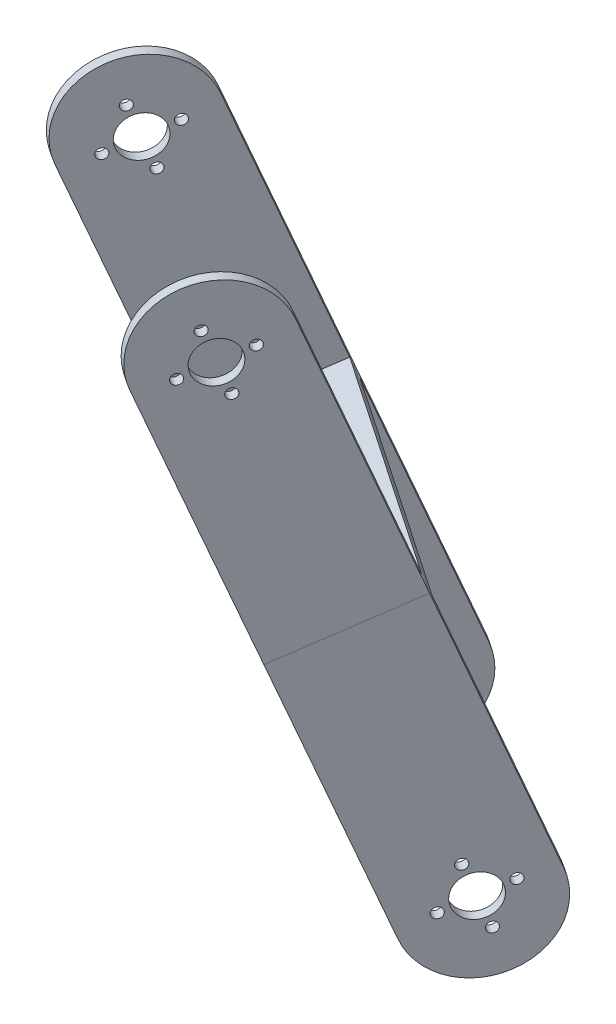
ISO-10303-21;
HEADER;
FILE_DESCRIPTION(('STEP AP214'),'2;1');
FILE_NAME('part.step','',(''),(''),'','','');
FILE_SCHEMA(('AUTOMOTIVE_DESIGN { 1 0 10303 214 1 1 1 1 }'));
ENDSEC;
DATA;
#1=APPLICATION_CONTEXT('core data for automotive mechanical design processes');
#2=APPLICATION_PROTOCOL_DEFINITION('international standard','automotive_design',2000,#1);
#3=PRODUCT_CONTEXT('',#1,'mechanical');
#4=PRODUCT('Part','Part','',(#3));
#5=PRODUCT_RELATED_PRODUCT_CATEGORY('part','',(#4));
#6=PRODUCT_DEFINITION_FORMATION('','',#4);
#7=PRODUCT_DEFINITION_CONTEXT('part definition',#1,'design');
#8=PRODUCT_DEFINITION('design','',#6,#7);
#9=PRODUCT_DEFINITION_SHAPE('','',#8);
#10=(LENGTH_UNIT() NAMED_UNIT(*) SI_UNIT(.MILLI.,.METRE.));
#11=(NAMED_UNIT(*) PLANE_ANGLE_UNIT() SI_UNIT($,.RADIAN.));
#12=(NAMED_UNIT(*) SI_UNIT($,.STERADIAN.) SOLID_ANGLE_UNIT());
#13=UNCERTAINTY_MEASURE_WITH_UNIT(LENGTH_MEASURE(1.E-05),#10,'distance_accuracy_value','');
#14=(GEOMETRIC_REPRESENTATION_CONTEXT(3) GLOBAL_UNCERTAINTY_ASSIGNED_CONTEXT((#13)) GLOBAL_UNIT_ASSIGNED_CONTEXT((#10,
#11,#12)) REPRESENTATION_CONTEXT('',''));
#15=CARTESIAN_POINT('',(0.,0.,0.));
#16=DIRECTION('',(0.,0.,1.));
#17=DIRECTION('',(1.,0.,0.));
#18=AXIS2_PLACEMENT_3D('',#15,#16,#17);
#19=CARTESIAN_POINT('',(-48.8229308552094,165.331227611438,122.221084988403));
#20=DIRECTION('',(-0.827451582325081,0.,-0.561537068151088));
#21=DIRECTION('',(-0.523988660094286,-0.359531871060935,0.772122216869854));
#22=AXIS2_PLACEMENT_3D('',#19,#20,#21);
#23=PLANE('',#22);
#24=CARTESIAN_POINT('',(-33.5921136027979,129.702196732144,99.7777512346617));
#25=DIRECTION('',(-0.827451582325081,0.,-0.561537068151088));
#26=DIRECTION('',(-0.523988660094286,-0.359531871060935,0.772122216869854));
#27=AXIS2_PLACEMENT_3D('',#24,#25,#26);
#28=CIRCLE('',#27,1.);
#29=CARTESIAN_POINT('',(-33.7940040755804,130.635329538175,100.075246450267));
#30=VERTEX_POINT('',#29);
#31=EDGE_CURVE('P0_E205',#30,#30,#28,.T.);
#32=ORIENTED_EDGE('',*,*,#31,.T.);
#33=EDGE_LOOP('',(#32));
#34=FACE_BOUND('',#33,.T.);
#35=CARTESIAN_POINT('',(-35.5263429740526,121.939625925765,102.627930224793));
#36=DIRECTION('',(-0.827451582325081,0.,-0.561537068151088));
#37=DIRECTION('',(-0.523988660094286,-0.359531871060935,0.772122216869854));
#38=AXIS2_PLACEMENT_3D('',#35,#36,#37);
#39=CIRCLE('',#38,1.);
#40=CARTESIAN_POINT('',(-35.728233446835,122.872758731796,102.925425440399));
#41=VERTEX_POINT('',#40);
#42=EDGE_CURVE('P0_E206',#41,#41,#39,.T.);
#43=ORIENTED_EDGE('',*,*,#42,.T.);
#44=EDGE_LOOP('',(#43));
#45=FACE_BOUND('',#44,.T.);
#46=CARTESIAN_POINT('',(-29.2331423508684,126.257670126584,93.3545997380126));
#47=DIRECTION('',(-0.827451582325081,0.,-0.561537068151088));
#48=DIRECTION('',(-0.523988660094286,-0.359531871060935,0.772122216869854));
#49=AXIS2_PLACEMENT_3D('',#46,#47,#48);
#50=CIRCLE('',#49,1.);
#51=CARTESIAN_POINT('',(-29.4350328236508,127.190802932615,93.6520949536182));
#52=VERTEX_POINT('',#51);
#53=EDGE_CURVE('P0_E209',#52,#52,#50,.T.);
#54=ORIENTED_EDGE('',*,*,#53,.T.);
#55=EDGE_LOOP('',(#54));
#56=FACE_BOUND('',#55,.T.);
#57=CARTESIAN_POINT('',(-31.167371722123,118.495099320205,96.2047787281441));
#58=DIRECTION('',(-0.827451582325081,0.,-0.561537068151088));
#59=DIRECTION('',(-0.523988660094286,-0.359531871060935,0.772122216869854));
#60=AXIS2_PLACEMENT_3D('',#57,#58,#59);
#61=CIRCLE('',#60,1.);
#62=CARTESIAN_POINT('',(-31.3692621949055,119.428232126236,96.5022739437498));
#63=VERTEX_POINT('',#62);
#64=EDGE_CURVE('P0_E212',#63,#63,#61,.T.);
#65=ORIENTED_EDGE('',*,*,#64,.T.);
#66=EDGE_LOOP('',(#65));
#67=FACE_BOUND('',#66,.T.);
#68=CARTESIAN_POINT('',(-32.3797426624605,124.098648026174,97.9912649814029));
#69=DIRECTION('',(-0.827451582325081,0.,-0.561537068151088));
#70=DIRECTION('',(-0.523988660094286,-0.359531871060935,0.772122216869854));
#71=AXIS2_PLACEMENT_3D('',#68,#69,#70);
#72=CIRCLE('',#71,4.);
#73=CARTESIAN_POINT('',(-34.4756973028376,122.660520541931,101.079753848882));
#74=VERTEX_POINT('',#73);
#75=EDGE_CURVE('P0_E151',#74,#74,#72,.T.);
#76=ORIENTED_EDGE('',*,*,#75,.T.);
#77=EDGE_LOOP('',(#76));
#78=FACE_BOUND('',#77,.T.);
#79=DIRECTION('',(-0.201890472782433,0.933132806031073,0.297495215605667));
#80=VECTOR('',#79,1.);
#81=CARTESIAN_POINT('',(-48.8229308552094,165.331227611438,122.221084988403));
#82=LINE('',#81,#80);
#83=CARTESIAN_POINT('',(-38.6267652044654,118.204800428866,107.196549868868));
#84=VERTEX_POINT('',#83);
#85=CARTESIAN_POINT('',(-48.8229308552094,165.331227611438,122.221084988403));
#86=VERTEX_POINT('',#85);
#87=EDGE_CURVE('P0_E120',#84,#86,#82,.T.);
#88=ORIENTED_EDGE('',*,*,#87,.F.);
#89=CARTESIAN_POINT('',(-32.0769069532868,122.698948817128,97.5450221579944));
#90=DIRECTION('',(-0.827451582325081,0.,-0.561537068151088));
#91=DIRECTION('',(-0.523988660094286,-0.359531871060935,0.772122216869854));
#92=AXIS2_PLACEMENT_3D('',#89,#90,#91);
#93=CIRCLE('',#92,12.5);
#94=CARTESIAN_POINT('',(-25.5270487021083,127.193097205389,87.8934944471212));
#95=VERTEX_POINT('',#94);
#96=EDGE_CURVE('P0_E95',#95,#84,#93,.T.);
#97=ORIENTED_EDGE('',*,*,#96,.F.);
#98=DIRECTION('',(-0.201890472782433,0.933132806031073,0.297495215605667));
#99=VECTOR('',#98,1.);
#100=CARTESIAN_POINT('',(-35.7232143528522,174.319524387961,102.918029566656));
#101=LINE('',#100,#99);
#102=CARTESIAN_POINT('',(-35.7232143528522,174.319524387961,102.918029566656));
#103=VERTEX_POINT('',#102);
#104=EDGE_CURVE('P0_E107',#95,#103,#101,.T.);
#105=ORIENTED_EDGE('',*,*,#104,.T.);
#106=DIRECTION('',(0.523988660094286,0.359531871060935,-0.772122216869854));
#107=VECTOR('',#106,1.);
#108=CARTESIAN_POINT('',(-48.8229308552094,165.331227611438,122.221084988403));
#109=LINE('',#108,#107);
#110=EDGE_CURVE('P0_E126',#86,#103,#109,.T.);
#111=ORIENTED_EDGE('',*,*,#110,.F.);
#112=EDGE_LOOP('',(#88,#97,#105,#111));
#113=FACE_BOUND('',#112,.T.);
#114=ADVANCED_FACE('P0_F17',(#34,#45,#56,#67,#78,#113),#23,.F.);
#115=CARTESIAN_POINT('',(-4.96799699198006,165.331227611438,151.98254960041));
#116=DIRECTION('',(0.827451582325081,0.,0.561537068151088));
#117=DIRECTION('',(-0.201890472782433,0.933132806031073,0.297495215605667));
#118=AXIS2_PLACEMENT_3D('',#115,#116,#117);
#119=PLANE('',#118);
#120=CARTESIAN_POINT('',(10.2628202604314,129.702196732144,129.539215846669));
#121=DIRECTION('',(0.827451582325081,0.,0.561537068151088));
#122=DIRECTION('',(-0.201890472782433,0.933132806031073,0.297495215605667));
#123=AXIS2_PLACEMENT_3D('',#120,#121,#122);
#124=CIRCLE('',#123,1.);
#125=CARTESIAN_POINT('',(10.0609297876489,130.635329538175,129.836711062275));
#126=VERTEX_POINT('',#125);
#127=EDGE_CURVE('P0_E704',#126,#126,#124,.T.);
#128=ORIENTED_EDGE('',*,*,#127,.T.);
#129=EDGE_LOOP('',(#128));
#130=FACE_BOUND('',#129,.T.);
#131=CARTESIAN_POINT('',(8.3285908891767,121.939625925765,132.389394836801));
#132=DIRECTION('',(0.827451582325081,0.,0.561537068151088));
#133=DIRECTION('',(-0.201890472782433,0.933132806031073,0.297495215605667));
#134=AXIS2_PLACEMENT_3D('',#131,#132,#133);
#135=CIRCLE('',#134,1.);
#136=CARTESIAN_POINT('',(8.12670041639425,122.872758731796,132.686890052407));
#137=VERTEX_POINT('',#136);
#138=EDGE_CURVE('P0_E712',#137,#137,#135,.T.);
#139=ORIENTED_EDGE('',*,*,#138,.T.);
#140=EDGE_LOOP('',(#139));
#141=FACE_BOUND('',#140,.T.);
#142=CARTESIAN_POINT('',(14.6217915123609,126.257670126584,123.11606435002));
#143=DIRECTION('',(0.827451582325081,0.,0.561537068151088));
#144=DIRECTION('',(-0.201890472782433,0.933132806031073,0.297495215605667));
#145=AXIS2_PLACEMENT_3D('',#142,#143,#144);
#146=CIRCLE('',#145,1.);
#147=CARTESIAN_POINT('',(14.4199010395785,127.190802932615,123.413559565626));
#148=VERTEX_POINT('',#147);
#149=EDGE_CURVE('P0_E270',#148,#148,#146,.T.);
#150=ORIENTED_EDGE('',*,*,#149,.T.);
#151=EDGE_LOOP('',(#150));
#152=FACE_BOUND('',#151,.T.);
#153=CARTESIAN_POINT('',(12.6875621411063,118.495099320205,125.966243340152));
#154=DIRECTION('',(0.827451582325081,0.,0.561537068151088));
#155=DIRECTION('',(-0.201890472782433,0.933132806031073,0.297495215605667));
#156=AXIS2_PLACEMENT_3D('',#153,#154,#155);
#157=CIRCLE('',#156,1.);
#158=CARTESIAN_POINT('',(12.4856716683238,119.428232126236,126.263738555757));
#159=VERTEX_POINT('',#158);
#160=EDGE_CURVE('P0_E264',#159,#159,#157,.T.);
#161=ORIENTED_EDGE('',*,*,#160,.T.);
#162=EDGE_LOOP('',(#161));
#163=FACE_BOUND('',#162,.T.);
#164=CARTESIAN_POINT('',(11.4751912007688,124.098648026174,127.752729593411));
#165=DIRECTION('',(0.827451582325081,0.,0.561537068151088));
#166=DIRECTION('',(-0.201890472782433,0.933132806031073,0.297495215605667));
#167=AXIS2_PLACEMENT_3D('',#164,#165,#166);
#168=CIRCLE('',#167,4.);
#169=CARTESIAN_POINT('',(10.6676293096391,127.831179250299,128.942710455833));
#170=VERTEX_POINT('',#169);
#171=EDGE_CURVE('P0_E150',#170,#170,#168,.T.);
#172=ORIENTED_EDGE('',*,*,#171,.T.);
#173=EDGE_LOOP('',(#172));
#174=FACE_BOUND('',#173,.T.);
#175=CARTESIAN_POINT('',(11.7780269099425,122.698948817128,127.306486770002));
#176=DIRECTION('',(0.827451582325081,0.,0.561537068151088));
#177=DIRECTION('',(-0.201890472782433,0.933132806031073,0.297495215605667));
#178=AXIS2_PLACEMENT_3D('',#175,#176,#177);
#179=CIRCLE('',#178,12.5);
#180=CARTESIAN_POINT('',(5.22816865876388,118.204800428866,136.958014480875));
#181=VERTEX_POINT('',#180);
#182=CARTESIAN_POINT('',(18.327885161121,127.193097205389,117.654959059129));
#183=VERTEX_POINT('',#182);
#184=EDGE_CURVE('P0_E33',#181,#183,#179,.T.);
#185=ORIENTED_EDGE('',*,*,#184,.F.);
#186=DIRECTION('',(0.201890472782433,-0.933132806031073,-0.297495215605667));
#187=VECTOR('',#186,1.);
#188=CARTESIAN_POINT('',(-4.96799699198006,165.331227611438,151.98254960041));
#189=LINE('',#188,#187);
#190=CARTESIAN_POINT('',(-4.96799699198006,165.331227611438,151.98254960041));
#191=VERTEX_POINT('',#190);
#192=EDGE_CURVE('P0_E165',#191,#181,#189,.T.);
#193=ORIENTED_EDGE('',*,*,#192,.F.);
#194=DIRECTION('',(0.523988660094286,0.359531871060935,-0.772122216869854));
#195=VECTOR('',#194,1.);
#196=CARTESIAN_POINT('',(-4.96799699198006,165.331227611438,151.98254960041));
#197=LINE('',#196,#195);
#198=CARTESIAN_POINT('',(8.13171951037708,174.319524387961,132.679494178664));
#199=VERTEX_POINT('',#198);
#200=EDGE_CURVE('P0_E122',#191,#199,#197,.T.);
#201=ORIENTED_EDGE('',*,*,#200,.T.);
#202=DIRECTION('',(0.201890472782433,-0.933132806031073,-0.297495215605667));
#203=VECTOR('',#202,1.);
#204=CARTESIAN_POINT('',(8.13171951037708,174.319524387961,132.679494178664));
#205=LINE('',#204,#203);
#206=EDGE_CURVE('P0_E114',#199,#183,#205,.T.);
#207=ORIENTED_EDGE('',*,*,#206,.T.);
#208=EDGE_LOOP('',(#185,#193,#201,#207));
#209=FACE_BOUND('',#208,.T.);
#210=ADVANCED_FACE('P0_F174',(#130,#141,#152,#163,#174,#209),#119,.F.);
#211=CARTESIAN_POINT('',(-3.71617799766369,167.194272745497,153.699587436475));
#212=DIRECTION('',(-0.827451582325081,0.,-0.561537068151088));
#213=DIRECTION('',(0.201890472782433,-0.933132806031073,-0.297495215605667));
#214=AXIS2_PLACEMENT_3D('',#211,#212,#213);
#215=PLANE('',#214);
#216=CARTESIAN_POINT('',(11.9177234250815,129.702196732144,130.662289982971));
#217=DIRECTION('',(0.827451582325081,0.,0.561537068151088));
#218=DIRECTION('',(-0.201890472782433,0.933132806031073,0.297495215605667));
#219=AXIS2_PLACEMENT_3D('',#216,#217,#218);
#220=CIRCLE('',#219,1.);
#221=CARTESIAN_POINT('',(11.7158329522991,130.635329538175,130.959785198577));
#222=VERTEX_POINT('',#221);
#223=EDGE_CURVE('P0_E243',#222,#222,#220,.T.);
#224=ORIENTED_EDGE('',*,*,#223,.F.);
#225=EDGE_LOOP('',(#224));
#226=FACE_BOUND('',#225,.T.);
#227=CARTESIAN_POINT('',(9.98349405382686,121.939625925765,133.512468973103));
#228=DIRECTION('',(0.827451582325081,0.,0.561537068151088));
#229=DIRECTION('',(-0.201890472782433,0.933132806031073,0.297495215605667));
#230=AXIS2_PLACEMENT_3D('',#227,#228,#229);
#231=CIRCLE('',#230,1.);
#232=CARTESIAN_POINT('',(9.78160358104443,122.872758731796,133.809964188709));
#233=VERTEX_POINT('',#232);
#234=EDGE_CURVE('P0_E248',#233,#233,#231,.T.);
#235=ORIENTED_EDGE('',*,*,#234,.F.);
#236=EDGE_LOOP('',(#235));
#237=FACE_BOUND('',#236,.T.);
#238=CARTESIAN_POINT('',(16.2766946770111,126.257670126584,124.239138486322));
#239=DIRECTION('',(0.827451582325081,0.,0.561537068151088));
#240=DIRECTION('',(-0.201890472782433,0.933132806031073,0.297495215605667));
#241=AXIS2_PLACEMENT_3D('',#238,#239,#240);
#242=CIRCLE('',#241,1.);
#243=CARTESIAN_POINT('',(16.0748042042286,127.190802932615,124.536633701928));
#244=VERTEX_POINT('',#243);
#245=EDGE_CURVE('P0_E252',#244,#244,#242,.T.);
#246=ORIENTED_EDGE('',*,*,#245,.F.);
#247=EDGE_LOOP('',(#246));
#248=FACE_BOUND('',#247,.T.);
#249=CARTESIAN_POINT('',(14.3424653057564,118.495099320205,127.089317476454));
#250=DIRECTION('',(0.827451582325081,0.,0.561537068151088));
#251=DIRECTION('',(-0.201890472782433,0.933132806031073,0.297495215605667));
#252=AXIS2_PLACEMENT_3D('',#249,#250,#251);
#253=CIRCLE('',#252,1.);
#254=CARTESIAN_POINT('',(14.140574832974,119.428232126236,127.38681269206));
#255=VERTEX_POINT('',#254);
#256=EDGE_CURVE('P0_E258',#255,#255,#253,.T.);
#257=ORIENTED_EDGE('',*,*,#256,.F.);
#258=EDGE_LOOP('',(#257));
#259=FACE_BOUND('',#258,.T.);
#260=CARTESIAN_POINT('',(13.130094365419,124.098648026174,128.875803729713));
#261=DIRECTION('',(-0.827451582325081,0.,-0.561537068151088));
#262=DIRECTION('',(0.201890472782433,-0.933132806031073,-0.297495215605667));
#263=AXIS2_PLACEMENT_3D('',#260,#261,#262);
#264=CIRCLE('',#263,4.);
#265=CARTESIAN_POINT('',(13.9376562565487,120.36611680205,127.68582286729));
#266=VERTEX_POINT('',#265);
#267=EDGE_CURVE('P0_E139',#266,#266,#264,.T.);
#268=ORIENTED_EDGE('',*,*,#267,.T.);
#269=EDGE_LOOP('',(#268));
#270=FACE_BOUND('',#269,.T.);
#271=DIRECTION('',(-0.201890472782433,0.933132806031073,0.297495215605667));
#272=VECTOR('',#271,1.);
#273=CARTESIAN_POINT('',(-3.71617799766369,167.194272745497,153.699587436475));
#274=LINE('',#273,#272);
#275=CARTESIAN_POINT('',(6.88307182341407,118.204800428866,138.081088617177));
#276=VERTEX_POINT('',#275);
#277=CARTESIAN_POINT('',(-3.71617799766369,167.194272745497,153.699587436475));
#278=VERTEX_POINT('',#277);
#279=EDGE_CURVE('P0_E102',#276,#278,#274,.T.);
#280=ORIENTED_EDGE('',*,*,#279,.F.);
#281=CARTESIAN_POINT('',(13.4329300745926,122.698948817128,128.429560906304));
#282=DIRECTION('',(-0.827451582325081,0.,-0.561537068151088));
#283=DIRECTION('',(0.201890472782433,-0.933132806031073,-0.297495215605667));
#284=AXIS2_PLACEMENT_3D('',#281,#282,#283);
#285=CIRCLE('',#284,12.5);
#286=CARTESIAN_POINT('',(19.9827883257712,127.193097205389,118.778033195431));
#287=VERTEX_POINT('',#286);
#288=EDGE_CURVE('P0_E88',#287,#276,#285,.T.);
#289=ORIENTED_EDGE('',*,*,#288,.F.);
#290=DIRECTION('',(-0.201890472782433,0.933132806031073,0.297495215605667));
#291=VECTOR('',#290,1.);
#292=CARTESIAN_POINT('',(9.38353850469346,176.182569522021,134.396532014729));
#293=LINE('',#292,#291);
#294=CARTESIAN_POINT('',(9.38353850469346,176.182569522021,134.396532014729));
#295=VERTEX_POINT('',#294);
#296=EDGE_CURVE('P0_E116',#287,#295,#293,.T.);
#297=ORIENTED_EDGE('',*,*,#296,.T.);
#298=DIRECTION('',(0.523988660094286,0.359531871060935,-0.772122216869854));
#299=VECTOR('',#298,1.);
#300=CARTESIAN_POINT('',(-3.71617799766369,167.194272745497,153.699587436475));
#301=LINE('',#300,#299);
#302=EDGE_CURVE('P0_E105',#278,#295,#301,.T.);
#303=ORIENTED_EDGE('',*,*,#302,.F.);
#304=EDGE_LOOP('',(#280,#289,#297,#303));
#305=FACE_BOUND('',#304,.T.);
#306=ADVANCED_FACE('P0_F169',(#226,#237,#248,#259,#270,#305),#215,.F.);
#307=CARTESIAN_POINT('',(-50.8809181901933,167.194272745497,121.691974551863));
#308=DIRECTION('',(0.827451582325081,0.,0.561537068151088));
#309=DIRECTION('',(-0.201890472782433,0.933132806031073,0.297495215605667));
#310=AXIS2_PLACEMENT_3D('',#307,#308,#309);
#311=PLANE('',#310);
#312=CARTESIAN_POINT('',(-35.2470167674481,129.702196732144,98.6546770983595));
#313=DIRECTION('',(0.827451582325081,0.,0.561537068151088));
#314=DIRECTION('',(-0.201890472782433,0.933132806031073,0.297495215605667));
#315=AXIS2_PLACEMENT_3D('',#312,#313,#314);
#316=CIRCLE('',#315,1.);
#317=CARTESIAN_POINT('',(-35.4489072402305,130.635329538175,98.9521723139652));
#318=VERTEX_POINT('',#317);
#319=EDGE_CURVE('P0_E705',#318,#318,#316,.T.);
#320=ORIENTED_EDGE('',*,*,#319,.T.);
#321=EDGE_LOOP('',(#320));
#322=FACE_BOUND('',#321,.T.);
#323=CARTESIAN_POINT('',(-37.1812461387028,121.939625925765,101.504856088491));
#324=DIRECTION('',(0.827451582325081,0.,0.561537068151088));
#325=DIRECTION('',(-0.201890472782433,0.933132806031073,0.297495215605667));
#326=AXIS2_PLACEMENT_3D('',#323,#324,#325);
#327=CIRCLE('',#326,1.);
#328=CARTESIAN_POINT('',(-37.3831366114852,122.872758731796,101.802351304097));
#329=VERTEX_POINT('',#328);
#330=EDGE_CURVE('P0_E709',#329,#329,#327,.T.);
#331=ORIENTED_EDGE('',*,*,#330,.T.);
#332=EDGE_LOOP('',(#331));
#333=FACE_BOUND('',#332,.T.);
#334=CARTESIAN_POINT('',(-30.8880455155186,126.257670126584,92.2315256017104));
#335=DIRECTION('',(0.827451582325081,0.,0.561537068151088));
#336=DIRECTION('',(-0.201890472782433,0.933132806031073,0.297495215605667));
#337=AXIS2_PLACEMENT_3D('',#334,#335,#336);
#338=CIRCLE('',#337,1.);
#339=CARTESIAN_POINT('',(-31.089935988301,127.190802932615,92.529020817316));
#340=VERTEX_POINT('',#339);
#341=EDGE_CURVE('P0_E719',#340,#340,#338,.T.);
#342=ORIENTED_EDGE('',*,*,#341,.T.);
#343=EDGE_LOOP('',(#342));
#344=FACE_BOUND('',#343,.T.);
#345=CARTESIAN_POINT('',(-32.8222748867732,118.495099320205,95.0817045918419));
#346=DIRECTION('',(0.827451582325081,0.,0.561537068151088));
#347=DIRECTION('',(-0.201890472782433,0.933132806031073,0.297495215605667));
#348=AXIS2_PLACEMENT_3D('',#345,#346,#347);
#349=CIRCLE('',#348,1.);
#350=CARTESIAN_POINT('',(-33.0241653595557,119.428232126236,95.3791998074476));
#351=VERTEX_POINT('',#350);
#352=EDGE_CURVE('P0_E265',#351,#351,#349,.T.);
#353=ORIENTED_EDGE('',*,*,#352,.T.);
#354=EDGE_LOOP('',(#353));
#355=FACE_BOUND('',#354,.T.);
#356=CARTESIAN_POINT('',(-34.0346458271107,124.098648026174,96.8681908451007));
#357=DIRECTION('',(-0.827451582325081,0.,-0.561537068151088));
#358=DIRECTION('',(0.201890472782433,-0.933132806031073,-0.297495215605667));
#359=AXIS2_PLACEMENT_3D('',#356,#357,#358);
#360=CIRCLE('',#359,4.);
#361=CARTESIAN_POINT('',(-33.2270839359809,120.36611680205,95.6782099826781));
#362=VERTEX_POINT('',#361);
#363=EDGE_CURVE('P0_E140',#362,#362,#360,.T.);
#364=ORIENTED_EDGE('',*,*,#363,.F.);
#365=EDGE_LOOP('',(#364));
#366=FACE_BOUND('',#365,.T.);
#367=CARTESIAN_POINT('',(-33.731810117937,122.698948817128,96.4219480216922));
#368=DIRECTION('',(-0.827451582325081,0.,-0.561537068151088));
#369=DIRECTION('',(0.201890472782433,-0.933132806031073,-0.297495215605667));
#370=AXIS2_PLACEMENT_3D('',#367,#368,#369);
#371=CIRCLE('',#370,12.5);
#372=CARTESIAN_POINT('',(-27.1819518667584,127.193097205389,86.770420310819));
#373=VERTEX_POINT('',#372);
#374=CARTESIAN_POINT('',(-40.2816683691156,118.204800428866,106.073475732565));
#375=VERTEX_POINT('',#374);
#376=EDGE_CURVE('P0_E36',#373,#375,#371,.T.);
#377=ORIENTED_EDGE('',*,*,#376,.T.);
#378=DIRECTION('',(0.201890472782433,-0.933132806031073,-0.297495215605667));
#379=VECTOR('',#378,1.);
#380=CARTESIAN_POINT('',(-50.8809181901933,167.194272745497,121.691974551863));
#381=LINE('',#380,#379);
#382=CARTESIAN_POINT('',(-50.8809181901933,167.194272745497,121.691974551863));
#383=VERTEX_POINT('',#382);
#384=EDGE_CURVE('P0_E83',#383,#375,#381,.T.);
#385=ORIENTED_EDGE('',*,*,#384,.F.);
#386=DIRECTION('',(0.523988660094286,0.359531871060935,-0.772122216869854));
#387=VECTOR('',#386,1.);
#388=CARTESIAN_POINT('',(-50.8809181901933,167.194272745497,121.691974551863));
#389=LINE('',#388,#387);
#390=CARTESIAN_POINT('',(-37.7812016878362,176.182569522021,102.388919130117));
#391=VERTEX_POINT('',#390);
#392=EDGE_CURVE('P0_E99',#383,#391,#389,.T.);
#393=ORIENTED_EDGE('',*,*,#392,.T.);
#394=DIRECTION('',(0.201890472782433,-0.933132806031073,-0.297495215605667));
#395=VECTOR('',#394,1.);
#396=CARTESIAN_POINT('',(-37.7812016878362,176.182569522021,102.388919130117));
#397=LINE('',#396,#395);
#398=EDGE_CURVE('P0_E84',#391,#373,#397,.T.);
#399=ORIENTED_EDGE('',*,*,#398,.T.);
#400=EDGE_LOOP('',(#377,#385,#393,#399));
#401=FACE_BOUND('',#400,.T.);
#402=ADVANCED_FACE('P0_F79',(#322,#333,#344,#355,#366,#401),#311,.F.);
#403=CARTESIAN_POINT('',(-48.8229308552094,165.331227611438,122.221084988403));
#404=DIRECTION('',(-0.201890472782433,0.933132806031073,0.297495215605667));
#405=DIRECTION('',(-0.523988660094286,-0.359531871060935,0.772122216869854));
#406=AXIS2_PLACEMENT_3D('',#403,#404,#405);
#407=PLANE('',#406);
#408=CARTESIAN_POINT('',(-26.5514928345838,169.825376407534,123.23876009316));
#409=DIRECTION('',(-0.201890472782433,0.933132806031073,0.297495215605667));
#410=DIRECTION('',(-0.523988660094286,-0.359531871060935,0.772122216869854));
#411=AXIS2_PLACEMENT_3D('',#408,#409,#410);
#412=CIRCLE('',#411,1.);
#413=CARTESIAN_POINT('',(-27.0754814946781,169.465844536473,124.01088231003));
#414=VERTEX_POINT('',#413);
#415=EDGE_CURVE('P0_E679',#414,#414,#412,.T.);
#416=ORIENTED_EDGE('',*,*,#415,.T.);
#417=EDGE_LOOP('',(#416));
#418=FACE_BOUND('',#417,.T.);
#419=CARTESIAN_POINT('',(-24.730715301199,167.668185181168,131.240715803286));
#420=DIRECTION('',(-0.201890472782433,0.933132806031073,0.297495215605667));
#421=DIRECTION('',(-0.523988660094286,-0.359531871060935,0.772122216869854));
#422=AXIS2_PLACEMENT_3D('',#419,#420,#421);
#423=CIRCLE('',#422,1.);
#424=CARTESIAN_POINT('',(-25.2547039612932,167.308653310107,132.012838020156));
#425=VERTEX_POINT('',#424);
#426=EDGE_CURVE('P0_E683',#425,#425,#423,.T.);
#427=ORIENTED_EDGE('',*,*,#426,.T.);
#428=EDGE_LOOP('',(#427));
#429=FACE_BOUND('',#428,.T.);
#430=CARTESIAN_POINT('',(-16.6220738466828,169.825376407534,129.977204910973));
#431=DIRECTION('',(-0.201890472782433,0.933132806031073,0.297495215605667));
#432=DIRECTION('',(-0.523988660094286,-0.359531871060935,0.772122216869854));
#433=AXIS2_PLACEMENT_3D('',#430,#431,#432);
#434=CIRCLE('',#433,0.999999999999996);
#435=CARTESIAN_POINT('',(-17.146062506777,169.465844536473,130.749327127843));
#436=VERTEX_POINT('',#435);
#437=EDGE_CURVE('P0_E691',#436,#436,#434,.T.);
#438=ORIENTED_EDGE('',*,*,#437,.T.);
#439=EDGE_LOOP('',(#438));
#440=FACE_BOUND('',#439,.T.);
#441=CARTESIAN_POINT('',(-18.4428513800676,171.9825676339,121.975249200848));
#442=DIRECTION('',(-0.201890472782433,0.933132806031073,0.297495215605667));
#443=DIRECTION('',(-0.523988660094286,-0.359531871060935,0.772122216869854));
#444=AXIS2_PLACEMENT_3D('',#441,#442,#443);
#445=CIRCLE('',#444,0.999999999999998);
#446=CARTESIAN_POINT('',(-18.9668400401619,171.623035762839,122.747371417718));
#447=VERTEX_POINT('',#446);
#448=EDGE_CURVE('P0_E699',#447,#447,#445,.T.);
#449=ORIENTED_EDGE('',*,*,#448,.T.);
#450=EDGE_LOOP('',(#449));
#451=FACE_BOUND('',#450,.T.);
#452=CARTESIAN_POINT('',(-21.5867830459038,169.8253759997,126.607983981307));
#453=DIRECTION('',(-0.201890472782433,0.933132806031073,0.297495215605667));
#454=DIRECTION('',(-0.523988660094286,-0.359531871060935,0.772122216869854));
#455=AXIS2_PLACEMENT_3D('',#452,#453,#454);
#456=CIRCLE('',#455,4.00000000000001);
#457=CARTESIAN_POINT('',(-23.6827376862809,168.387248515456,129.696472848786));
#458=VERTEX_POINT('',#457);
#459=EDGE_CURVE('P0_E112',#458,#458,#456,.T.);
#460=ORIENTED_EDGE('',*,*,#459,.T.);
#461=EDGE_LOOP('',(#460));
#462=FACE_BOUND('',#461,.T.);
#463=DIRECTION('',(0.827451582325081,0.,0.561537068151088));
#464=VECTOR('',#463,1.);
#465=CARTESIAN_POINT('',(-35.7232143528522,174.319524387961,102.918029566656));
#466=LINE('',#465,#464);
#467=EDGE_CURVE('P0_E109',#103,#199,#466,.T.);
#468=ORIENTED_EDGE('',*,*,#467,.T.);
#469=ORIENTED_EDGE('',*,*,#200,.F.);
#470=DIRECTION('',(0.827451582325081,0.,0.561537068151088));
#471=VECTOR('',#470,1.);
#472=CARTESIAN_POINT('',(-48.8229308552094,165.331227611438,122.221084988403));
#473=LINE('',#472,#471);
#474=EDGE_CURVE('P0_E159',#86,#191,#473,.T.);
#475=ORIENTED_EDGE('',*,*,#474,.F.);
#476=ORIENTED_EDGE('',*,*,#110,.T.);
#477=EDGE_LOOP('',(#468,#469,#475,#476));
#478=FACE_BOUND('',#477,.T.);
#479=ADVANCED_FACE('P0_F178',(#418,#429,#440,#451,#462,#478),#407,.F.);
#480=CARTESIAN_POINT('',(-50.8809181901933,167.194272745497,121.691974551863));
#481=DIRECTION('',(0.201890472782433,-0.933132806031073,-0.297495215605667));
#482=DIRECTION('',(0.523988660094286,0.359531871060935,-0.772122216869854));
#483=AXIS2_PLACEMENT_3D('',#480,#481,#482);
#484=PLANE('',#483);
#485=CARTESIAN_POINT('',(-26.9545770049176,171.688421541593,123.832723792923));
#486=DIRECTION('',(-0.201890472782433,0.933132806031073,0.297495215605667));
#487=DIRECTION('',(-0.523988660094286,-0.359531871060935,0.772122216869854));
#488=AXIS2_PLACEMENT_3D('',#485,#486,#487);
#489=CIRCLE('',#488,1.);
#490=CARTESIAN_POINT('',(-27.4785656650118,171.328889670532,124.604846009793));
#491=VERTEX_POINT('',#490);
#492=EDGE_CURVE('P0_E678',#491,#491,#489,.T.);
#493=ORIENTED_EDGE('',*,*,#492,.F.);
#494=EDGE_LOOP('',(#493));
#495=FACE_BOUND('',#494,.T.);
#496=CARTESIAN_POINT('',(-25.1337994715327,169.531230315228,131.834679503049));
#497=DIRECTION('',(-0.201890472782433,0.933132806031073,0.297495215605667));
#498=DIRECTION('',(-0.523988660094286,-0.359531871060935,0.772122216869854));
#499=AXIS2_PLACEMENT_3D('',#496,#497,#498);
#500=CIRCLE('',#499,1.);
#501=CARTESIAN_POINT('',(-25.657788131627,169.171698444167,132.606801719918));
#502=VERTEX_POINT('',#501);
#503=EDGE_CURVE('P0_E681',#502,#502,#500,.T.);
#504=ORIENTED_EDGE('',*,*,#503,.F.);
#505=EDGE_LOOP('',(#504));
#506=FACE_BOUND('',#505,.T.);
#507=CARTESIAN_POINT('',(-17.0251580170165,171.688421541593,130.571168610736));
#508=DIRECTION('',(-0.201890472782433,0.933132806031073,0.297495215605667));
#509=DIRECTION('',(-0.523988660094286,-0.359531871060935,0.772122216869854));
#510=AXIS2_PLACEMENT_3D('',#507,#508,#509);
#511=CIRCLE('',#510,0.999999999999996);
#512=CARTESIAN_POINT('',(-17.5491466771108,171.328889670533,131.343290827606));
#513=VERTEX_POINT('',#512);
#514=EDGE_CURVE('P0_E689',#513,#513,#511,.T.);
#515=ORIENTED_EDGE('',*,*,#514,.F.);
#516=EDGE_LOOP('',(#515));
#517=FACE_BOUND('',#516,.T.);
#518=CARTESIAN_POINT('',(-18.8459355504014,173.845612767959,122.56921290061));
#519=DIRECTION('',(-0.201890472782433,0.933132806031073,0.297495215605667));
#520=DIRECTION('',(-0.523988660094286,-0.359531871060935,0.772122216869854));
#521=AXIS2_PLACEMENT_3D('',#518,#519,#520);
#522=CIRCLE('',#521,0.999999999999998);
#523=CARTESIAN_POINT('',(-19.3699242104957,173.486080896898,123.34133511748));
#524=VERTEX_POINT('',#523);
#525=EDGE_CURVE('P0_E698',#524,#524,#522,.T.);
#526=ORIENTED_EDGE('',*,*,#525,.F.);
#527=EDGE_LOOP('',(#526));
#528=FACE_BOUND('',#527,.T.);
#529=CARTESIAN_POINT('',(-21.9898672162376,171.688421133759,127.201947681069));
#530=DIRECTION('',(-0.201890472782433,0.933132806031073,0.297495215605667));
#531=DIRECTION('',(-0.523988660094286,-0.359531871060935,0.772122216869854));
#532=AXIS2_PLACEMENT_3D('',#529,#530,#531);
#533=CIRCLE('',#532,4.00000000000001);
#534=CARTESIAN_POINT('',(-24.0858218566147,170.250293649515,130.290436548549));
#535=VERTEX_POINT('',#534);
#536=EDGE_CURVE('P0_E152',#535,#535,#533,.T.);
#537=ORIENTED_EDGE('',*,*,#536,.F.);
#538=EDGE_LOOP('',(#537));
#539=FACE_BOUND('',#538,.T.);
#540=DIRECTION('',(-0.827451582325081,0.,-0.561537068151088));
#541=VECTOR('',#540,1.);
#542=CARTESIAN_POINT('',(-37.7812016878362,176.182569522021,102.388919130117));
#543=LINE('',#542,#541);
#544=EDGE_CURVE('P0_E119',#295,#391,#543,.T.);
#545=ORIENTED_EDGE('',*,*,#544,.T.);
#546=ORIENTED_EDGE('',*,*,#392,.F.);
#547=DIRECTION('',(-0.827451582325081,0.,-0.561537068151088));
#548=VECTOR('',#547,1.);
#549=CARTESIAN_POINT('',(-5.46826042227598,167.194272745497,152.510564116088));
#550=LINE('',#549,#548);
#551=EDGE_CURVE('P0_E98',#278,#383,#550,.T.);
#552=ORIENTED_EDGE('',*,*,#551,.F.);
#553=ORIENTED_EDGE('',*,*,#302,.T.);
#554=EDGE_LOOP('',(#545,#546,#552,#553));
#555=FACE_BOUND('',#554,.T.);
#556=ADVANCED_FACE('P0_F168',(#495,#506,#517,#528,#539,#555),#484,.F.);
#557=CARTESIAN_POINT('',(26.0715880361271,124.842638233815,154.193925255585));
#558=DIRECTION('',(-0.523988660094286,-0.359531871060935,0.772122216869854));
#559=DIRECTION('',(0.827451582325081,0.,0.561537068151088));
#560=AXIS2_PLACEMENT_3D('',#557,#558,#559);
#561=PLANE('',#560);
#562=DIRECTION('',(-0.827451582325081,0.,-0.561537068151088));
#563=VECTOR('',#562,1.);
#564=CARTESIAN_POINT('',(6.88307182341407,118.204800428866,138.081088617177));
#565=LINE('',#564,#563);
#566=EDGE_CURVE('P0_E87',#276,#181,#565,.T.);
#567=ORIENTED_EDGE('',*,*,#566,.F.);
#568=ORIENTED_EDGE('',*,*,#279,.T.);
#569=ORIENTED_EDGE('',*,*,#551,.T.);
#570=ORIENTED_EDGE('',*,*,#384,.T.);
#571=DIRECTION('',(-0.827451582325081,0.,-0.561537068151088));
#572=VECTOR('',#571,1.);
#573=CARTESIAN_POINT('',(6.88307182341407,118.204800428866,138.081088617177));
#574=LINE('',#573,#572);
#575=EDGE_CURVE('P0_E11',#84,#375,#574,.T.);
#576=ORIENTED_EDGE('',*,*,#575,.F.);
#577=ORIENTED_EDGE('',*,*,#87,.T.);
#578=ORIENTED_EDGE('',*,*,#474,.T.);
#579=ORIENTED_EDGE('',*,*,#192,.T.);
#580=EDGE_LOOP('',(#567,#568,#569,#570,#576,#577,#578,#579));
#581=FACE_BOUND('',#580,.T.);
#582=ADVANCED_FACE('P0_F96',(#581),#561,.T.);
#583=CARTESIAN_POINT('',(39.1713045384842,133.830935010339,134.890869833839));
#584=DIRECTION('',(-0.523988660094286,-0.359531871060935,0.772122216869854));
#585=DIRECTION('',(0.827451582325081,0.,0.561537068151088));
#586=AXIS2_PLACEMENT_3D('',#583,#584,#585);
#587=PLANE('',#586);
#588=ORIENTED_EDGE('',*,*,#296,.F.);
#589=DIRECTION('',(-0.827451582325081,0.,-0.561537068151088));
#590=VECTOR('',#589,1.);
#591=CARTESIAN_POINT('',(19.9827883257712,127.193097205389,118.778033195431));
#592=LINE('',#591,#590);
#593=EDGE_CURVE('P0_E142',#287,#183,#592,.T.);
#594=ORIENTED_EDGE('',*,*,#593,.T.);
#595=ORIENTED_EDGE('',*,*,#206,.F.);
#596=ORIENTED_EDGE('',*,*,#467,.F.);
#597=ORIENTED_EDGE('',*,*,#104,.F.);
#598=DIRECTION('',(-0.827451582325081,0.,-0.561537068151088));
#599=VECTOR('',#598,1.);
#600=CARTESIAN_POINT('',(19.9827883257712,127.193097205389,118.778033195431));
#601=LINE('',#600,#599);
#602=EDGE_CURVE('P0_E24',#95,#373,#601,.T.);
#603=ORIENTED_EDGE('',*,*,#602,.T.);
#604=ORIENTED_EDGE('',*,*,#398,.F.);
#605=ORIENTED_EDGE('',*,*,#544,.F.);
#606=EDGE_LOOP('',(#588,#594,#595,#596,#597,#603,#604,#605));
#607=FACE_BOUND('',#606,.T.);
#608=ADVANCED_FACE('P0_F135',(#607),#587,.F.);
#609=CARTESIAN_POINT('',(-8.86698648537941,111.034788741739,107.864758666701));
#610=DIRECTION('',(-0.201890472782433,0.933132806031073,0.297495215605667));
#611=DIRECTION('',(-0.523988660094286,-0.359531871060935,0.772122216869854));
#612=AXIS2_PLACEMENT_3D('',#609,#610,#611);
#613=CYLINDRICAL_SURFACE('',#612,4.00000000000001);
#614=ORIENTED_EDGE('',*,*,#536,.T.);
#615=EDGE_LOOP('',(#614));
#616=FACE_BOUND('',#615,.T.);
#617=ORIENTED_EDGE('',*,*,#459,.F.);
#618=EDGE_LOOP('',(#617));
#619=FACE_BOUND('',#618,.T.);
#620=ADVANCED_FACE('P0_F219',(#616,#619),#613,.F.);
#621=CARTESIAN_POINT('',(13.130094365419,124.098648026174,128.875803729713));
#622=DIRECTION('',(-0.827451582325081,0.,-0.561537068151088));
#623=DIRECTION('',(0.201890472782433,-0.933132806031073,-0.297495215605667));
#624=AXIS2_PLACEMENT_3D('',#621,#622,#623);
#625=CYLINDRICAL_SURFACE('',#624,4.);
#626=ORIENTED_EDGE('',*,*,#363,.T.);
#627=EDGE_LOOP('',(#626));
#628=FACE_BOUND('',#627,.T.);
#629=ORIENTED_EDGE('',*,*,#75,.F.);
#630=EDGE_LOOP('',(#629));
#631=FACE_BOUND('',#630,.T.);
#632=ADVANCED_FACE('P0_F220',(#628,#631),#625,.F.);
#633=ORIENTED_EDGE('',*,*,#267,.F.);
#634=EDGE_LOOP('',(#633));
#635=FACE_BOUND('',#634,.T.);
#636=ORIENTED_EDGE('',*,*,#171,.F.);
#637=EDGE_LOOP('',(#636));
#638=FACE_BOUND('',#637,.T.);
#639=ADVANCED_FACE('P0_F218',(#635,#638),#625,.F.);
#640=CARTESIAN_POINT('',(13.4329300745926,122.698948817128,128.429560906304));
#641=DIRECTION('',(-0.827451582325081,0.,-0.561537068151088));
#642=DIRECTION('',(0.201890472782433,-0.933132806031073,-0.297495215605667));
#643=AXIS2_PLACEMENT_3D('',#640,#641,#642);
#644=CYLINDRICAL_SURFACE('',#643,12.5);
#645=ORIENTED_EDGE('',*,*,#96,.T.);
#646=ORIENTED_EDGE('',*,*,#575,.T.);
#647=ORIENTED_EDGE('',*,*,#376,.F.);
#648=ORIENTED_EDGE('',*,*,#602,.F.);
#649=EDGE_LOOP('',(#645,#646,#647,#648));
#650=FACE_BOUND('',#649,.T.);
#651=ADVANCED_FACE('P0_F89',(#650),#644,.T.);
#652=ORIENTED_EDGE('',*,*,#184,.T.);
#653=ORIENTED_EDGE('',*,*,#593,.F.);
#654=ORIENTED_EDGE('',*,*,#288,.T.);
#655=ORIENTED_EDGE('',*,*,#566,.T.);
#656=EDGE_LOOP('',(#652,#653,#654,#655));
#657=FACE_BOUND('',#656,.T.);
#658=ADVANCED_FACE('P0_F273',(#657),#644,.T.);
#659=CARTESIAN_POINT('',(-32.8222748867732,118.495099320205,95.0817045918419));
#660=DIRECTION('',(0.827451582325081,0.,0.561537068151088));
#661=DIRECTION('',(-0.201890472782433,0.933132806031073,0.297495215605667));
#662=AXIS2_PLACEMENT_3D('',#659,#660,#661);
#663=CYLINDRICAL_SURFACE('',#662,1.);
#664=CARTESIAN_POINT('',(-33.0241653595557,119.428232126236,95.3791998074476));
#665=CARTESIAN_POINT('',(-33.0069267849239,119.428232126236,95.3908984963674));
#666=CARTESIAN_POINT('',(-32.9896882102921,119.428232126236,95.4025971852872));
#667=CARTESIAN_POINT('',(-32.9552110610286,119.428232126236,95.4259945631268));
#668=CARTESIAN_POINT('',(-32.9379724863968,119.428232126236,95.4376932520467));
#669=CARTESIAN_POINT('',(-32.9034953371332,119.428232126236,95.4610906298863));
#670=CARTESIAN_POINT('',(-32.8862567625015,119.428232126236,95.4727893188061));
#671=CARTESIAN_POINT('',(-32.8517796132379,119.428232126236,95.4961866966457));
#672=CARTESIAN_POINT('',(-32.8345410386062,119.428232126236,95.5078853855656));
#673=CARTESIAN_POINT('',(-32.8000638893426,119.428232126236,95.5312827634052));
#674=CARTESIAN_POINT('',(-32.7828253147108,119.428232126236,95.542981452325));
#675=CARTESIAN_POINT('',(-32.7483481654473,119.428232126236,95.5663788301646));
#676=CARTESIAN_POINT('',(-32.7311095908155,119.428232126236,95.5780775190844));
#677=CARTESIAN_POINT('',(-32.696632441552,119.428232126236,95.6014748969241));
#678=CARTESIAN_POINT('',(-32.6793938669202,119.428232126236,95.6131735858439));
#679=CARTESIAN_POINT('',(-32.6449167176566,119.428232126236,95.6365709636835));
#680=CARTESIAN_POINT('',(-32.6276781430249,119.428232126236,95.6482696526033));
#681=CARTESIAN_POINT('',(-32.5932009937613,119.428232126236,95.671667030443));
#682=CARTESIAN_POINT('',(-32.5759624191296,119.428232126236,95.6833657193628));
#683=CARTESIAN_POINT('',(-32.541485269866,119.428232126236,95.7067630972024));
#684=CARTESIAN_POINT('',(-32.5242466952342,119.428232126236,95.7184617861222));
#685=CARTESIAN_POINT('',(-32.4897695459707,119.428232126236,95.7418591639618));
#686=CARTESIAN_POINT('',(-32.4725309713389,119.428232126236,95.7535578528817));
#687=CARTESIAN_POINT('',(-32.4380538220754,119.428232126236,95.7769552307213));
#688=CARTESIAN_POINT('',(-32.4208152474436,119.428232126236,95.7886539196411));
#689=CARTESIAN_POINT('',(-32.3863380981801,119.428232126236,95.8120512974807));
#690=CARTESIAN_POINT('',(-32.3690995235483,119.428232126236,95.8237499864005));
#691=CARTESIAN_POINT('',(-32.3346223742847,119.428232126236,95.8471473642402));
#692=CARTESIAN_POINT('',(-32.317383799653,119.428232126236,95.85884605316));
#693=CARTESIAN_POINT('',(-32.2829066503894,119.428232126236,95.8822434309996));
#694=CARTESIAN_POINT('',(-32.2656680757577,119.428232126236,95.8939421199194));
#695=CARTESIAN_POINT('',(-32.2311909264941,119.428232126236,95.9173394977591));
#696=CARTESIAN_POINT('',(-32.2139523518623,119.428232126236,95.9290381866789));
#697=CARTESIAN_POINT('',(-32.1794752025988,119.428232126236,95.9524355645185));
#698=CARTESIAN_POINT('',(-32.162236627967,119.428232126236,95.9641342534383));
#699=CARTESIAN_POINT('',(-32.1277594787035,119.428232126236,95.9875316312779));
#700=CARTESIAN_POINT('',(-32.1105209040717,119.428232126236,95.9992303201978));
#701=CARTESIAN_POINT('',(-32.0760437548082,119.428232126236,96.0226276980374));
#702=CARTESIAN_POINT('',(-32.0588051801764,119.428232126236,96.0343263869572));
#703=CARTESIAN_POINT('',(-32.0243280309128,119.428232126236,96.0577237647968));
#704=CARTESIAN_POINT('',(-32.0070894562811,119.428232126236,96.0694224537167));
#705=CARTESIAN_POINT('',(-31.9726123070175,119.428232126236,96.0928198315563));
#706=CARTESIAN_POINT('',(-31.9553737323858,119.428232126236,96.1045185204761));
#707=CARTESIAN_POINT('',(-31.9208965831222,119.428232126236,96.1279158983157));
#708=CARTESIAN_POINT('',(-31.9036580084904,119.428232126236,96.1396145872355));
#709=CARTESIAN_POINT('',(-31.8691808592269,119.428232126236,96.1630119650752));
#710=CARTESIAN_POINT('',(-31.8519422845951,119.428232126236,96.174710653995));
#711=CARTESIAN_POINT('',(-31.8174651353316,119.428232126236,96.1981080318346));
#712=CARTESIAN_POINT('',(-31.8002265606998,119.428232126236,96.2098067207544));
#713=CARTESIAN_POINT('',(-31.7657494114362,119.428232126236,96.2332040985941));
#714=CARTESIAN_POINT('',(-31.7485108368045,119.428232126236,96.2449027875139));
#715=CARTESIAN_POINT('',(-31.7140336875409,119.428232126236,96.2683001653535));
#716=CARTESIAN_POINT('',(-31.6967951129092,119.428232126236,96.2799988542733));
#717=CARTESIAN_POINT('',(-31.6623179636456,119.428232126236,96.3033962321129));
#718=CARTESIAN_POINT('',(-31.6450793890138,119.428232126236,96.3150949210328));
#719=CARTESIAN_POINT('',(-31.6106022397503,119.428232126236,96.3384922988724));
#720=CARTESIAN_POINT('',(-31.5933636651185,119.428232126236,96.3501909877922));
#721=CARTESIAN_POINT('',(-31.558886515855,119.428232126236,96.3735883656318));
#722=CARTESIAN_POINT('',(-31.5416479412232,119.428232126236,96.3852870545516));
#723=CARTESIAN_POINT('',(-31.5071707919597,119.428232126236,96.4086844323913));
#724=CARTESIAN_POINT('',(-31.4899322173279,119.428232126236,96.4203831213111));
#725=CARTESIAN_POINT('',(-31.4554550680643,119.428232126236,96.4437804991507));
#726=CARTESIAN_POINT('',(-31.4382164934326,119.428232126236,96.4554791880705));
#727=CARTESIAN_POINT('',(-31.403739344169,119.428232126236,96.4788765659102));
#728=CARTESIAN_POINT('',(-31.3865007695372,119.428232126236,96.49057525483));
#729=CARTESIAN_POINT('',(-31.3692621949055,119.428232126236,96.5022739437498));
#730=B_SPLINE_CURVE_WITH_KNOTS('',3,(#664,#665,#666,#667,#668,#669,#670,#671,#672,#673,#674,
#675,#676,#677,#678,#679,#680,#681,#682,#683,#684,#685,#686,#687,#688,#689,#690,#691,#692,#693,
#694,#695,#696,#697,#698,#699,#700,#701,#702,#703,#704,#705,#706,#707,#708,#709,#710,#711,#712,
#713,#714,#715,#716,#717,#718,#719,#720,#721,#722,#723,#724,#725,#726,#727,#728,#729),
.UNSPECIFIED.,.F.,.F.,(4,2,2,2,2,2,2,2,2,2,2,2,2,2,2,2,2,2,2,2,2,2,2,2,2,2,2,2,2,2,2,2,4),(0.,
0.0625000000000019,0.125000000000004,0.187500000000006,0.250000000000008,0.312500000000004,
0.375000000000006,0.437500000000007,0.500000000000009,0.562500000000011,0.625000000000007,
0.687500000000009,0.750000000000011,0.812500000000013,0.875000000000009,0.937500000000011,
1.00000000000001,1.06250000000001,1.12500000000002,1.18750000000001,1.25000000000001,
1.31250000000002,1.37500000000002,1.43750000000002,1.50000000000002,1.56250000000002,
1.62500000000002,1.68750000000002,1.75000000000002,1.81250000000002,1.87500000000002,
1.93750000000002,2.00000000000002),.UNSPECIFIED.);
#731=EDGE_CURVE('P0_BSEAM277',#351,#63,#730,.T.);
#732=ORIENTED_EDGE('',*,*,#352,.F.);
#733=ORIENTED_EDGE('',*,*,#64,.F.);
#734=ORIENTED_EDGE('',*,*,#731,.T.);
#735=ORIENTED_EDGE('',*,*,#731,.F.);
#736=EDGE_LOOP('',(#732,#734,#733,#735));
#737=FACE_BOUND('',#736,.T.);
#738=ADVANCED_FACE('P0_F277',(#737),#663,.F.);
#739=CARTESIAN_POINT('',(14.140574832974,119.428232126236,127.38681269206));
#740=CARTESIAN_POINT('',(14.1233362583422,119.428232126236,127.37511400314));
#741=CARTESIAN_POINT('',(14.1060976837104,119.428232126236,127.36341531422));
#742=CARTESIAN_POINT('',(14.0716205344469,119.428232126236,127.34001793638));
#743=CARTESIAN_POINT('',(14.0543819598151,119.428232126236,127.328319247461));
#744=CARTESIAN_POINT('',(14.0199048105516,119.428232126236,127.304921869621));
#745=CARTESIAN_POINT('',(14.0026662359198,119.428232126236,127.293223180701));
#746=CARTESIAN_POINT('',(13.9681890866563,119.428232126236,127.269825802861));
#747=CARTESIAN_POINT('',(13.9509505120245,119.428232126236,127.258127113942));
#748=CARTESIAN_POINT('',(13.9164733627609,119.428232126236,127.234729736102));
#749=CARTESIAN_POINT('',(13.8992347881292,119.428232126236,127.223031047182));
#750=CARTESIAN_POINT('',(13.8647576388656,119.428232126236,127.199633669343));
#751=CARTESIAN_POINT('',(13.8475190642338,119.428232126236,127.187934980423));
#752=CARTESIAN_POINT('',(13.8130419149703,119.428232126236,127.164537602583));
#753=CARTESIAN_POINT('',(13.7958033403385,119.428232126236,127.152838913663));
#754=CARTESIAN_POINT('',(13.761326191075,119.428232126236,127.129441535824));
#755=CARTESIAN_POINT('',(13.7440876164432,119.428232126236,127.117742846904));
#756=CARTESIAN_POINT('',(13.7096104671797,119.428232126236,127.094345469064));
#757=CARTESIAN_POINT('',(13.6923718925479,119.428232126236,127.082646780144));
#758=CARTESIAN_POINT('',(13.6578947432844,119.428232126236,127.059249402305));
#759=CARTESIAN_POINT('',(13.6406561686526,119.428232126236,127.047550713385));
#760=CARTESIAN_POINT('',(13.606179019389,119.428232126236,127.024153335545));
#761=CARTESIAN_POINT('',(13.5889404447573,119.428232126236,127.012454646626));
#762=CARTESIAN_POINT('',(13.5544632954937,119.428232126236,126.989057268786));
#763=CARTESIAN_POINT('',(13.5372247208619,119.428232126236,126.977358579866));
#764=CARTESIAN_POINT('',(13.5027475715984,119.428232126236,126.953961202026));
#765=CARTESIAN_POINT('',(13.4855089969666,119.428232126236,126.942262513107));
#766=CARTESIAN_POINT('',(13.4510318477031,119.428232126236,126.918865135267));
#767=CARTESIAN_POINT('',(13.4337932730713,119.428232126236,126.907166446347));
#768=CARTESIAN_POINT('',(13.3993161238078,119.428232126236,126.883769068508));
#769=CARTESIAN_POINT('',(13.382077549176,119.428232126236,126.872070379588));
#770=CARTESIAN_POINT('',(13.3476003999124,119.428232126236,126.848673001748));
#771=CARTESIAN_POINT('',(13.3303618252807,119.428232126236,126.836974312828));
#772=CARTESIAN_POINT('',(13.2958846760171,119.428232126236,126.813576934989));
#773=CARTESIAN_POINT('',(13.2786461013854,119.428232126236,126.801878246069));
#774=CARTESIAN_POINT('',(13.2441689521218,119.428232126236,126.778480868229));
#775=CARTESIAN_POINT('',(13.22693037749,119.428232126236,126.766782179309));
#776=CARTESIAN_POINT('',(13.1924532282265,119.428232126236,126.74338480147));
#777=CARTESIAN_POINT('',(13.1752146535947,119.428232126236,126.73168611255));
#778=CARTESIAN_POINT('',(13.1407375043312,119.428232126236,126.70828873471));
#779=CARTESIAN_POINT('',(13.1234989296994,119.428232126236,126.696590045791));
#780=CARTESIAN_POINT('',(13.0890217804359,119.428232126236,126.673192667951));
#781=CARTESIAN_POINT('',(13.0717832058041,119.428232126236,126.661493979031));
#782=CARTESIAN_POINT('',(13.0373060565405,119.428232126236,126.638096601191));
#783=CARTESIAN_POINT('',(13.0200674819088,119.428232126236,126.626397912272));
#784=CARTESIAN_POINT('',(12.9855903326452,119.428232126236,126.603000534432));
#785=CARTESIAN_POINT('',(12.9683517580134,119.428232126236,126.591301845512));
#786=CARTESIAN_POINT('',(12.9338746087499,119.428232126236,126.567904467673));
#787=CARTESIAN_POINT('',(12.9166360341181,119.428232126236,126.556205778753));
#788=CARTESIAN_POINT('',(12.8821588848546,119.428232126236,126.532808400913));
#789=CARTESIAN_POINT('',(12.8649203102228,119.428232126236,126.521109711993));
#790=CARTESIAN_POINT('',(12.8304431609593,119.428232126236,126.497712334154));
#791=CARTESIAN_POINT('',(12.8132045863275,119.428232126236,126.486013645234));
#792=CARTESIAN_POINT('',(12.7787274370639,119.428232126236,126.462616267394));
#793=CARTESIAN_POINT('',(12.7614888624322,119.428232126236,126.450917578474));
#794=CARTESIAN_POINT('',(12.7270117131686,119.428232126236,126.427520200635));
#795=CARTESIAN_POINT('',(12.7097731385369,119.428232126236,126.415821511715));
#796=CARTESIAN_POINT('',(12.6752959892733,119.428232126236,126.392424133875));
#797=CARTESIAN_POINT('',(12.6580574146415,119.428232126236,126.380725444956));
#798=CARTESIAN_POINT('',(12.623580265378,119.428232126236,126.357328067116));
#799=CARTESIAN_POINT('',(12.6063416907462,119.428232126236,126.345629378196));
#800=CARTESIAN_POINT('',(12.5718645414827,119.428232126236,126.322232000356));
#801=CARTESIAN_POINT('',(12.5546259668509,119.428232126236,126.310533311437));
#802=CARTESIAN_POINT('',(12.5201488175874,119.428232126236,126.287135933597));
#803=CARTESIAN_POINT('',(12.5029102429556,119.428232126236,126.275437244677));
#804=CARTESIAN_POINT('',(12.4856716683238,119.428232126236,126.263738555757));
#805=B_SPLINE_CURVE_WITH_KNOTS('',3,(#739,#740,#741,#742,#743,#744,#745,#746,#747,#748,#749,
#750,#751,#752,#753,#754,#755,#756,#757,#758,#759,#760,#761,#762,#763,#764,#765,#766,#767,#768,
#769,#770,#771,#772,#773,#774,#775,#776,#777,#778,#779,#780,#781,#782,#783,#784,#785,#786,#787,
#788,#789,#790,#791,#792,#793,#794,#795,#796,#797,#798,#799,#800,#801,#802,#803,#804),
.UNSPECIFIED.,.F.,.F.,(4,2,2,2,2,2,2,2,2,2,2,2,2,2,2,2,2,2,2,2,2,2,2,2,2,2,2,2,2,2,2,2,4),(0.,
0.0625000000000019,0.124999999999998,0.1875,0.250000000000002,0.312499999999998,0.375,
0.437500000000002,0.500000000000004,0.5625,0.625000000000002,0.687500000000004,
0.750000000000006,0.812500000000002,0.875000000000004,0.937500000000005,1.00000000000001,1.0625,
1.12500000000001,1.18750000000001,1.25,1.31250000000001,1.37500000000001,1.43750000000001,1.5,
1.56250000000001,1.62500000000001,1.68750000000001,1.75000000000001,1.81250000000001,
1.87499999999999,1.9375,1.99999999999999),.UNSPECIFIED.);
#806=EDGE_CURVE('P0_BSEAM281',#255,#159,#805,.T.);
#807=ORIENTED_EDGE('',*,*,#256,.T.);
#808=ORIENTED_EDGE('',*,*,#160,.F.);
#809=ORIENTED_EDGE('',*,*,#806,.T.);
#810=ORIENTED_EDGE('',*,*,#806,.F.);
#811=EDGE_LOOP('',(#807,#809,#808,#810));
#812=FACE_BOUND('',#811,.T.);
#813=ADVANCED_FACE('P0_F281',(#812),#663,.F.);
#814=CARTESIAN_POINT('',(-30.8880455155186,126.257670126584,92.2315256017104));
#815=DIRECTION('',(0.827451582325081,0.,0.561537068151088));
#816=DIRECTION('',(-0.201890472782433,0.933132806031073,0.297495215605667));
#817=AXIS2_PLACEMENT_3D('',#814,#815,#816);
#818=CYLINDRICAL_SURFACE('',#817,1.);
#819=CARTESIAN_POINT('',(-31.089935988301,127.190802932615,92.529020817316));
#820=CARTESIAN_POINT('',(-31.0726974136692,127.190802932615,92.5407195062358));
#821=CARTESIAN_POINT('',(-31.0554588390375,127.190802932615,92.5524181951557));
#822=CARTESIAN_POINT('',(-31.0209816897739,127.190802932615,92.5758155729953));
#823=CARTESIAN_POINT('',(-31.0037431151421,127.190802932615,92.5875142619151));
#824=CARTESIAN_POINT('',(-30.9692659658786,127.190802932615,92.6109116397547));
#825=CARTESIAN_POINT('',(-30.9520273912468,127.190802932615,92.6226103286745));
#826=CARTESIAN_POINT('',(-30.9175502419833,127.190802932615,92.6460077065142));
#827=CARTESIAN_POINT('',(-30.9003116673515,127.190802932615,92.657706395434));
#828=CARTESIAN_POINT('',(-30.865834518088,127.190802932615,92.6811037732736));
#829=CARTESIAN_POINT('',(-30.8485959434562,127.190802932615,92.6928024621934));
#830=CARTESIAN_POINT('',(-30.8141187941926,127.190802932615,92.7161998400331));
#831=CARTESIAN_POINT('',(-30.7968802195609,127.190802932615,92.7278985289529));
#832=CARTESIAN_POINT('',(-30.7624030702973,127.190802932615,92.7512959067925));
#833=CARTESIAN_POINT('',(-30.7451644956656,127.190802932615,92.7629945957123));
#834=CARTESIAN_POINT('',(-30.710687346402,127.190802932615,92.7863919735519));
#835=CARTESIAN_POINT('',(-30.6934487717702,127.190802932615,92.7980906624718));
#836=CARTESIAN_POINT('',(-30.6589716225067,127.190802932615,92.8214880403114));
#837=CARTESIAN_POINT('',(-30.6417330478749,127.190802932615,92.8331867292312));
#838=CARTESIAN_POINT('',(-30.6072558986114,127.190802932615,92.8565841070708));
#839=CARTESIAN_POINT('',(-30.5900173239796,127.190802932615,92.8682827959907));
#840=CARTESIAN_POINT('',(-30.5555401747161,127.190802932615,92.8916801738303));
#841=CARTESIAN_POINT('',(-30.5383016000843,127.190802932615,92.9033788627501));
#842=CARTESIAN_POINT('',(-30.5038244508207,127.190802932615,92.9267762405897));
#843=CARTESIAN_POINT('',(-30.486585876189,127.190802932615,92.9384749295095));
#844=CARTESIAN_POINT('',(-30.4521087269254,127.190802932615,92.9618723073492));
#845=CARTESIAN_POINT('',(-30.4348701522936,127.190802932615,92.973570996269));
#846=CARTESIAN_POINT('',(-30.4003930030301,127.190802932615,92.9969683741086));
#847=CARTESIAN_POINT('',(-30.3831544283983,127.190802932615,93.0086670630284));
#848=CARTESIAN_POINT('',(-30.3486772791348,127.190802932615,93.0320644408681));
#849=CARTESIAN_POINT('',(-30.331438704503,127.190802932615,93.0437631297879));
#850=CARTESIAN_POINT('',(-30.2969615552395,127.190802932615,93.0671605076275));
#851=CARTESIAN_POINT('',(-30.2797229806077,127.190802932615,93.0788591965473));
#852=CARTESIAN_POINT('',(-30.2452458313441,127.190802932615,93.1022565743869));
#853=CARTESIAN_POINT('',(-30.2280072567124,127.190802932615,93.1139552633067));
#854=CARTESIAN_POINT('',(-30.1935301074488,127.190802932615,93.1373526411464));
#855=CARTESIAN_POINT('',(-30.1762915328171,127.190802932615,93.1490513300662));
#856=CARTESIAN_POINT('',(-30.1418143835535,127.190802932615,93.1724487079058));
#857=CARTESIAN_POINT('',(-30.1245758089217,127.190802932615,93.1841473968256));
#858=CARTESIAN_POINT('',(-30.0900986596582,127.190802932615,93.2075447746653));
#859=CARTESIAN_POINT('',(-30.0728600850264,127.190802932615,93.2192434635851));
#860=CARTESIAN_POINT('',(-30.0383829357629,127.190802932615,93.2426408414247));
#861=CARTESIAN_POINT('',(-30.0211443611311,127.190802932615,93.2543395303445));
#862=CARTESIAN_POINT('',(-29.9866672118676,127.190802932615,93.2777369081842));
#863=CARTESIAN_POINT('',(-29.9694286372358,127.190802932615,93.289435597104));
#864=CARTESIAN_POINT('',(-29.9349514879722,127.190802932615,93.3128329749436));
#865=CARTESIAN_POINT('',(-29.9177129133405,127.190802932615,93.3245316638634));
#866=CARTESIAN_POINT('',(-29.8832357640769,127.190802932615,93.347929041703));
#867=CARTESIAN_POINT('',(-29.8659971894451,127.190802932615,93.3596277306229));
#868=CARTESIAN_POINT('',(-29.8315200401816,127.190802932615,93.3830251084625));
#869=CARTESIAN_POINT('',(-29.8142814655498,127.190802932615,93.3947237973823));
#870=CARTESIAN_POINT('',(-29.7798043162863,127.190802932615,93.4181211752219));
#871=CARTESIAN_POINT('',(-29.7625657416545,127.190802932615,93.4298198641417));
#872=CARTESIAN_POINT('',(-29.728088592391,127.190802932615,93.4532172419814));
#873=CARTESIAN_POINT('',(-29.7108500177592,127.190802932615,93.4649159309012));
#874=CARTESIAN_POINT('',(-29.6763728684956,127.190802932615,93.4883133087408));
#875=CARTESIAN_POINT('',(-29.6591342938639,127.190802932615,93.5000119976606));
#876=CARTESIAN_POINT('',(-29.6246571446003,127.190802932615,93.5234093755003));
#877=CARTESIAN_POINT('',(-29.6074185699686,127.190802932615,93.5351080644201));
#878=CARTESIAN_POINT('',(-29.572941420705,127.190802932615,93.5585054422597));
#879=CARTESIAN_POINT('',(-29.5557028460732,127.190802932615,93.5702041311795));
#880=CARTESIAN_POINT('',(-29.5212256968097,127.190802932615,93.5936015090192));
#881=CARTESIAN_POINT('',(-29.5039871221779,127.190802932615,93.605300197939));
#882=CARTESIAN_POINT('',(-29.4695099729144,127.190802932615,93.6286975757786));
#883=CARTESIAN_POINT('',(-29.4522713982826,127.190802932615,93.6403962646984));
#884=CARTESIAN_POINT('',(-29.4350328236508,127.190802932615,93.6520949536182));
#885=B_SPLINE_CURVE_WITH_KNOTS('',3,(#819,#820,#821,#822,#823,#824,#825,#826,#827,#828,#829,
#830,#831,#832,#833,#834,#835,#836,#837,#838,#839,#840,#841,#842,#843,#844,#845,#846,#847,#848,
#849,#850,#851,#852,#853,#854,#855,#856,#857,#858,#859,#860,#861,#862,#863,#864,#865,#866,#867,
#868,#869,#870,#871,#872,#873,#874,#875,#876,#877,#878,#879,#880,#881,#882,#883,#884),
.UNSPECIFIED.,.F.,.F.,(4,2,2,2,2,2,2,2,2,2,2,2,2,2,2,2,2,2,2,2,2,2,2,2,2,2,2,2,2,2,2,2,4),(0.,
0.062499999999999,0.125000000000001,0.1875,0.250000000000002,0.312500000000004,
0.375000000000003,0.437500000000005,0.500000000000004,0.562500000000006,0.625000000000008,
0.687500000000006,0.750000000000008,0.81250000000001,0.875000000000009,0.937500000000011,
1.00000000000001,1.06250000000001,1.12500000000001,1.18750000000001,1.25000000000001,
1.31250000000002,1.37500000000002,1.43750000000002,1.50000000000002,1.56250000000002,
1.62500000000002,1.68750000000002,1.75000000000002,1.81250000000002,1.87500000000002,
1.93750000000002,2.00000000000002),.UNSPECIFIED.);
#886=EDGE_CURVE('P0_BSEAM487',#340,#52,#885,.T.);
#887=ORIENTED_EDGE('',*,*,#341,.F.);
#888=ORIENTED_EDGE('',*,*,#53,.F.);
#889=ORIENTED_EDGE('',*,*,#886,.T.);
#890=ORIENTED_EDGE('',*,*,#886,.F.);
#891=EDGE_LOOP('',(#887,#889,#888,#890));
#892=FACE_BOUND('',#891,.T.);
#893=ADVANCED_FACE('P0_F487',(#892),#818,.F.);
#894=CARTESIAN_POINT('',(16.0748042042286,127.190802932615,124.536633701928));
#895=CARTESIAN_POINT('',(16.0575656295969,127.190802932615,124.524935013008));
#896=CARTESIAN_POINT('',(16.0403270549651,127.190802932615,124.513236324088));
#897=CARTESIAN_POINT('',(16.0058499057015,127.190802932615,124.489838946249));
#898=CARTESIAN_POINT('',(15.9886113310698,127.190802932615,124.478140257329));
#899=CARTESIAN_POINT('',(15.9541341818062,127.190802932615,124.454742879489));
#900=CARTESIAN_POINT('',(15.9368956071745,127.190802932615,124.44304419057));
#901=CARTESIAN_POINT('',(15.9024184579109,127.190802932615,124.41964681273));
#902=CARTESIAN_POINT('',(15.8851798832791,127.190802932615,124.40794812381));
#903=CARTESIAN_POINT('',(15.8507027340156,127.190802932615,124.38455074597));
#904=CARTESIAN_POINT('',(15.8334641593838,127.190802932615,124.372852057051));
#905=CARTESIAN_POINT('',(15.7989870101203,127.190802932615,124.349454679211));
#906=CARTESIAN_POINT('',(15.7817484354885,127.190802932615,124.337755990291));
#907=CARTESIAN_POINT('',(15.747271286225,127.190802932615,124.314358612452));
#908=CARTESIAN_POINT('',(15.7300327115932,127.190802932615,124.302659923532));
#909=CARTESIAN_POINT('',(15.6955555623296,127.190802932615,124.279262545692));
#910=CARTESIAN_POINT('',(15.6783169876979,127.190802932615,124.267563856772));
#911=CARTESIAN_POINT('',(15.6438398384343,127.190802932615,124.244166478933));
#912=CARTESIAN_POINT('',(15.6266012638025,127.190802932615,124.232467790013));
#913=CARTESIAN_POINT('',(15.592124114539,127.190802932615,124.209070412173));
#914=CARTESIAN_POINT('',(15.5748855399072,127.190802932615,124.197371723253));
#915=CARTESIAN_POINT('',(15.5404083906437,127.190802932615,124.173974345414));
#916=CARTESIAN_POINT('',(15.5231698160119,127.190802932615,124.162275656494));
#917=CARTESIAN_POINT('',(15.4886926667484,127.190802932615,124.138878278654));
#918=CARTESIAN_POINT('',(15.4714540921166,127.190802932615,124.127179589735));
#919=CARTESIAN_POINT('',(15.436976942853,127.190802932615,124.103782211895));
#920=CARTESIAN_POINT('',(15.4197383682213,127.190802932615,124.092083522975));
#921=CARTESIAN_POINT('',(15.3852612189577,127.190802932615,124.068686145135));
#922=CARTESIAN_POINT('',(15.368022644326,127.190802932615,124.056987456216));
#923=CARTESIAN_POINT('',(15.3335454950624,127.190802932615,124.033590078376));
#924=CARTESIAN_POINT('',(15.3163069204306,127.190802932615,124.021891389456));
#925=CARTESIAN_POINT('',(15.2818297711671,127.190802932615,123.998494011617));
#926=CARTESIAN_POINT('',(15.2645911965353,127.190802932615,123.986795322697));
#927=CARTESIAN_POINT('',(15.2301140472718,127.190802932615,123.963397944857));
#928=CARTESIAN_POINT('',(15.21287547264,127.190802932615,123.951699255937));
#929=CARTESIAN_POINT('',(15.1783983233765,127.190802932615,123.928301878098));
#930=CARTESIAN_POINT('',(15.1611597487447,127.190802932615,123.916603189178));
#931=CARTESIAN_POINT('',(15.1266825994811,127.190802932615,123.893205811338));
#932=CARTESIAN_POINT('',(15.1094440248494,127.190802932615,123.881507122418));
#933=CARTESIAN_POINT('',(15.0749668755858,127.190802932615,123.858109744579));
#934=CARTESIAN_POINT('',(15.0577283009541,127.190802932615,123.846411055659));
#935=CARTESIAN_POINT('',(15.0232511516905,127.190802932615,123.823013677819));
#936=CARTESIAN_POINT('',(15.0060125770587,127.190802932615,123.8113149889));
#937=CARTESIAN_POINT('',(14.9715354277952,127.190802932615,123.78791761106));
#938=CARTESIAN_POINT('',(14.9542968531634,127.190802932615,123.77621892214));
#939=CARTESIAN_POINT('',(14.9198197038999,127.190802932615,123.7528215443));
#940=CARTESIAN_POINT('',(14.9025811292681,127.190802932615,123.741122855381));
#941=CARTESIAN_POINT('',(14.8681039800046,127.190802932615,123.717725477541));
#942=CARTESIAN_POINT('',(14.8508654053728,127.190802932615,123.706026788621));
#943=CARTESIAN_POINT('',(14.8163882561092,127.190802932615,123.682629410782));
#944=CARTESIAN_POINT('',(14.7991496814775,127.190802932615,123.670930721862));
#945=CARTESIAN_POINT('',(14.7646725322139,127.190802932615,123.647533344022));
#946=CARTESIAN_POINT('',(14.7474339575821,127.190802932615,123.635834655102));
#947=CARTESIAN_POINT('',(14.7129568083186,127.190802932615,123.612437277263));
#948=CARTESIAN_POINT('',(14.6957182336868,127.190802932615,123.600738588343));
#949=CARTESIAN_POINT('',(14.6612410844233,127.190802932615,123.577341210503));
#950=CARTESIAN_POINT('',(14.6440025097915,127.190802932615,123.565642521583));
#951=CARTESIAN_POINT('',(14.609525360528,127.190802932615,123.542245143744));
#952=CARTESIAN_POINT('',(14.5922867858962,127.190802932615,123.530546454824));
#953=CARTESIAN_POINT('',(14.5578096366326,127.190802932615,123.507149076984));
#954=CARTESIAN_POINT('',(14.5405710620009,127.190802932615,123.495450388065));
#955=CARTESIAN_POINT('',(14.5060939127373,127.190802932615,123.472053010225));
#956=CARTESIAN_POINT('',(14.4888553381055,127.190802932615,123.460354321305));
#957=CARTESIAN_POINT('',(14.454378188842,127.190802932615,123.436956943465));
#958=CARTESIAN_POINT('',(14.4371396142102,127.190802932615,123.425258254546));
#959=CARTESIAN_POINT('',(14.4199010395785,127.190802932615,123.413559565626));
#960=B_SPLINE_CURVE_WITH_KNOTS('',3,(#894,#895,#896,#897,#898,#899,#900,#901,#902,#903,#904,
#905,#906,#907,#908,#909,#910,#911,#912,#913,#914,#915,#916,#917,#918,#919,#920,#921,#922,#923,
#924,#925,#926,#927,#928,#929,#930,#931,#932,#933,#934,#935,#936,#937,#938,#939,#940,#941,#942,
#943,#944,#945,#946,#947,#948,#949,#950,#951,#952,#953,#954,#955,#956,#957,#958,#959),
.UNSPECIFIED.,.F.,.F.,(4,2,2,2,2,2,2,2,2,2,2,2,2,2,2,2,2,2,2,2,2,2,2,2,2,2,2,2,2,2,2,2,4),(0.,
0.0625000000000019,0.125000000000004,0.1875,0.250000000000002,0.312500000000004,
0.374999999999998,0.437499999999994,0.499999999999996,0.562500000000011,0.625000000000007,
0.687500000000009,0.750000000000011,0.812500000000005,0.875000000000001,0.937500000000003,
1.00000000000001,1.0625,1.125,1.1875,1.25000000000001,1.3125,1.375,1.43750000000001,
1.50000000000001,1.56250000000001,1.62500000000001,1.68750000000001,1.75000000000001,
1.81250000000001,1.87500000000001,1.93750000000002,2.00000000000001),.UNSPECIFIED.);
#961=EDGE_CURVE('P0_BSEAM498',#244,#148,#960,.T.);
#962=ORIENTED_EDGE('',*,*,#245,.T.);
#963=ORIENTED_EDGE('',*,*,#149,.F.);
#964=ORIENTED_EDGE('',*,*,#961,.T.);
#965=ORIENTED_EDGE('',*,*,#961,.F.);
#966=EDGE_LOOP('',(#962,#964,#963,#965));
#967=FACE_BOUND('',#966,.T.);
#968=ADVANCED_FACE('P0_F498',(#967),#818,.F.);
#969=CARTESIAN_POINT('',(-37.1812461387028,121.939625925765,101.504856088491));
#970=DIRECTION('',(0.827451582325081,0.,0.561537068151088));
#971=DIRECTION('',(-0.201890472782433,0.933132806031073,0.297495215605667));
#972=AXIS2_PLACEMENT_3D('',#969,#970,#971);
#973=CYLINDRICAL_SURFACE('',#972,1.);
#974=CARTESIAN_POINT('',(-37.3831366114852,122.872758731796,101.802351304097));
#975=CARTESIAN_POINT('',(-37.3658980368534,122.872758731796,101.814049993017));
#976=CARTESIAN_POINT('',(-37.3486594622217,122.872758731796,101.825748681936));
#977=CARTESIAN_POINT('',(-37.3141823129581,122.872758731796,101.849146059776));
#978=CARTESIAN_POINT('',(-37.2969437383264,122.872758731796,101.860844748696));
#979=CARTESIAN_POINT('',(-37.2624665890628,122.872758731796,101.884242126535));
#980=CARTESIAN_POINT('',(-37.245228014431,122.872758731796,101.895940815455));
#981=CARTESIAN_POINT('',(-37.2107508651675,122.872758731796,101.919338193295));
#982=CARTESIAN_POINT('',(-37.1935122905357,122.872758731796,101.931036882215));
#983=CARTESIAN_POINT('',(-37.1590351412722,122.872758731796,101.954434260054));
#984=CARTESIAN_POINT('',(-37.1417965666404,122.872758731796,101.966132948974));
#985=CARTESIAN_POINT('',(-37.1073194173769,122.872758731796,101.989530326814));
#986=CARTESIAN_POINT('',(-37.0900808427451,122.872758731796,102.001229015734));
#987=CARTESIAN_POINT('',(-37.0556036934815,122.872758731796,102.024626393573));
#988=CARTESIAN_POINT('',(-37.0383651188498,122.872758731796,102.036325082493));
#989=CARTESIAN_POINT('',(-37.0038879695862,122.872758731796,102.059722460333));
#990=CARTESIAN_POINT('',(-36.9866493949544,122.872758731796,102.071421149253));
#991=CARTESIAN_POINT('',(-36.9521722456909,122.872758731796,102.094818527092));
#992=CARTESIAN_POINT('',(-36.9349336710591,122.872758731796,102.106517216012));
#993=CARTESIAN_POINT('',(-36.9004565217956,122.872758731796,102.129914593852));
#994=CARTESIAN_POINT('',(-36.8832179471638,122.872758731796,102.141613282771));
#995=CARTESIAN_POINT('',(-36.8487407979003,122.872758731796,102.165010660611));
#996=CARTESIAN_POINT('',(-36.8315022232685,122.872758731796,102.176709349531));
#997=CARTESIAN_POINT('',(-36.7970250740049,122.872758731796,102.20010672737));
#998=CARTESIAN_POINT('',(-36.7797864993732,122.872758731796,102.21180541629));
#999=CARTESIAN_POINT('',(-36.7453093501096,122.872758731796,102.23520279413));
#1000=CARTESIAN_POINT('',(-36.7280707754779,122.872758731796,102.24690148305));
#1001=CARTESIAN_POINT('',(-36.6935936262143,122.872758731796,102.270298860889));
#1002=CARTESIAN_POINT('',(-36.6763550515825,122.872758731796,102.281997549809));
#1003=CARTESIAN_POINT('',(-36.641877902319,122.872758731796,102.305394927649));
#1004=CARTESIAN_POINT('',(-36.6246393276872,122.872758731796,102.317093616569));
#1005=CARTESIAN_POINT('',(-36.5901621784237,122.872758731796,102.340490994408));
#1006=CARTESIAN_POINT('',(-36.5729236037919,122.872758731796,102.352189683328));
#1007=CARTESIAN_POINT('',(-36.5384464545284,122.872758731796,102.375587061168));
#1008=CARTESIAN_POINT('',(-36.5212078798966,122.872758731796,102.387285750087));
#1009=CARTESIAN_POINT('',(-36.486730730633,122.872758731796,102.410683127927));
#1010=CARTESIAN_POINT('',(-36.4694921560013,122.872758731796,102.422381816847));
#1011=CARTESIAN_POINT('',(-36.4350150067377,122.872758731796,102.445779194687));
#1012=CARTESIAN_POINT('',(-36.4177764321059,122.872758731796,102.457477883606));
#1013=CARTESIAN_POINT('',(-36.3832992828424,122.872758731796,102.480875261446));
#1014=CARTESIAN_POINT('',(-36.3660607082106,122.872758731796,102.492573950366));
#1015=CARTESIAN_POINT('',(-36.3315835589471,122.872758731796,102.515971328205));
#1016=CARTESIAN_POINT('',(-36.3143449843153,122.872758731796,102.527670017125));
#1017=CARTESIAN_POINT('',(-36.2798678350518,122.872758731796,102.551067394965));
#1018=CARTESIAN_POINT('',(-36.26262926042,122.872758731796,102.562766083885));
#1019=CARTESIAN_POINT('',(-36.2281521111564,122.872758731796,102.586163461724));
#1020=CARTESIAN_POINT('',(-36.2109135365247,122.872758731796,102.597862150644));
#1021=CARTESIAN_POINT('',(-36.1764363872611,122.872758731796,102.621259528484));
#1022=CARTESIAN_POINT('',(-36.1591978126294,122.872758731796,102.632958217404));
#1023=CARTESIAN_POINT('',(-36.1247206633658,122.872758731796,102.656355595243));
#1024=CARTESIAN_POINT('',(-36.107482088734,122.872758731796,102.668054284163));
#1025=CARTESIAN_POINT('',(-36.0730049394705,122.872758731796,102.691451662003));
#1026=CARTESIAN_POINT('',(-36.0557663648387,122.872758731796,102.703150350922));
#1027=CARTESIAN_POINT('',(-36.0212892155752,122.872758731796,102.726547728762));
#1028=CARTESIAN_POINT('',(-36.0040506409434,122.872758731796,102.738246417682));
#1029=CARTESIAN_POINT('',(-35.9695734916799,122.872758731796,102.761643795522));
#1030=CARTESIAN_POINT('',(-35.9523349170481,122.872758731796,102.773342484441));
#1031=CARTESIAN_POINT('',(-35.9178577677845,122.872758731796,102.796739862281));
#1032=CARTESIAN_POINT('',(-35.9006191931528,122.872758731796,102.808438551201));
#1033=CARTESIAN_POINT('',(-35.8661420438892,122.872758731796,102.83183592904));
#1034=CARTESIAN_POINT('',(-35.8489034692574,122.872758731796,102.84353461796));
#1035=CARTESIAN_POINT('',(-35.8144263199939,122.872758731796,102.8669319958));
#1036=CARTESIAN_POINT('',(-35.7971877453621,122.872758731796,102.87863068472));
#1037=CARTESIAN_POINT('',(-35.7627105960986,122.872758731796,102.902028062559));
#1038=CARTESIAN_POINT('',(-35.7454720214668,122.872758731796,102.913726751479));
#1039=CARTESIAN_POINT('',(-35.728233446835,122.872758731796,102.925425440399));
#1040=B_SPLINE_CURVE_WITH_KNOTS('',3,(#974,#975,#976,#977,#978,#979,#980,#981,#982,#983,#984,
#985,#986,#987,#988,#989,#990,#991,#992,#993,#994,#995,#996,#997,#998,#999,#1000,#1001,#1002,
#1003,#1004,#1005,#1006,#1007,#1008,#1009,#1010,#1011,#1012,#1013,#1014,#1015,#1016,#1017,#1018,
#1019,#1020,#1021,#1022,#1023,#1024,#1025,#1026,#1027,#1028,#1029,#1030,#1031,#1032,#1033,#1034,
#1035,#1036,#1037,#1038,#1039),.UNSPECIFIED.,.F.,.F.,(4,2,2,2,2,2,2,2,2,2,2,2,2,2,2,2,2,2,2,2,2,
2,2,2,2,2,2,2,2,2,2,2,4),(0.,0.0625000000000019,0.125000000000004,0.187500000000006,
0.250000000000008,0.312500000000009,0.375000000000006,0.437500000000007,0.500000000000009,
0.562500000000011,0.625000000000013,0.687500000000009,0.750000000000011,0.812500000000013,
0.875000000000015,0.937500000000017,1.00000000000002,1.06250000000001,1.12500000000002,
1.18750000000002,1.25000000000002,1.31250000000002,1.37500000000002,1.43750000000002,
1.50000000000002,1.56250000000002,1.62500000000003,1.68750000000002,1.75000000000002,
1.81250000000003,1.87500000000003,1.93750000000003,2.00000000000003),.UNSPECIFIED.);
#1041=EDGE_CURVE('P0_BSEAM513',#329,#41,#1040,.T.);
#1042=ORIENTED_EDGE('',*,*,#330,.F.);
#1043=ORIENTED_EDGE('',*,*,#42,.F.);
#1044=ORIENTED_EDGE('',*,*,#1041,.T.);
#1045=ORIENTED_EDGE('',*,*,#1041,.F.);
#1046=EDGE_LOOP('',(#1042,#1044,#1043,#1045));
#1047=FACE_BOUND('',#1046,.T.);
#1048=ADVANCED_FACE('P0_F513',(#1047),#973,.F.);
#1049=CARTESIAN_POINT('',(9.78160358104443,122.872758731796,133.809964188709));
#1050=CARTESIAN_POINT('',(9.76436500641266,122.872758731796,133.798265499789));
#1051=CARTESIAN_POINT('',(9.74712643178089,122.872758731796,133.786566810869));
#1052=CARTESIAN_POINT('',(9.71264928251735,122.872758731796,133.76316943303));
#1053=CARTESIAN_POINT('',(9.69541070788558,122.872758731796,133.75147074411));
#1054=CARTESIAN_POINT('',(9.66093355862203,122.872758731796,133.72807336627));
#1055=CARTESIAN_POINT('',(9.64369498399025,122.872758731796,133.71637467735));
#1056=CARTESIAN_POINT('',(9.60921783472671,122.872758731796,133.692977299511));
#1057=CARTESIAN_POINT('',(9.59197926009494,122.872758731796,133.681278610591));
#1058=CARTESIAN_POINT('',(9.5575021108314,122.872758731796,133.657881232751));
#1059=CARTESIAN_POINT('',(9.54026353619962,122.872758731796,133.646182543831));
#1060=CARTESIAN_POINT('',(9.50578638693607,122.872758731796,133.622785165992));
#1061=CARTESIAN_POINT('',(9.4885478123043,122.872758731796,133.611086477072));
#1062=CARTESIAN_POINT('',(9.45407066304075,122.872758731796,133.587689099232));
#1063=CARTESIAN_POINT('',(9.43683208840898,122.872758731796,133.575990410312));
#1064=CARTESIAN_POINT('',(9.40235493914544,122.872758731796,133.552593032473));
#1065=CARTESIAN_POINT('',(9.38511636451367,122.872758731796,133.540894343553));
#1066=CARTESIAN_POINT('',(9.35063921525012,122.872758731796,133.517496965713));
#1067=CARTESIAN_POINT('',(9.33340064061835,122.872758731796,133.505798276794));
#1068=CARTESIAN_POINT('',(9.2989234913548,122.872758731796,133.482400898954));
#1069=CARTESIAN_POINT('',(9.28168491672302,122.872758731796,133.470702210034));
#1070=CARTESIAN_POINT('',(9.24720776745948,122.872758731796,133.447304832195));
#1071=CARTESIAN_POINT('',(9.22996919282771,122.872758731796,133.435606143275));
#1072=CARTESIAN_POINT('',(9.19549204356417,122.872758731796,133.412208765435));
#1073=CARTESIAN_POINT('',(9.17825346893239,122.872758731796,133.400510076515));
#1074=CARTESIAN_POINT('',(9.14377631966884,122.872758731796,133.377112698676));
#1075=CARTESIAN_POINT('',(9.12653774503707,122.872758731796,133.365414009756));
#1076=CARTESIAN_POINT('',(9.09206059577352,122.872758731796,133.342016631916));
#1077=CARTESIAN_POINT('',(9.07482202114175,122.872758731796,133.330317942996));
#1078=CARTESIAN_POINT('',(9.04034487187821,122.872758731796,133.306920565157));
#1079=CARTESIAN_POINT('',(9.02310629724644,122.872758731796,133.295221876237));
#1080=CARTESIAN_POINT('',(8.98862914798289,122.872758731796,133.271824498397));
#1081=CARTESIAN_POINT('',(8.97139057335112,122.872758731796,133.260125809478));
#1082=CARTESIAN_POINT('',(8.93691342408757,122.872758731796,133.236728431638));
#1083=CARTESIAN_POINT('',(8.9196748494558,122.872758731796,133.225029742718));
#1084=CARTESIAN_POINT('',(8.88519770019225,122.872758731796,133.201632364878));
#1085=CARTESIAN_POINT('',(8.86795912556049,122.872758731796,133.189933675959));
#1086=CARTESIAN_POINT('',(8.83348197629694,122.872758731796,133.166536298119));
#1087=CARTESIAN_POINT('',(8.81624340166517,122.872758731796,133.154837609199));
#1088=CARTESIAN_POINT('',(8.78176625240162,122.872758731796,133.13144023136));
#1089=CARTESIAN_POINT('',(8.76452767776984,122.872758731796,133.11974154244));
#1090=CARTESIAN_POINT('',(8.7300505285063,122.872758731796,133.0963441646));
#1091=CARTESIAN_POINT('',(8.71281195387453,122.872758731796,133.08464547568));
#1092=CARTESIAN_POINT('',(8.67833480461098,122.872758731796,133.061248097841));
#1093=CARTESIAN_POINT('',(8.66109622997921,122.872758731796,133.049549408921));
#1094=CARTESIAN_POINT('',(8.62661908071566,122.872758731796,133.026152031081));
#1095=CARTESIAN_POINT('',(8.60938050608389,122.872758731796,133.014453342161));
#1096=CARTESIAN_POINT('',(8.57490335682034,122.872758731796,132.991055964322));
#1097=CARTESIAN_POINT('',(8.55766478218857,122.872758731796,132.979357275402));
#1098=CARTESIAN_POINT('',(8.52318763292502,122.872758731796,132.955959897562));
#1099=CARTESIAN_POINT('',(8.50594905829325,122.872758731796,132.944261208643));
#1100=CARTESIAN_POINT('',(8.47147190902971,122.872758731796,132.920863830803));
#1101=CARTESIAN_POINT('',(8.45423333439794,122.872758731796,132.909165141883));
#1102=CARTESIAN_POINT('',(8.41975618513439,122.872758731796,132.885767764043));
#1103=CARTESIAN_POINT('',(8.40251761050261,122.872758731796,132.874069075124));
#1104=CARTESIAN_POINT('',(8.36804046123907,122.872758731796,132.850671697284));
#1105=CARTESIAN_POINT('',(8.3508018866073,122.872758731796,132.838973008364));
#1106=CARTESIAN_POINT('',(8.31632473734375,122.872758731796,132.815575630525));
#1107=CARTESIAN_POINT('',(8.29908616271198,122.872758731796,132.803876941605));
#1108=CARTESIAN_POINT('',(8.26460901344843,122.872758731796,132.780479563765));
#1109=CARTESIAN_POINT('',(8.24737043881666,122.872758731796,132.768780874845));
#1110=CARTESIAN_POINT('',(8.21289328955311,122.872758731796,132.745383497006));
#1111=CARTESIAN_POINT('',(8.19565471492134,122.872758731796,132.733684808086));
#1112=CARTESIAN_POINT('',(8.16117756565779,122.872758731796,132.710287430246));
#1113=CARTESIAN_POINT('',(8.14393899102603,122.872758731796,132.698588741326));
#1114=CARTESIAN_POINT('',(8.12670041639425,122.872758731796,132.686890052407));
#1115=B_SPLINE_CURVE_WITH_KNOTS('',3,(#1049,#1050,#1051,#1052,#1053,#1054,#1055,#1056,#1057,
#1058,#1059,#1060,#1061,#1062,#1063,#1064,#1065,#1066,#1067,#1068,#1069,#1070,#1071,#1072,#1073,
#1074,#1075,#1076,#1077,#1078,#1079,#1080,#1081,#1082,#1083,#1084,#1085,#1086,#1087,#1088,#1089,
#1090,#1091,#1092,#1093,#1094,#1095,#1096,#1097,#1098,#1099,#1100,#1101,#1102,#1103,#1104,#1105,
#1106,#1107,#1108,#1109,#1110,#1111,#1112,#1113,#1114),.UNSPECIFIED.,.F.,.F.,(4,2,2,2,2,2,2,2,2,
2,2,2,2,2,2,2,2,2,2,2,2,2,2,2,2,2,2,2,2,2,2,2,4),(0.,0.0624999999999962,0.124999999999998,
0.1875,0.249999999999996,0.312500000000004,0.375000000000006,0.437500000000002,
0.500000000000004,0.562500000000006,0.625000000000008,0.687500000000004,0.750000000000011,
0.812500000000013,0.875000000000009,0.937500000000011,1.00000000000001,1.06250000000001,
1.12500000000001,1.1875,1.25,1.31250000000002,1.37500000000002,1.4375,1.50000000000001,1.5625,
1.625,1.68750000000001,1.75000000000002,1.81250000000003,1.87500000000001,1.93750000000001,
2.00000000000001),.UNSPECIFIED.);
#1116=EDGE_CURVE('P0_BSEAM524',#233,#137,#1115,.T.);
#1117=ORIENTED_EDGE('',*,*,#234,.T.);
#1118=ORIENTED_EDGE('',*,*,#138,.F.);
#1119=ORIENTED_EDGE('',*,*,#1116,.T.);
#1120=ORIENTED_EDGE('',*,*,#1116,.F.);
#1121=EDGE_LOOP('',(#1117,#1119,#1118,#1120));
#1122=FACE_BOUND('',#1121,.T.);
#1123=ADVANCED_FACE('P0_F524',(#1122),#973,.F.);
#1124=CARTESIAN_POINT('',(-35.2470167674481,129.702196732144,98.6546770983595));
#1125=DIRECTION('',(0.827451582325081,0.,0.561537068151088));
#1126=DIRECTION('',(-0.201890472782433,0.933132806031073,0.297495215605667));
#1127=AXIS2_PLACEMENT_3D('',#1124,#1125,#1126);
#1128=CYLINDRICAL_SURFACE('',#1127,1.);
#1129=CARTESIAN_POINT('',(-35.4489072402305,130.635329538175,98.9521723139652));
#1130=CARTESIAN_POINT('',(-35.4316686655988,130.635329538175,98.963871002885));
#1131=CARTESIAN_POINT('',(-35.414430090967,130.635329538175,98.9755696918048));
#1132=CARTESIAN_POINT('',(-35.3799529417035,130.635329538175,98.9989670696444));
#1133=CARTESIAN_POINT('',(-35.3627143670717,130.635329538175,99.0106657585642));
#1134=CARTESIAN_POINT('',(-35.3282372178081,130.635329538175,99.0340631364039));
#1135=CARTESIAN_POINT('',(-35.3109986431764,130.635329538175,99.0457618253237));
#1136=CARTESIAN_POINT('',(-35.2765214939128,130.635329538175,99.0691592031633));
#1137=CARTESIAN_POINT('',(-35.259282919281,130.635329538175,99.0808578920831));
#1138=CARTESIAN_POINT('',(-35.2248057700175,130.635329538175,99.1042552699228));
#1139=CARTESIAN_POINT('',(-35.2075671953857,130.635329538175,99.1159539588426));
#1140=CARTESIAN_POINT('',(-35.1730900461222,130.635329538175,99.1393513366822));
#1141=CARTESIAN_POINT('',(-35.1558514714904,130.635329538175,99.151050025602));
#1142=CARTESIAN_POINT('',(-35.1213743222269,130.635329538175,99.1744474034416));
#1143=CARTESIAN_POINT('',(-35.1041357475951,130.635329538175,99.1861460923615));
#1144=CARTESIAN_POINT('',(-35.0696585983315,130.635329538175,99.2095434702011));
#1145=CARTESIAN_POINT('',(-35.0524200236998,130.635329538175,99.2212421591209));
#1146=CARTESIAN_POINT('',(-35.0179428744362,130.635329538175,99.2446395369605));
#1147=CARTESIAN_POINT('',(-35.0007042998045,130.635329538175,99.2563382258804));
#1148=CARTESIAN_POINT('',(-34.9662271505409,130.635329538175,99.27973560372));
#1149=CARTESIAN_POINT('',(-34.9489885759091,130.635329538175,99.2914342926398));
#1150=CARTESIAN_POINT('',(-34.9145114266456,130.635329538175,99.3148316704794));
#1151=CARTESIAN_POINT('',(-34.8972728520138,130.635329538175,99.3265303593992));
#1152=CARTESIAN_POINT('',(-34.8627957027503,130.635329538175,99.3499277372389));
#1153=CARTESIAN_POINT('',(-34.8455571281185,130.635329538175,99.3616264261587));
#1154=CARTESIAN_POINT('',(-34.8110799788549,130.635329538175,99.3850238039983));
#1155=CARTESIAN_POINT('',(-34.7938414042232,130.635329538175,99.3967224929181));
#1156=CARTESIAN_POINT('',(-34.7593642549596,130.635329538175,99.4201198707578));
#1157=CARTESIAN_POINT('',(-34.7421256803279,130.635329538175,99.4318185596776));
#1158=CARTESIAN_POINT('',(-34.7076485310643,130.635329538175,99.4552159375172));
#1159=CARTESIAN_POINT('',(-34.6904099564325,130.635329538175,99.466914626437));
#1160=CARTESIAN_POINT('',(-34.655932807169,130.635329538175,99.4903120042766));
#1161=CARTESIAN_POINT('',(-34.6386942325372,130.635329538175,99.5020106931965));
#1162=CARTESIAN_POINT('',(-34.6042170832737,130.635329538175,99.5254080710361));
#1163=CARTESIAN_POINT('',(-34.5869785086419,130.635329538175,99.5371067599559));
#1164=CARTESIAN_POINT('',(-34.5525013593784,130.635329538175,99.5605041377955));
#1165=CARTESIAN_POINT('',(-34.5352627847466,130.635329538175,99.5722028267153));
#1166=CARTESIAN_POINT('',(-34.500785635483,130.635329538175,99.595600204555));
#1167=CARTESIAN_POINT('',(-34.4835470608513,130.635329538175,99.6072988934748));
#1168=CARTESIAN_POINT('',(-34.4490699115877,130.635329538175,99.6306962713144));
#1169=CARTESIAN_POINT('',(-34.431831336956,130.635329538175,99.6423949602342));
#1170=CARTESIAN_POINT('',(-34.3973541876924,130.635329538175,99.6657923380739));
#1171=CARTESIAN_POINT('',(-34.3801156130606,130.635329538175,99.6774910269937));
#1172=CARTESIAN_POINT('',(-34.3456384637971,130.635329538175,99.7008884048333));
#1173=CARTESIAN_POINT('',(-34.3283998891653,130.635329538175,99.7125870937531));
#1174=CARTESIAN_POINT('',(-34.2939227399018,130.635329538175,99.7359844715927));
#1175=CARTESIAN_POINT('',(-34.27668416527,130.635329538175,99.7476831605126));
#1176=CARTESIAN_POINT('',(-34.2422070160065,130.635329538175,99.7710805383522));
#1177=CARTESIAN_POINT('',(-34.2249684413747,130.635329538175,99.782779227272));
#1178=CARTESIAN_POINT('',(-34.1904912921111,130.635329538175,99.8061766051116));
#1179=CARTESIAN_POINT('',(-34.1732527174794,130.635329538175,99.8178752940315));
#1180=CARTESIAN_POINT('',(-34.1387755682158,130.635329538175,99.8412726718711));
#1181=CARTESIAN_POINT('',(-34.1215369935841,130.635329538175,99.8529713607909));
#1182=CARTESIAN_POINT('',(-34.0870598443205,130.635329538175,99.8763687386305));
#1183=CARTESIAN_POINT('',(-34.0698212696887,130.635329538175,99.8880674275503));
#1184=CARTESIAN_POINT('',(-34.0353441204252,130.635329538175,99.91146480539));
#1185=CARTESIAN_POINT('',(-34.0181055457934,130.635329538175,99.9231634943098));
#1186=CARTESIAN_POINT('',(-33.9836283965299,130.635329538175,99.9465608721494));
#1187=CARTESIAN_POINT('',(-33.9663898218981,130.635329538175,99.9582595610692));
#1188=CARTESIAN_POINT('',(-33.9319126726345,130.635329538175,99.9816569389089));
#1189=CARTESIAN_POINT('',(-33.9146740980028,130.635329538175,99.9933556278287));
#1190=CARTESIAN_POINT('',(-33.8801969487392,130.635329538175,100.016753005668));
#1191=CARTESIAN_POINT('',(-33.8629583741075,130.635329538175,100.028451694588));
#1192=CARTESIAN_POINT('',(-33.8284812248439,130.635329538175,100.051849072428));
#1193=CARTESIAN_POINT('',(-33.8112426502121,130.635329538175,100.063547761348));
#1194=CARTESIAN_POINT('',(-33.7940040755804,130.635329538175,100.075246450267));
#1195=B_SPLINE_CURVE_WITH_KNOTS('',3,(#1129,#1130,#1131,#1132,#1133,#1134,#1135,#1136,#1137,
#1138,#1139,#1140,#1141,#1142,#1143,#1144,#1145,#1146,#1147,#1148,#1149,#1150,#1151,#1152,#1153,
#1154,#1155,#1156,#1157,#1158,#1159,#1160,#1161,#1162,#1163,#1164,#1165,#1166,#1167,#1168,#1169,
#1170,#1171,#1172,#1173,#1174,#1175,#1176,#1177,#1178,#1179,#1180,#1181,#1182,#1183,#1184,#1185,
#1186,#1187,#1188,#1189,#1190,#1191,#1192,#1193,#1194),.UNSPECIFIED.,.F.,.F.,(4,2,2,2,2,2,2,2,2,
2,2,2,2,2,2,2,2,2,2,2,2,2,2,2,2,2,2,2,2,2,2,2,4),(0.,0.0625000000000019,0.125000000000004,
0.187500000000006,0.250000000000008,0.312500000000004,0.375000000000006,0.437500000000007,
0.500000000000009,0.562500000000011,0.625000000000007,0.687500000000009,0.750000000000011,
0.812500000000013,0.875000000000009,0.937500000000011,1.00000000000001,1.06250000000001,
1.12500000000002,1.18750000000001,1.25000000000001,1.31250000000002,1.37500000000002,
1.43750000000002,1.50000000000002,1.56250000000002,1.62500000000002,1.68750000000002,
1.75000000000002,1.81250000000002,1.87500000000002,1.93750000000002,2.00000000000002),.UNSPECIFIED.);
#1196=EDGE_CURVE('P0_BSEAM538',#318,#30,#1195,.T.);
#1197=ORIENTED_EDGE('',*,*,#319,.F.);
#1198=ORIENTED_EDGE('',*,*,#31,.F.);
#1199=ORIENTED_EDGE('',*,*,#1196,.T.);
#1200=ORIENTED_EDGE('',*,*,#1196,.F.);
#1201=EDGE_LOOP('',(#1197,#1199,#1198,#1200));
#1202=FACE_BOUND('',#1201,.T.);
#1203=ADVANCED_FACE('P0_F538',(#1202),#1128,.F.);
#1204=CARTESIAN_POINT('',(11.7158329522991,130.635329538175,130.959785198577));
#1205=CARTESIAN_POINT('',(11.6985943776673,130.635329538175,130.948086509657));
#1206=CARTESIAN_POINT('',(11.6813558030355,130.635329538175,130.936387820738));
#1207=CARTESIAN_POINT('',(11.646878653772,130.635329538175,130.912990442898));
#1208=CARTESIAN_POINT('',(11.6296400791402,130.635329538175,130.901291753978));
#1209=CARTESIAN_POINT('',(11.5951629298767,130.635329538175,130.877894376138));
#1210=CARTESIAN_POINT('',(11.5779243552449,130.635329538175,130.866195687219));
#1211=CARTESIAN_POINT('',(11.5434472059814,130.635329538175,130.842798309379));
#1212=CARTESIAN_POINT('',(11.5262086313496,130.635329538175,130.831099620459));
#1213=CARTESIAN_POINT('',(11.491731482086,130.635329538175,130.80770224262));
#1214=CARTESIAN_POINT('',(11.4744929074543,130.635329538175,130.7960035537));
#1215=CARTESIAN_POINT('',(11.4400157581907,130.635329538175,130.77260617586));
#1216=CARTESIAN_POINT('',(11.422777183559,130.635329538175,130.76090748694));
#1217=CARTESIAN_POINT('',(11.3883000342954,130.635329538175,130.737510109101));
#1218=CARTESIAN_POINT('',(11.3710614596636,130.635329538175,130.725811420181));
#1219=CARTESIAN_POINT('',(11.3365843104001,130.635329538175,130.702414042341));
#1220=CARTESIAN_POINT('',(11.3193457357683,130.635329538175,130.690715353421));
#1221=CARTESIAN_POINT('',(11.2848685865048,130.635329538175,130.667317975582));
#1222=CARTESIAN_POINT('',(11.267630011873,130.635329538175,130.655619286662));
#1223=CARTESIAN_POINT('',(11.2331528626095,130.635329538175,130.632221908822));
#1224=CARTESIAN_POINT('',(11.2159142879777,130.635329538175,130.620523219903));
#1225=CARTESIAN_POINT('',(11.1814371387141,130.635329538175,130.597125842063));
#1226=CARTESIAN_POINT('',(11.1641985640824,130.635329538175,130.585427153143));
#1227=CARTESIAN_POINT('',(11.1297214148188,130.635329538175,130.562029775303));
#1228=CARTESIAN_POINT('',(11.112482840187,130.635329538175,130.550331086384));
#1229=CARTESIAN_POINT('',(11.0780056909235,130.635329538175,130.526933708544));
#1230=CARTESIAN_POINT('',(11.0607671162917,130.635329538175,130.515235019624));
#1231=CARTESIAN_POINT('',(11.0262899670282,130.635329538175,130.491837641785));
#1232=CARTESIAN_POINT('',(11.0090513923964,130.635329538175,130.480138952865));
#1233=CARTESIAN_POINT('',(10.9745742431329,130.635329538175,130.456741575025));
#1234=CARTESIAN_POINT('',(10.9573356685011,130.635329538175,130.445042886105));
#1235=CARTESIAN_POINT('',(10.9228585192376,130.635329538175,130.421645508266));
#1236=CARTESIAN_POINT('',(10.9056199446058,130.635329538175,130.409946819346));
#1237=CARTESIAN_POINT('',(10.8711427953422,130.635329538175,130.386549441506));
#1238=CARTESIAN_POINT('',(10.8539042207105,130.635329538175,130.374850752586));
#1239=CARTESIAN_POINT('',(10.8194270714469,130.635329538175,130.351453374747));
#1240=CARTESIAN_POINT('',(10.8021884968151,130.635329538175,130.339754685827));
#1241=CARTESIAN_POINT('',(10.7677113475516,130.635329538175,130.316357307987));
#1242=CARTESIAN_POINT('',(10.7504727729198,130.635329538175,130.304658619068));
#1243=CARTESIAN_POINT('',(10.7159956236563,130.635329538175,130.281261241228));
#1244=CARTESIAN_POINT('',(10.6987570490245,130.635329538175,130.269562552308));
#1245=CARTESIAN_POINT('',(10.664279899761,130.635329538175,130.246165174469));
#1246=CARTESIAN_POINT('',(10.6470413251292,130.635329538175,130.234466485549));
#1247=CARTESIAN_POINT('',(10.6125641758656,130.635329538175,130.211069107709));
#1248=CARTESIAN_POINT('',(10.5953256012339,130.635329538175,130.199370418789));
#1249=CARTESIAN_POINT('',(10.5608484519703,130.635329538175,130.17597304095));
#1250=CARTESIAN_POINT('',(10.5436098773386,130.635329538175,130.16427435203));
#1251=CARTESIAN_POINT('',(10.509132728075,130.635329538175,130.14087697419));
#1252=CARTESIAN_POINT('',(10.4918941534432,130.635329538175,130.12917828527));
#1253=CARTESIAN_POINT('',(10.4574170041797,130.635329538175,130.105780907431));
#1254=CARTESIAN_POINT('',(10.4401784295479,130.635329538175,130.094082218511));
#1255=CARTESIAN_POINT('',(10.4057012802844,130.635329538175,130.070684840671));
#1256=CARTESIAN_POINT('',(10.3884627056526,130.635329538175,130.058986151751));
#1257=CARTESIAN_POINT('',(10.3539855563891,130.635329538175,130.035588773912));
#1258=CARTESIAN_POINT('',(10.3367469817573,130.635329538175,130.023890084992));
#1259=CARTESIAN_POINT('',(10.3022698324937,130.635329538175,130.000492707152));
#1260=CARTESIAN_POINT('',(10.285031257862,130.635329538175,129.988794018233));
#1261=CARTESIAN_POINT('',(10.2505541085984,130.635329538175,129.965396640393));
#1262=CARTESIAN_POINT('',(10.2333155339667,130.635329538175,129.953697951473));
#1263=CARTESIAN_POINT('',(10.1988383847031,130.635329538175,129.930300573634));
#1264=CARTESIAN_POINT('',(10.1815998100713,130.635329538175,129.918601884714));
#1265=CARTESIAN_POINT('',(10.1471226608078,130.635329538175,129.895204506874));
#1266=CARTESIAN_POINT('',(10.129884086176,130.635329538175,129.883505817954));
#1267=CARTESIAN_POINT('',(10.0954069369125,130.635329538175,129.860108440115));
#1268=CARTESIAN_POINT('',(10.0781683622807,130.635329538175,129.848409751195));
#1269=CARTESIAN_POINT('',(10.0609297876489,130.635329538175,129.836711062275));
#1270=B_SPLINE_CURVE_WITH_KNOTS('',3,(#1204,#1205,#1206,#1207,#1208,#1209,#1210,#1211,#1212,
#1213,#1214,#1215,#1216,#1217,#1218,#1219,#1220,#1221,#1222,#1223,#1224,#1225,#1226,#1227,#1228,
#1229,#1230,#1231,#1232,#1233,#1234,#1235,#1236,#1237,#1238,#1239,#1240,#1241,#1242,#1243,#1244,
#1245,#1246,#1247,#1248,#1249,#1250,#1251,#1252,#1253,#1254,#1255,#1256,#1257,#1258,#1259,#1260,
#1261,#1262,#1263,#1264,#1265,#1266,#1267,#1268,#1269),.UNSPECIFIED.,.F.,.F.,(4,2,2,2,2,2,2,2,2,
2,2,2,2,2,2,2,2,2,2,2,2,2,2,2,2,2,2,2,2,2,2,2,4),(0.,0.0625000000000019,0.124999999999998,
0.1875,0.250000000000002,0.312499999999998,0.375,0.437500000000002,0.500000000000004,0.5625,
0.625000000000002,0.687500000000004,0.750000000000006,0.812500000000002,0.875000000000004,
0.937500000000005,1.00000000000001,1.0625,1.12500000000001,1.18750000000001,1.25,
1.31249999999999,1.37500000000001,1.43750000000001,1.49999999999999,1.56249999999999,
1.62499999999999,1.68749999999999,1.74999999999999,1.81249999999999,1.87499999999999,1.9375,
1.99999999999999),.UNSPECIFIED.);
#1271=EDGE_CURVE('P0_BSEAM549',#222,#126,#1270,.T.);
#1272=ORIENTED_EDGE('',*,*,#223,.T.);
#1273=ORIENTED_EDGE('',*,*,#127,.F.);
#1274=ORIENTED_EDGE('',*,*,#1271,.T.);
#1275=ORIENTED_EDGE('',*,*,#1271,.F.);
#1276=EDGE_LOOP('',(#1272,#1274,#1273,#1275));
#1277=FACE_BOUND('',#1276,.T.);
#1278=ADVANCED_FACE('P0_F549',(#1277),#1128,.F.);
#1279=CARTESIAN_POINT('',(-5.72305481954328,113.191980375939,103.232023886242));
#1280=DIRECTION('',(-0.201890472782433,0.933132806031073,0.297495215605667));
#1281=DIRECTION('',(-0.523988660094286,-0.359531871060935,0.772122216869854));
#1282=AXIS2_PLACEMENT_3D('',#1279,#1280,#1281);
#1283=CYLINDRICAL_SURFACE('',#1282,0.999999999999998);
#1284=ORIENTED_EDGE('',*,*,#525,.T.);
#1285=EDGE_LOOP('',(#1284));
#1286=FACE_BOUND('',#1285,.T.);
#1287=ORIENTED_EDGE('',*,*,#448,.F.);
#1288=EDGE_LOOP('',(#1287));
#1289=FACE_BOUND('',#1288,.T.);
#1290=ADVANCED_FACE('P0_F563',(#1286,#1289),#1283,.F.);
#1291=CARTESIAN_POINT('',(-3.9022772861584,111.034789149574,111.233979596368));
#1292=DIRECTION('',(-0.201890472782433,0.933132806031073,0.297495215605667));
#1293=DIRECTION('',(-0.523988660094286,-0.359531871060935,0.772122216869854));
#1294=AXIS2_PLACEMENT_3D('',#1291,#1292,#1293);
#1295=CYLINDRICAL_SURFACE('',#1294,0.999999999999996);
#1296=ORIENTED_EDGE('',*,*,#514,.T.);
#1297=EDGE_LOOP('',(#1296));
#1298=FACE_BOUND('',#1297,.T.);
#1299=ORIENTED_EDGE('',*,*,#437,.F.);
#1300=EDGE_LOOP('',(#1299));
#1301=FACE_BOUND('',#1300,.T.);
#1302=ADVANCED_FACE('P0_F574',(#1298,#1301),#1295,.F.);
#1303=CARTESIAN_POINT('',(-12.0109187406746,108.877597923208,112.49749048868));
#1304=DIRECTION('',(-0.201890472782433,0.933132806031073,0.297495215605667));
#1305=DIRECTION('',(-0.523988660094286,-0.359531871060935,0.772122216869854));
#1306=AXIS2_PLACEMENT_3D('',#1303,#1304,#1305);
#1307=CYLINDRICAL_SURFACE('',#1306,1.);
#1308=ORIENTED_EDGE('',*,*,#503,.T.);
#1309=EDGE_LOOP('',(#1308));
#1310=FACE_BOUND('',#1309,.T.);
#1311=ORIENTED_EDGE('',*,*,#426,.F.);
#1312=EDGE_LOOP('',(#1311));
#1313=FACE_BOUND('',#1312,.T.);
#1314=ADVANCED_FACE('P0_F586',(#1310,#1313),#1307,.F.);
#1315=CARTESIAN_POINT('',(-13.8316962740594,111.034789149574,104.495534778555));
#1316=DIRECTION('',(-0.201890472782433,0.933132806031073,0.297495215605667));
#1317=DIRECTION('',(-0.523988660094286,-0.359531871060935,0.772122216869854));
#1318=AXIS2_PLACEMENT_3D('',#1315,#1316,#1317);
#1319=CYLINDRICAL_SURFACE('',#1318,1.);
#1320=ORIENTED_EDGE('',*,*,#492,.T.);
#1321=EDGE_LOOP('',(#1320));
#1322=FACE_BOUND('',#1321,.T.);
#1323=ORIENTED_EDGE('',*,*,#415,.F.);
#1324=EDGE_LOOP('',(#1323));
#1325=FACE_BOUND('',#1324,.T.);
#1326=ADVANCED_FACE('P0_F601',(#1322,#1325),#1319,.F.);
#1327=CLOSED_SHELL('',(#114,#210,#306,#402,#479,#556,#582,#608,#620,#632,#639,#651,#658,#738,
#813,#893,#968,#1048,#1123,#1203,#1278,#1290,#1302,#1314,#1326));
#1328=MANIFOLD_SOLID_BREP('P0_B1',#1327);
#1329=CARTESIAN_POINT('',(-36.52938269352,178.04561465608,104.105956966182));
#1330=DIRECTION('',(-0.827451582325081,0.,-0.561537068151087));
#1331=DIRECTION('',(0.523988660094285,0.359531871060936,-0.772122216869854));
#1332=AXIS2_PLACEMENT_3D('',#1329,#1330,#1331);
#1333=PLANE('',#1332);
#1334=CARTESIAN_POINT('',(-51.7601999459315,213.674645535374,126.549290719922));
#1335=DIRECTION('',(-0.827451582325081,0.,-0.561537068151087));
#1336=DIRECTION('',(0.523988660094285,0.359531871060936,-0.772122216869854));
#1337=AXIS2_PLACEMENT_3D('',#1334,#1335,#1336);
#1338=CIRCLE('',#1337,1.);
#1339=CARTESIAN_POINT('',(-51.5583094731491,212.741512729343,126.251795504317));
#1340=VERTEX_POINT('',#1339);
#1341=EDGE_CURVE('P1_E203',#1340,#1340,#1338,.T.);
#1342=ORIENTED_EDGE('',*,*,#1341,.T.);
#1343=EDGE_LOOP('',(#1342));
#1344=FACE_BOUND('',#1343,.T.);
#1345=CARTESIAN_POINT('',(-49.8259705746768,221.437216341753,123.699111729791));
#1346=DIRECTION('',(-0.827451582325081,0.,-0.561537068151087));
#1347=DIRECTION('',(0.523988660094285,0.359531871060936,-0.772122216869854));
#1348=AXIS2_PLACEMENT_3D('',#1345,#1346,#1347);
#1349=CIRCLE('',#1348,1.);
#1350=CARTESIAN_POINT('',(-49.6240801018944,220.504083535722,123.401616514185));
#1351=VERTEX_POINT('',#1350);
#1352=EDGE_CURVE('P1_E202',#1351,#1351,#1349,.T.);
#1353=ORIENTED_EDGE('',*,*,#1352,.T.);
#1354=EDGE_LOOP('',(#1353));
#1355=FACE_BOUND('',#1354,.T.);
#1356=CARTESIAN_POINT('',(-56.119171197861,217.119172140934,132.972442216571));
#1357=DIRECTION('',(-0.827451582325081,0.,-0.561537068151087));
#1358=DIRECTION('',(0.523988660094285,0.359531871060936,-0.772122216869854));
#1359=AXIS2_PLACEMENT_3D('',#1356,#1357,#1358);
#1360=CIRCLE('',#1359,1.);
#1361=CARTESIAN_POINT('',(-55.9172807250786,216.186039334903,132.674947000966));
#1362=VERTEX_POINT('',#1361);
#1363=EDGE_CURVE('P1_E207',#1362,#1362,#1360,.T.);
#1364=ORIENTED_EDGE('',*,*,#1363,.T.);
#1365=EDGE_LOOP('',(#1364));
#1366=FACE_BOUND('',#1365,.T.);
#1367=CARTESIAN_POINT('',(-54.1849418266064,224.881742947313,130.12226322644));
#1368=DIRECTION('',(-0.827451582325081,0.,-0.561537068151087));
#1369=DIRECTION('',(0.523988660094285,0.359531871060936,-0.772122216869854));
#1370=AXIS2_PLACEMENT_3D('',#1367,#1368,#1369);
#1371=CIRCLE('',#1370,1.);
#1372=CARTESIAN_POINT('',(-53.983051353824,223.948610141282,129.824768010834));
#1373=VERTEX_POINT('',#1372);
#1374=EDGE_CURVE('P1_E213',#1373,#1373,#1371,.T.);
#1375=ORIENTED_EDGE('',*,*,#1374,.T.);
#1376=EDGE_LOOP('',(#1375));
#1377=FACE_BOUND('',#1376,.T.);
#1378=CARTESIAN_POINT('',(-52.9725708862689,219.278194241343,128.335776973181));
#1379=DIRECTION('',(-0.827451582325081,0.,-0.561537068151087));
#1380=DIRECTION('',(0.523988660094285,0.359531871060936,-0.772122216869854));
#1381=AXIS2_PLACEMENT_3D('',#1378,#1379,#1380);
#1382=CIRCLE('',#1381,4.);
#1383=CARTESIAN_POINT('',(-53.7801327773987,223.010725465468,129.525757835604));
#1384=VERTEX_POINT('',#1383);
#1385=EDGE_CURVE('P1_E147',#1384,#1384,#1382,.T.);
#1386=ORIENTED_EDGE('',*,*,#1385,.T.);
#1387=EDGE_LOOP('',(#1386));
#1388=FACE_BOUND('',#1387,.T.);
#1389=DIRECTION('',(0.201890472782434,-0.933132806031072,-0.297495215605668));
#1390=VECTOR('',#1389,1.);
#1391=CARTESIAN_POINT('',(-36.52938269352,178.04561465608,104.105956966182));
#1392=LINE('',#1391,#1390);
#1393=CARTESIAN_POINT('',(-46.725548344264,225.172041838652,119.130492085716));
#1394=VERTEX_POINT('',#1393);
#1395=CARTESIAN_POINT('',(-36.52938269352,178.04561465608,104.105956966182));
#1396=VERTEX_POINT('',#1395);
#1397=EDGE_CURVE('P1_E118',#1394,#1396,#1392,.T.);
#1398=ORIENTED_EDGE('',*,*,#1397,.F.);
#1399=CARTESIAN_POINT('',(-53.2754065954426,220.67789345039,128.78201979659));
#1400=DIRECTION('',(-0.827451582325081,0.,-0.561537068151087));
#1401=DIRECTION('',(0.523988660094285,0.359531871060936,-0.772122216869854));
#1402=AXIS2_PLACEMENT_3D('',#1399,#1400,#1401);
#1403=CIRCLE('',#1402,12.5);
#1404=CARTESIAN_POINT('',(-59.8252648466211,216.183745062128,138.433547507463));
#1405=VERTEX_POINT('',#1404);
#1406=EDGE_CURVE('P1_E93',#1405,#1394,#1403,.T.);
#1407=ORIENTED_EDGE('',*,*,#1406,.F.);
#1408=DIRECTION('',(0.201890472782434,-0.933132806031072,-0.297495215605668));
#1409=VECTOR('',#1408,1.);
#1410=CARTESIAN_POINT('',(-49.6290991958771,169.057317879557,123.409012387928));
#1411=LINE('',#1410,#1409);
#1412=CARTESIAN_POINT('',(-49.6290991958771,169.057317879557,123.409012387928));
#1413=VERTEX_POINT('',#1412);
#1414=EDGE_CURVE('P1_E110',#1405,#1413,#1411,.T.);
#1415=ORIENTED_EDGE('',*,*,#1414,.T.);
#1416=DIRECTION('',(-0.523988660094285,-0.359531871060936,0.772122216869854));
#1417=VECTOR('',#1416,1.);
#1418=CARTESIAN_POINT('',(-36.52938269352,178.04561465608,104.105956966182));
#1419=LINE('',#1418,#1417);
#1420=EDGE_CURVE('P1_E130',#1396,#1413,#1419,.T.);
#1421=ORIENTED_EDGE('',*,*,#1420,.F.);
#1422=EDGE_LOOP('',(#1398,#1407,#1415,#1421));
#1423=FACE_BOUND('',#1422,.T.);
#1424=ADVANCED_FACE('P1_F16',(#1344,#1355,#1366,#1377,#1388,#1423),#1333,.F.);
#1425=CARTESIAN_POINT('',(7.32555116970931,178.04561465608,133.867421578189));
#1426=DIRECTION('',(0.827451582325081,0.,0.561537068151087));
#1427=DIRECTION('',(0.201890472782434,-0.933132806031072,-0.297495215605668));
#1428=AXIS2_PLACEMENT_3D('',#1425,#1426,#1427);
#1429=PLANE('',#1428);
#1430=CARTESIAN_POINT('',(-7.90526608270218,213.674645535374,156.31075533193));
#1431=DIRECTION('',(0.827451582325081,0.,0.561537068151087));
#1432=DIRECTION('',(0.201890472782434,-0.933132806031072,-0.297495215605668));
#1433=AXIS2_PLACEMENT_3D('',#1430,#1431,#1432);
#1434=CIRCLE('',#1433,1.);
#1435=CARTESIAN_POINT('',(-7.70337560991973,212.741512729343,156.013260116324));
#1436=VERTEX_POINT('',#1435);
#1437=EDGE_CURVE('P1_E702',#1436,#1436,#1434,.T.);
#1438=ORIENTED_EDGE('',*,*,#1437,.T.);
#1439=EDGE_LOOP('',(#1438));
#1440=FACE_BOUND('',#1439,.T.);
#1441=CARTESIAN_POINT('',(-5.97103671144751,221.437216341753,153.460576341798));
#1442=DIRECTION('',(0.827451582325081,0.,0.561537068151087));
#1443=DIRECTION('',(0.201890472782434,-0.933132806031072,-0.297495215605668));
#1444=AXIS2_PLACEMENT_3D('',#1441,#1442,#1443);
#1445=CIRCLE('',#1444,1.);
#1446=CARTESIAN_POINT('',(-5.76914623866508,220.504083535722,153.163081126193));
#1447=VERTEX_POINT('',#1446);
#1448=EDGE_CURVE('P1_E715',#1447,#1447,#1445,.T.);
#1449=ORIENTED_EDGE('',*,*,#1448,.T.);
#1450=EDGE_LOOP('',(#1449));
#1451=FACE_BOUND('',#1450,.T.);
#1452=CARTESIAN_POINT('',(-12.2642373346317,217.119172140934,162.733906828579));
#1453=DIRECTION('',(0.827451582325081,0.,0.561537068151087));
#1454=DIRECTION('',(0.201890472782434,-0.933132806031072,-0.297495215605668));
#1455=AXIS2_PLACEMENT_3D('',#1452,#1453,#1454);
#1456=CIRCLE('',#1455,1.);
#1457=CARTESIAN_POINT('',(-12.0623468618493,216.186039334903,162.436411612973));
#1458=VERTEX_POINT('',#1457);
#1459=EDGE_CURVE('P1_E266',#1458,#1458,#1456,.T.);
#1460=ORIENTED_EDGE('',*,*,#1459,.T.);
#1461=EDGE_LOOP('',(#1460));
#1462=FACE_BOUND('',#1461,.T.);
#1463=CARTESIAN_POINT('',(-10.3300079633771,224.881742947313,159.883727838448));
#1464=DIRECTION('',(0.827451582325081,0.,0.561537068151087));
#1465=DIRECTION('',(0.201890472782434,-0.933132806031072,-0.297495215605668));
#1466=AXIS2_PLACEMENT_3D('',#1463,#1464,#1465);
#1467=CIRCLE('',#1466,1.);
#1468=CARTESIAN_POINT('',(-10.1281174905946,223.948610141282,159.586232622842));
#1469=VERTEX_POINT('',#1468);
#1470=EDGE_CURVE('P1_E262',#1469,#1469,#1467,.T.);
#1471=ORIENTED_EDGE('',*,*,#1470,.T.);
#1472=EDGE_LOOP('',(#1471));
#1473=FACE_BOUND('',#1472,.T.);
#1474=CARTESIAN_POINT('',(-9.11763702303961,219.278194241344,158.097241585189));
#1475=DIRECTION('',(0.827451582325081,0.,0.561537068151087));
#1476=DIRECTION('',(0.201890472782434,-0.933132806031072,-0.297495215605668));
#1477=AXIS2_PLACEMENT_3D('',#1474,#1475,#1476);
#1478=CIRCLE('',#1477,4.);
#1479=CARTESIAN_POINT('',(-9.92519891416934,223.010725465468,159.287222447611));
#1480=VERTEX_POINT('',#1479);
#1481=EDGE_CURVE('P1_E148',#1480,#1480,#1478,.T.);
#1482=ORIENTED_EDGE('',*,*,#1481,.T.);
#1483=EDGE_LOOP('',(#1482));
#1484=FACE_BOUND('',#1483,.T.);
#1485=CARTESIAN_POINT('',(-9.42047273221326,220.67789345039,158.543484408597));
#1486=DIRECTION('',(0.827451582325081,0.,0.561537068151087));
#1487=DIRECTION('',(0.201890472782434,-0.933132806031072,-0.297495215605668));
#1488=AXIS2_PLACEMENT_3D('',#1485,#1486,#1487);
#1489=CIRCLE('',#1488,12.5);
#1490=CARTESIAN_POINT('',(-2.8706144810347,225.172041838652,148.891956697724));
#1491=VERTEX_POINT('',#1490);
#1492=CARTESIAN_POINT('',(-15.9703309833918,216.183745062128,168.19501211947));
#1493=VERTEX_POINT('',#1492);
#1494=EDGE_CURVE('P1_E28',#1491,#1493,#1489,.T.);
#1495=ORIENTED_EDGE('',*,*,#1494,.F.);
#1496=DIRECTION('',(-0.201890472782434,0.933132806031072,0.297495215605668));
#1497=VECTOR('',#1496,1.);
#1498=CARTESIAN_POINT('',(7.32555116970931,178.04561465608,133.867421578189));
#1499=LINE('',#1498,#1497);
#1500=CARTESIAN_POINT('',(7.32555116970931,178.04561465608,133.867421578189));
#1501=VERTEX_POINT('',#1500);
#1502=EDGE_CURVE('P1_E161',#1501,#1491,#1499,.T.);
#1503=ORIENTED_EDGE('',*,*,#1502,.F.);
#1504=DIRECTION('',(-0.523988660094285,-0.359531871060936,0.772122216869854));
#1505=VECTOR('',#1504,1.);
#1506=CARTESIAN_POINT('',(7.32555116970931,178.04561465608,133.867421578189));
#1507=LINE('',#1506,#1505);
#1508=CARTESIAN_POINT('',(-5.77416533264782,169.057317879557,153.170476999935));
#1509=VERTEX_POINT('',#1508);
#1510=EDGE_CURVE('P1_E123',#1501,#1509,#1507,.T.);
#1511=ORIENTED_EDGE('',*,*,#1510,.T.);
#1512=DIRECTION('',(-0.201890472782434,0.933132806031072,0.297495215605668));
#1513=VECTOR('',#1512,1.);
#1514=CARTESIAN_POINT('',(-5.77416533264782,169.057317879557,153.170476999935));
#1515=LINE('',#1514,#1513);
#1516=EDGE_CURVE('P1_E115',#1509,#1493,#1515,.T.);
#1517=ORIENTED_EDGE('',*,*,#1516,.T.);
#1518=EDGE_LOOP('',(#1495,#1503,#1511,#1517));
#1519=FACE_BOUND('',#1518,.T.);
#1520=ADVANCED_FACE('P1_F172',(#1440,#1451,#1462,#1473,#1484,#1519),#1429,.F.);
#1521=CARTESIAN_POINT('',(9.38353850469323,176.182569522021,134.396532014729));
#1522=DIRECTION('',(-0.827451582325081,0.,-0.561537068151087));
#1523=DIRECTION('',(-0.201890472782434,0.933132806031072,0.297495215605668));
#1524=AXIS2_PLACEMENT_3D('',#1521,#1522,#1523);
#1525=PLANE('',#1524);
#1526=CARTESIAN_POINT('',(-6.25036291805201,213.674645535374,157.433829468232));
#1527=DIRECTION('',(0.827451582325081,0.,0.561537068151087));
#1528=DIRECTION('',(0.201890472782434,-0.933132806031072,-0.297495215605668));
#1529=AXIS2_PLACEMENT_3D('',#1526,#1527,#1528);
#1530=CIRCLE('',#1529,1.);
#1531=CARTESIAN_POINT('',(-6.04847244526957,212.741512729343,157.136334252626));
#1532=VERTEX_POINT('',#1531);
#1533=EDGE_CURVE('P1_E242',#1532,#1532,#1530,.T.);
#1534=ORIENTED_EDGE('',*,*,#1533,.F.);
#1535=EDGE_LOOP('',(#1534));
#1536=FACE_BOUND('',#1535,.T.);
#1537=CARTESIAN_POINT('',(-4.31613354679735,221.437216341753,154.583650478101));
#1538=DIRECTION('',(0.827451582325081,0.,0.561537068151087));
#1539=DIRECTION('',(0.201890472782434,-0.933132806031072,-0.297495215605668));
#1540=AXIS2_PLACEMENT_3D('',#1537,#1538,#1539);
#1541=CIRCLE('',#1540,1.);
#1542=CARTESIAN_POINT('',(-4.11424307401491,220.504083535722,154.286155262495));
#1543=VERTEX_POINT('',#1542);
#1544=EDGE_CURVE('P1_E250',#1543,#1543,#1541,.T.);
#1545=ORIENTED_EDGE('',*,*,#1544,.F.);
#1546=EDGE_LOOP('',(#1545));
#1547=FACE_BOUND('',#1546,.T.);
#1548=CARTESIAN_POINT('',(-10.6093341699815,217.119172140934,163.856980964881));
#1549=DIRECTION('',(0.827451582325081,0.,0.561537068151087));
#1550=DIRECTION('',(0.201890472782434,-0.933132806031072,-0.297495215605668));
#1551=AXIS2_PLACEMENT_3D('',#1548,#1549,#1550);
#1552=CIRCLE('',#1551,1.);
#1553=CARTESIAN_POINT('',(-10.4074436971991,216.186039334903,163.559485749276));
#1554=VERTEX_POINT('',#1553);
#1555=EDGE_CURVE('P1_E253',#1554,#1554,#1552,.T.);
#1556=ORIENTED_EDGE('',*,*,#1555,.F.);
#1557=EDGE_LOOP('',(#1556));
#1558=FACE_BOUND('',#1557,.T.);
#1559=CARTESIAN_POINT('',(-8.67510479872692,224.881742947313,161.00680197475));
#1560=DIRECTION('',(0.827451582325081,0.,0.561537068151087));
#1561=DIRECTION('',(0.201890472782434,-0.933132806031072,-0.297495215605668));
#1562=AXIS2_PLACEMENT_3D('',#1559,#1560,#1561);
#1563=CIRCLE('',#1562,1.);
#1564=CARTESIAN_POINT('',(-8.47321432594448,223.948610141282,160.709306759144));
#1565=VERTEX_POINT('',#1564);
#1566=EDGE_CURVE('P1_E254',#1565,#1565,#1563,.T.);
#1567=ORIENTED_EDGE('',*,*,#1566,.F.);
#1568=EDGE_LOOP('',(#1567));
#1569=FACE_BOUND('',#1568,.T.);
#1570=CARTESIAN_POINT('',(-7.46273385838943,219.278194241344,159.220315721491));
#1571=DIRECTION('',(-0.827451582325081,0.,-0.561537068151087));
#1572=DIRECTION('',(-0.201890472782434,0.933132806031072,0.297495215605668));
#1573=AXIS2_PLACEMENT_3D('',#1570,#1571,#1572);
#1574=CIRCLE('',#1573,4.);
#1575=CARTESIAN_POINT('',(-8.27029574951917,223.010725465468,160.410296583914));
#1576=VERTEX_POINT('',#1575);
#1577=EDGE_CURVE('P1_E137',#1576,#1576,#1574,.T.);
#1578=ORIENTED_EDGE('',*,*,#1577,.T.);
#1579=EDGE_LOOP('',(#1578));
#1580=FACE_BOUND('',#1579,.T.);
#1581=DIRECTION('',(0.201890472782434,-0.933132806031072,-0.297495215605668));
#1582=VECTOR('',#1581,1.);
#1583=CARTESIAN_POINT('',(9.38353850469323,176.182569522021,134.396532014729));
#1584=LINE('',#1583,#1582);
#1585=CARTESIAN_POINT('',(-1.21571131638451,225.172041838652,150.015030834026));
#1586=VERTEX_POINT('',#1585);
#1587=CARTESIAN_POINT('',(9.38353850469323,176.182569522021,134.396532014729));
#1588=VERTEX_POINT('',#1587);
#1589=EDGE_CURVE('P1_E103',#1586,#1588,#1584,.T.);
#1590=ORIENTED_EDGE('',*,*,#1589,.F.);
#1591=CARTESIAN_POINT('',(-7.76556956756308,220.67789345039,159.666558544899));
#1592=DIRECTION('',(-0.827451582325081,0.,-0.561537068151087));
#1593=DIRECTION('',(-0.201890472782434,0.933132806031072,0.297495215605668));
#1594=AXIS2_PLACEMENT_3D('',#1591,#1592,#1593);
#1595=CIRCLE('',#1594,12.5);
#1596=CARTESIAN_POINT('',(-14.3154278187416,216.183745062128,169.318086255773));
#1597=VERTEX_POINT('',#1596);
#1598=EDGE_CURVE('P1_E84',#1597,#1586,#1595,.T.);
#1599=ORIENTED_EDGE('',*,*,#1598,.F.);
#1600=DIRECTION('',(0.201890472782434,-0.933132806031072,-0.297495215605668));
#1601=VECTOR('',#1600,1.);
#1602=CARTESIAN_POINT('',(-3.7161779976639,167.194272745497,153.699587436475));
#1603=LINE('',#1602,#1601);
#1604=CARTESIAN_POINT('',(-3.7161779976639,167.194272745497,153.699587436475));
#1605=VERTEX_POINT('',#1604);
#1606=EDGE_CURVE('P1_E113',#1597,#1605,#1603,.T.);
#1607=ORIENTED_EDGE('',*,*,#1606,.T.);
#1608=DIRECTION('',(-0.523988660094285,-0.359531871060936,0.772122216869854));
#1609=VECTOR('',#1608,1.);
#1610=CARTESIAN_POINT('',(9.38353850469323,176.182569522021,134.396532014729));
#1611=LINE('',#1610,#1609);
#1612=EDGE_CURVE('P1_E101',#1588,#1605,#1611,.T.);
#1613=ORIENTED_EDGE('',*,*,#1612,.F.);
#1614=EDGE_LOOP('',(#1590,#1599,#1607,#1613));
#1615=FACE_BOUND('',#1614,.T.);
#1616=ADVANCED_FACE('P1_F170',(#1536,#1547,#1558,#1569,#1580,#1615),#1525,.F.);
#1617=CARTESIAN_POINT('',(-37.7812016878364,176.182569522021,102.388919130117));
#1618=DIRECTION('',(0.827451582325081,0.,0.561537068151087));
#1619=DIRECTION('',(0.201890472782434,-0.933132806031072,-0.297495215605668));
#1620=AXIS2_PLACEMENT_3D('',#1617,#1618,#1619);
#1621=PLANE('',#1620);
#1622=CARTESIAN_POINT('',(-53.4151031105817,213.674645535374,125.42621658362));
#1623=DIRECTION('',(0.827451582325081,0.,0.561537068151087));
#1624=DIRECTION('',(0.201890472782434,-0.933132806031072,-0.297495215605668));
#1625=AXIS2_PLACEMENT_3D('',#1622,#1623,#1624);
#1626=CIRCLE('',#1625,1.);
#1627=CARTESIAN_POINT('',(-53.2132126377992,212.741512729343,125.128721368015));
#1628=VERTEX_POINT('',#1627);
#1629=EDGE_CURVE('P1_E701',#1628,#1628,#1626,.T.);
#1630=ORIENTED_EDGE('',*,*,#1629,.T.);
#1631=EDGE_LOOP('',(#1630));
#1632=FACE_BOUND('',#1631,.T.);
#1633=CARTESIAN_POINT('',(-51.480873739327,221.437216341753,122.576037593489));
#1634=DIRECTION('',(0.827451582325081,0.,0.561537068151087));
#1635=DIRECTION('',(0.201890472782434,-0.933132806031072,-0.297495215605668));
#1636=AXIS2_PLACEMENT_3D('',#1633,#1634,#1635);
#1637=CIRCLE('',#1636,1.);
#1638=CARTESIAN_POINT('',(-51.2789832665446,220.504083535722,122.278542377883));
#1639=VERTEX_POINT('',#1638);
#1640=EDGE_CURVE('P1_E707',#1639,#1639,#1637,.T.);
#1641=ORIENTED_EDGE('',*,*,#1640,.T.);
#1642=EDGE_LOOP('',(#1641));
#1643=FACE_BOUND('',#1642,.T.);
#1644=CARTESIAN_POINT('',(-57.7740743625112,217.119172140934,131.849368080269));
#1645=DIRECTION('',(0.827451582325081,0.,0.561537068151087));
#1646=DIRECTION('',(0.201890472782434,-0.933132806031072,-0.297495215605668));
#1647=AXIS2_PLACEMENT_3D('',#1644,#1645,#1646);
#1648=CIRCLE('',#1647,1.);
#1649=CARTESIAN_POINT('',(-57.5721838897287,216.186039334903,131.551872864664));
#1650=VERTEX_POINT('',#1649);
#1651=EDGE_CURVE('P1_E720',#1650,#1650,#1648,.T.);
#1652=ORIENTED_EDGE('',*,*,#1651,.T.);
#1653=EDGE_LOOP('',(#1652));
#1654=FACE_BOUND('',#1653,.T.);
#1655=CARTESIAN_POINT('',(-55.8398449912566,224.881742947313,128.999189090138));
#1656=DIRECTION('',(0.827451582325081,0.,0.561537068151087));
#1657=DIRECTION('',(0.201890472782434,-0.933132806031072,-0.297495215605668));
#1658=AXIS2_PLACEMENT_3D('',#1655,#1656,#1657);
#1659=CIRCLE('',#1658,1.);
#1660=CARTESIAN_POINT('',(-55.6379545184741,223.948610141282,128.701693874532));
#1661=VERTEX_POINT('',#1660);
#1662=EDGE_CURVE('P1_E261',#1661,#1661,#1659,.T.);
#1663=ORIENTED_EDGE('',*,*,#1662,.T.);
#1664=EDGE_LOOP('',(#1663));
#1665=FACE_BOUND('',#1664,.T.);
#1666=CARTESIAN_POINT('',(-54.6274740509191,219.278194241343,127.212702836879));
#1667=DIRECTION('',(-0.827451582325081,0.,-0.561537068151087));
#1668=DIRECTION('',(-0.201890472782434,0.933132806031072,0.297495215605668));
#1669=AXIS2_PLACEMENT_3D('',#1666,#1667,#1668);
#1670=CIRCLE('',#1669,4.);
#1671=CARTESIAN_POINT('',(-55.4350359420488,223.010725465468,128.402683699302));
#1672=VERTEX_POINT('',#1671);
#1673=EDGE_CURVE('P1_E136',#1672,#1672,#1670,.T.);
#1674=ORIENTED_EDGE('',*,*,#1673,.F.);
#1675=EDGE_LOOP('',(#1674));
#1676=FACE_BOUND('',#1675,.T.);
#1677=CARTESIAN_POINT('',(-54.9303097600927,220.67789345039,127.658945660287));
#1678=DIRECTION('',(-0.827451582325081,0.,-0.561537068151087));
#1679=DIRECTION('',(-0.201890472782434,0.933132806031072,0.297495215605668));
#1680=AXIS2_PLACEMENT_3D('',#1677,#1678,#1679);
#1681=CIRCLE('',#1680,12.5);
#1682=CARTESIAN_POINT('',(-61.4801680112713,216.183745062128,137.310473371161));
#1683=VERTEX_POINT('',#1682);
#1684=CARTESIAN_POINT('',(-48.3804515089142,225.172041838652,118.007417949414));
#1685=VERTEX_POINT('',#1684);
#1686=EDGE_CURVE('P1_E40',#1683,#1685,#1681,.T.);
#1687=ORIENTED_EDGE('',*,*,#1686,.T.);
#1688=DIRECTION('',(-0.201890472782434,0.933132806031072,0.297495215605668));
#1689=VECTOR('',#1688,1.);
#1690=CARTESIAN_POINT('',(-37.7812016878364,176.182569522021,102.388919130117));
#1691=LINE('',#1690,#1689);
#1692=CARTESIAN_POINT('',(-37.7812016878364,176.182569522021,102.388919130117));
#1693=VERTEX_POINT('',#1692);
#1694=EDGE_CURVE('P1_E85',#1693,#1685,#1691,.T.);
#1695=ORIENTED_EDGE('',*,*,#1694,.F.);
#1696=DIRECTION('',(-0.523988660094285,-0.359531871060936,0.772122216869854));
#1697=VECTOR('',#1696,1.);
#1698=CARTESIAN_POINT('',(-37.7812016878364,176.182569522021,102.388919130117));
#1699=LINE('',#1698,#1697);
#1700=CARTESIAN_POINT('',(-50.8809181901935,167.194272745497,121.691974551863));
#1701=VERTEX_POINT('',#1700);
#1702=EDGE_CURVE('P1_E97',#1693,#1701,#1699,.T.);
#1703=ORIENTED_EDGE('',*,*,#1702,.T.);
#1704=DIRECTION('',(-0.201890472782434,0.933132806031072,0.297495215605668));
#1705=VECTOR('',#1704,1.);
#1706=CARTESIAN_POINT('',(-50.8809181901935,167.194272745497,121.691974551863));
#1707=LINE('',#1706,#1705);
#1708=EDGE_CURVE('P1_E82',#1701,#1683,#1707,.T.);
#1709=ORIENTED_EDGE('',*,*,#1708,.T.);
#1710=EDGE_LOOP('',(#1687,#1695,#1703,#1709));
#1711=FACE_BOUND('',#1710,.T.);
#1712=ADVANCED_FACE('P1_F78',(#1632,#1643,#1654,#1665,#1676,#1711),#1621,.F.);
#1713=CARTESIAN_POINT('',(-36.52938269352,178.04561465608,104.105956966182));
#1714=DIRECTION('',(0.201890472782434,-0.933132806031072,-0.297495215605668));
#1715=DIRECTION('',(0.523988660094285,0.359531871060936,-0.772122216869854));
#1716=AXIS2_PLACEMENT_3D('',#1713,#1714,#1715);
#1717=PLANE('',#1716);
#1718=CARTESIAN_POINT('',(-27.3576623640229,173.551465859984,124.426689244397));
#1719=DIRECTION('',(0.201890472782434,-0.933132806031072,-0.297495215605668));
#1720=DIRECTION('',(0.523988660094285,0.359531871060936,-0.772122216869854));
#1721=AXIS2_PLACEMENT_3D('',#1718,#1719,#1720);
#1722=CIRCLE('',#1721,1.);
#1723=CARTESIAN_POINT('',(-26.8336737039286,173.910997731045,123.654567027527));
#1724=VERTEX_POINT('',#1723);
#1725=EDGE_CURVE('P1_E677',#1724,#1724,#1722,.T.);
#1726=ORIENTED_EDGE('',*,*,#1725,.T.);
#1727=EDGE_LOOP('',(#1726));
#1728=FACE_BOUND('',#1727,.T.);
#1729=CARTESIAN_POINT('',(-19.2490209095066,175.708657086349,123.163178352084));
#1730=DIRECTION('',(0.201890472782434,-0.933132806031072,-0.297495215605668));
#1731=DIRECTION('',(0.523988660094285,0.359531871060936,-0.772122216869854));
#1732=AXIS2_PLACEMENT_3D('',#1729,#1730,#1731);
#1733=CIRCLE('',#1732,1.);
#1734=CARTESIAN_POINT('',(-18.7250322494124,176.06818895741,122.391056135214));
#1735=VERTEX_POINT('',#1734);
#1736=EDGE_CURVE('P1_E682',#1735,#1735,#1733,.T.);
#1737=ORIENTED_EDGE('',*,*,#1736,.T.);
#1738=EDGE_LOOP('',(#1737));
#1739=FACE_BOUND('',#1738,.T.);
#1740=CARTESIAN_POINT('',(-17.428243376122,173.551465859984,131.16513406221));
#1741=DIRECTION('',(0.201890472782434,-0.933132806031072,-0.297495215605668));
#1742=DIRECTION('',(0.523988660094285,0.359531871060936,-0.772122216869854));
#1743=AXIS2_PLACEMENT_3D('',#1740,#1741,#1742);
#1744=CIRCLE('',#1743,0.999999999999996);
#1745=CARTESIAN_POINT('',(-16.9042547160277,173.910997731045,130.39301184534));
#1746=VERTEX_POINT('',#1745);
#1747=EDGE_CURVE('P1_E692',#1746,#1746,#1744,.T.);
#1748=ORIENTED_EDGE('',*,*,#1747,.T.);
#1749=EDGE_LOOP('',(#1748));
#1750=FACE_BOUND('',#1749,.T.);
#1751=CARTESIAN_POINT('',(-25.5368848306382,171.394274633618,132.428644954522));
#1752=DIRECTION('',(0.201890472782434,-0.933132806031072,-0.297495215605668));
#1753=DIRECTION('',(0.523988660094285,0.359531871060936,-0.772122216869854));
#1754=AXIS2_PLACEMENT_3D('',#1751,#1752,#1753);
#1755=CIRCLE('',#1754,0.999999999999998);
#1756=CARTESIAN_POINT('',(-25.0128961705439,171.753806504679,131.656522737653));
#1757=VERTEX_POINT('',#1756);
#1758=EDGE_CURVE('P1_E696',#1757,#1757,#1755,.T.);
#1759=ORIENTED_EDGE('',*,*,#1758,.T.);
#1760=EDGE_LOOP('',(#1759));
#1761=FACE_BOUND('',#1760,.T.);
#1762=CARTESIAN_POINT('',(-22.3929513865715,173.551466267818,127.795911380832));
#1763=DIRECTION('',(0.201890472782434,-0.933132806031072,-0.297495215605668));
#1764=DIRECTION('',(0.523988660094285,0.359531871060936,-0.772122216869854));
#1765=AXIS2_PLACEMENT_3D('',#1762,#1763,#1764);
#1766=CIRCLE('',#1765,4.00000000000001);
#1767=CARTESIAN_POINT('',(-20.2969967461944,174.989593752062,124.707422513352));
#1768=VERTEX_POINT('',#1767);
#1769=EDGE_CURVE('P1_E109',#1768,#1768,#1766,.T.);
#1770=ORIENTED_EDGE('',*,*,#1769,.T.);
#1771=EDGE_LOOP('',(#1770));
#1772=FACE_BOUND('',#1771,.T.);
#1773=DIRECTION('',(0.827451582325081,0.,0.561537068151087));
#1774=VECTOR('',#1773,1.);
#1775=CARTESIAN_POINT('',(-49.6290991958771,169.057317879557,123.409012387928));
#1776=LINE('',#1775,#1774);
#1777=EDGE_CURVE('P1_E108',#1413,#1509,#1776,.T.);
#1778=ORIENTED_EDGE('',*,*,#1777,.T.);
#1779=ORIENTED_EDGE('',*,*,#1510,.F.);
#1780=DIRECTION('',(0.827451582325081,0.,0.561537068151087));
#1781=VECTOR('',#1780,1.);
#1782=CARTESIAN_POINT('',(-36.52938269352,178.04561465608,104.105956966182));
#1783=LINE('',#1782,#1781);
#1784=EDGE_CURVE('P1_E157',#1396,#1501,#1783,.T.);
#1785=ORIENTED_EDGE('',*,*,#1784,.F.);
#1786=ORIENTED_EDGE('',*,*,#1420,.T.);
#1787=EDGE_LOOP('',(#1778,#1779,#1785,#1786));
#1788=FACE_BOUND('',#1787,.T.);
#1789=ADVANCED_FACE('P1_F180',(#1728,#1739,#1750,#1761,#1772,#1788),#1717,.F.);
#1790=CARTESIAN_POINT('',(-37.7812016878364,176.182569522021,102.388919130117));
#1791=DIRECTION('',(-0.201890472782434,0.933132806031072,0.297495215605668));
#1792=DIRECTION('',(-0.523988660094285,-0.359531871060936,0.772122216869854));
#1793=AXIS2_PLACEMENT_3D('',#1790,#1791,#1792);
#1794=PLANE('',#1793);
#1795=CARTESIAN_POINT('',(-26.9545781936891,171.688420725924,123.832725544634));
#1796=DIRECTION('',(0.201890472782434,-0.933132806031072,-0.297495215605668));
#1797=DIRECTION('',(0.523988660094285,0.359531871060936,-0.772122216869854));
#1798=AXIS2_PLACEMENT_3D('',#1795,#1796,#1797);
#1799=CIRCLE('',#1798,1.);
#1800=CARTESIAN_POINT('',(-26.4305895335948,172.047952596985,123.060603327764));
#1801=VERTEX_POINT('',#1800);
#1802=EDGE_CURVE('P1_E676',#1801,#1801,#1799,.T.);
#1803=ORIENTED_EDGE('',*,*,#1802,.F.);
#1804=EDGE_LOOP('',(#1803));
#1805=FACE_BOUND('',#1804,.T.);
#1806=CARTESIAN_POINT('',(-18.8459367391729,173.84561195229,122.569214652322));
#1807=DIRECTION('',(0.201890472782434,-0.933132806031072,-0.297495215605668));
#1808=DIRECTION('',(0.523988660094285,0.359531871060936,-0.772122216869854));
#1809=AXIS2_PLACEMENT_3D('',#1806,#1807,#1808);
#1810=CIRCLE('',#1809,1.);
#1811=CARTESIAN_POINT('',(-18.3219480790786,174.205143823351,121.797092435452));
#1812=VERTEX_POINT('',#1811);
#1813=EDGE_CURVE('P1_E679',#1812,#1812,#1810,.T.);
#1814=ORIENTED_EDGE('',*,*,#1813,.F.);
#1815=EDGE_LOOP('',(#1814));
#1816=FACE_BOUND('',#1815,.T.);
#1817=CARTESIAN_POINT('',(-17.0251592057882,171.688420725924,130.571170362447));
#1818=DIRECTION('',(0.201890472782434,-0.933132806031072,-0.297495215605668));
#1819=DIRECTION('',(0.523988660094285,0.359531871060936,-0.772122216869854));
#1820=AXIS2_PLACEMENT_3D('',#1817,#1818,#1819);
#1821=CIRCLE('',#1820,0.999999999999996);
#1822=CARTESIAN_POINT('',(-16.5011705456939,172.047952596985,129.799048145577));
#1823=VERTEX_POINT('',#1822);
#1824=EDGE_CURVE('P1_E687',#1823,#1823,#1821,.T.);
#1825=ORIENTED_EDGE('',*,*,#1824,.F.);
#1826=EDGE_LOOP('',(#1825));
#1827=FACE_BOUND('',#1826,.T.);
#1828=CARTESIAN_POINT('',(-25.1338006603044,169.531229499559,131.83468125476));
#1829=DIRECTION('',(0.201890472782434,-0.933132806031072,-0.297495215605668));
#1830=DIRECTION('',(0.523988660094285,0.359531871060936,-0.772122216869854));
#1831=AXIS2_PLACEMENT_3D('',#1828,#1829,#1830);
#1832=CIRCLE('',#1831,0.999999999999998);
#1833=CARTESIAN_POINT('',(-24.6098120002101,169.89076137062,131.06255903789));
#1834=VERTEX_POINT('',#1833);
#1835=EDGE_CURVE('P1_E694',#1834,#1834,#1832,.T.);
#1836=ORIENTED_EDGE('',*,*,#1835,.F.);
#1837=EDGE_LOOP('',(#1836));
#1838=FACE_BOUND('',#1837,.T.);
#1839=CARTESIAN_POINT('',(-21.9898672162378,171.688421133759,127.201947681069));
#1840=DIRECTION('',(0.201890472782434,-0.933132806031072,-0.297495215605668));
#1841=DIRECTION('',(0.523988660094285,0.359531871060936,-0.772122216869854));
#1842=AXIS2_PLACEMENT_3D('',#1839,#1840,#1841);
#1843=CIRCLE('',#1842,4.00000000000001);
#1844=CARTESIAN_POINT('',(-19.8939125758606,173.126548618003,124.11345881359));
#1845=VERTEX_POINT('',#1844);
#1846=EDGE_CURVE('P1_E153',#1845,#1845,#1843,.T.);
#1847=ORIENTED_EDGE('',*,*,#1846,.F.);
#1848=EDGE_LOOP('',(#1847));
#1849=FACE_BOUND('',#1848,.T.);
#1850=DIRECTION('',(-0.827451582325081,0.,-0.561537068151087));
#1851=VECTOR('',#1850,1.);
#1852=CARTESIAN_POINT('',(-50.8809181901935,167.194272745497,121.691974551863));
#1853=LINE('',#1852,#1851);
#1854=EDGE_CURVE('P1_E117',#1605,#1701,#1853,.T.);
#1855=ORIENTED_EDGE('',*,*,#1854,.T.);
#1856=ORIENTED_EDGE('',*,*,#1702,.F.);
#1857=DIRECTION('',(-0.827451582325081,0.,-0.561537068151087));
#1858=VECTOR('',#1857,1.);
#1859=CARTESIAN_POINT('',(7.63145608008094,176.182569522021,133.207508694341));
#1860=LINE('',#1859,#1858);
#1861=EDGE_CURVE('P1_E100',#1588,#1693,#1860,.T.);
#1862=ORIENTED_EDGE('',*,*,#1861,.F.);
#1863=ORIENTED_EDGE('',*,*,#1612,.T.);
#1864=EDGE_LOOP('',(#1855,#1856,#1862,#1863));
#1865=FACE_BOUND('',#1864,.T.);
#1866=ADVANCED_FACE('P1_F166',(#1805,#1816,#1827,#1838,#1849,#1865),#1794,.F.);
#1867=CARTESIAN_POINT('',(20.8450996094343,218.534204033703,161.895404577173));
#1868=DIRECTION('',(0.523988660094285,0.359531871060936,-0.772122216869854));
#1869=DIRECTION('',(0.827451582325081,0.,0.561537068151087));
#1870=AXIS2_PLACEMENT_3D('',#1867,#1868,#1869);
#1871=PLANE('',#1870);
#1872=DIRECTION('',(-0.827451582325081,0.,-0.561537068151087));
#1873=VECTOR('',#1872,1.);
#1874=CARTESIAN_POINT('',(-1.21571131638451,225.172041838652,150.015030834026));
#1875=LINE('',#1874,#1873);
#1876=EDGE_CURVE('P1_E88',#1586,#1491,#1875,.T.);
#1877=ORIENTED_EDGE('',*,*,#1876,.F.);
#1878=ORIENTED_EDGE('',*,*,#1589,.T.);
#1879=ORIENTED_EDGE('',*,*,#1861,.T.);
#1880=ORIENTED_EDGE('',*,*,#1694,.T.);
#1881=DIRECTION('',(-0.827451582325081,0.,-0.561537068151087));
#1882=VECTOR('',#1881,1.);
#1883=CARTESIAN_POINT('',(-1.21571131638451,225.172041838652,150.015030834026));
#1884=LINE('',#1883,#1882);
#1885=EDGE_CURVE('P1_E10',#1394,#1685,#1884,.T.);
#1886=ORIENTED_EDGE('',*,*,#1885,.F.);
#1887=ORIENTED_EDGE('',*,*,#1397,.T.);
#1888=ORIENTED_EDGE('',*,*,#1784,.T.);
#1889=ORIENTED_EDGE('',*,*,#1502,.T.);
#1890=EDGE_LOOP('',(#1877,#1878,#1879,#1880,#1886,#1887,#1888,#1889));
#1891=FACE_BOUND('',#1890,.T.);
#1892=ADVANCED_FACE('P1_F92',(#1891),#1871,.T.);
#1893=CARTESIAN_POINT('',(7.74538310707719,209.545907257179,181.198459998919));
#1894=DIRECTION('',(0.523988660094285,0.359531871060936,-0.772122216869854));
#1895=DIRECTION('',(0.827451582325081,0.,0.561537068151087));
#1896=AXIS2_PLACEMENT_3D('',#1893,#1894,#1895);
#1897=PLANE('',#1896);
#1898=ORIENTED_EDGE('',*,*,#1606,.F.);
#1899=DIRECTION('',(-0.827451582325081,0.,-0.561537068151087));
#1900=VECTOR('',#1899,1.);
#1901=CARTESIAN_POINT('',(-14.3154278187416,216.183745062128,169.318086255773));
#1902=LINE('',#1901,#1900);
#1903=EDGE_CURVE('P1_E143',#1597,#1493,#1902,.T.);
#1904=ORIENTED_EDGE('',*,*,#1903,.T.);
#1905=ORIENTED_EDGE('',*,*,#1516,.F.);
#1906=ORIENTED_EDGE('',*,*,#1777,.F.);
#1907=ORIENTED_EDGE('',*,*,#1414,.F.);
#1908=DIRECTION('',(-0.827451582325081,0.,-0.561537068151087));
#1909=VECTOR('',#1908,1.);
#1910=CARTESIAN_POINT('',(-14.3154278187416,216.183745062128,169.318086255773));
#1911=LINE('',#1910,#1909);
#1912=EDGE_CURVE('P1_E23',#1405,#1683,#1911,.T.);
#1913=ORIENTED_EDGE('',*,*,#1912,.T.);
#1914=ORIENTED_EDGE('',*,*,#1708,.F.);
#1915=ORIENTED_EDGE('',*,*,#1854,.F.);
#1916=EDGE_LOOP('',(#1898,#1904,#1905,#1906,#1907,#1913,#1914,#1915));
#1917=FACE_BOUND('',#1916,.T.);
#1918=ADVANCED_FACE('P1_F131',(#1917),#1897,.F.);
#1919=CARTESIAN_POINT('',(-35.112747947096,232.342053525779,146.539136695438));
#1920=DIRECTION('',(0.201890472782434,-0.933132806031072,-0.297495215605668));
#1921=DIRECTION('',(0.523988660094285,0.359531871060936,-0.772122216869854));
#1922=AXIS2_PLACEMENT_3D('',#1919,#1920,#1921);
#1923=CYLINDRICAL_SURFACE('',#1922,4.00000000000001);
#1924=ORIENTED_EDGE('',*,*,#1846,.T.);
#1925=EDGE_LOOP('',(#1924));
#1926=FACE_BOUND('',#1925,.T.);
#1927=ORIENTED_EDGE('',*,*,#1769,.F.);
#1928=EDGE_LOOP('',(#1927));
#1929=FACE_BOUND('',#1928,.T.);
#1930=ADVANCED_FACE('P1_F218',(#1926,#1929),#1923,.F.);
#1931=CARTESIAN_POINT('',(-7.46273385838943,219.278194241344,159.220315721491));
#1932=DIRECTION('',(-0.827451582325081,0.,-0.561537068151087));
#1933=DIRECTION('',(-0.201890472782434,0.933132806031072,0.297495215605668));
#1934=AXIS2_PLACEMENT_3D('',#1931,#1932,#1933);
#1935=CYLINDRICAL_SURFACE('',#1934,4.);
#1936=CARTESIAN_POINT('',(-55.4350359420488,223.010725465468,128.402683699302));
#1937=CARTESIAN_POINT('',(-55.417797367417,223.010725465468,128.414382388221));
#1938=CARTESIAN_POINT('',(-55.4005587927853,223.010725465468,128.426081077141));
#1939=CARTESIAN_POINT('',(-55.3660816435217,223.010725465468,128.449478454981));
#1940=CARTESIAN_POINT('',(-55.3488430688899,223.010725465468,128.461177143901));
#1941=CARTESIAN_POINT('',(-55.3143659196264,223.010725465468,128.48457452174));
#1942=CARTESIAN_POINT('',(-55.2971273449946,223.010725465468,128.49627321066));
#1943=CARTESIAN_POINT('',(-55.2626501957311,223.010725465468,128.5196705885));
#1944=CARTESIAN_POINT('',(-55.2454116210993,223.010725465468,128.53136927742));
#1945=CARTESIAN_POINT('',(-55.2109344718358,223.010725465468,128.554766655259));
#1946=CARTESIAN_POINT('',(-55.193695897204,223.010725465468,128.566465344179));
#1947=CARTESIAN_POINT('',(-55.1592187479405,223.010725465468,128.589862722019));
#1948=CARTESIAN_POINT('',(-55.1419801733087,223.010725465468,128.601561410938));
#1949=CARTESIAN_POINT('',(-55.1075030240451,223.010725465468,128.624958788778));
#1950=CARTESIAN_POINT('',(-55.0902644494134,223.010725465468,128.636657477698));
#1951=CARTESIAN_POINT('',(-55.0557873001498,223.010725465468,128.660054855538));
#1952=CARTESIAN_POINT('',(-55.038548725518,223.010725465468,128.671753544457));
#1953=CARTESIAN_POINT('',(-55.0040715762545,223.010725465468,128.695150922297));
#1954=CARTESIAN_POINT('',(-54.9868330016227,223.010725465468,128.706849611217));
#1955=CARTESIAN_POINT('',(-54.9523558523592,223.010725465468,128.730246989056));
#1956=CARTESIAN_POINT('',(-54.9351172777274,223.010725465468,128.741945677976));
#1957=CARTESIAN_POINT('',(-54.9006401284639,223.010725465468,128.765343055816));
#1958=CARTESIAN_POINT('',(-54.8834015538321,223.010725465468,128.777041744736));
#1959=CARTESIAN_POINT('',(-54.8489244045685,223.010725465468,128.800439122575));
#1960=CARTESIAN_POINT('',(-54.8316858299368,223.010725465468,128.812137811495));
#1961=CARTESIAN_POINT('',(-54.7972086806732,223.010725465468,128.835535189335));
#1962=CARTESIAN_POINT('',(-54.7799701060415,223.010725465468,128.847233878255));
#1963=CARTESIAN_POINT('',(-54.7454929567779,223.010725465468,128.870631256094));
#1964=CARTESIAN_POINT('',(-54.7282543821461,223.010725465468,128.882329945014));
#1965=CARTESIAN_POINT('',(-54.6937772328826,223.010725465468,128.905727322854));
#1966=CARTESIAN_POINT('',(-54.6765386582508,223.010725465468,128.917426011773));
#1967=CARTESIAN_POINT('',(-54.6420615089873,223.010725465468,128.940823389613));
#1968=CARTESIAN_POINT('',(-54.6248229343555,223.010725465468,128.952522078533));
#1969=CARTESIAN_POINT('',(-54.590345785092,223.010725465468,128.975919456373));
#1970=CARTESIAN_POINT('',(-54.5731072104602,223.010725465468,128.987618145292));
#1971=CARTESIAN_POINT('',(-54.5386300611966,223.010725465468,129.011015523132));
#1972=CARTESIAN_POINT('',(-54.5213914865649,223.010725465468,129.022714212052));
#1973=CARTESIAN_POINT('',(-54.4869143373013,223.010725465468,129.046111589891));
#1974=CARTESIAN_POINT('',(-54.4696757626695,223.010725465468,129.057810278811));
#1975=CARTESIAN_POINT('',(-54.435198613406,223.010725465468,129.081207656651));
#1976=CARTESIAN_POINT('',(-54.4179600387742,223.010725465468,129.092906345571));
#1977=CARTESIAN_POINT('',(-54.3834828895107,223.010725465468,129.11630372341));
#1978=CARTESIAN_POINT('',(-54.3662443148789,223.010725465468,129.12800241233));
#1979=CARTESIAN_POINT('',(-54.3317671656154,223.010725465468,129.15139979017));
#1980=CARTESIAN_POINT('',(-54.3145285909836,223.010725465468,129.16309847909));
#1981=CARTESIAN_POINT('',(-54.2800514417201,223.010725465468,129.186495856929));
#1982=CARTESIAN_POINT('',(-54.2628128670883,223.010725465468,129.198194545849));
#1983=CARTESIAN_POINT('',(-54.2283357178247,223.010725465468,129.221591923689));
#1984=CARTESIAN_POINT('',(-54.211097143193,223.010725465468,129.233290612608));
#1985=CARTESIAN_POINT('',(-54.1766199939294,223.010725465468,129.256687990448));
#1986=CARTESIAN_POINT('',(-54.1593814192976,223.010725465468,129.268386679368));
#1987=CARTESIAN_POINT('',(-54.1249042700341,223.010725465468,129.291784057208));
#1988=CARTESIAN_POINT('',(-54.1076656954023,223.010725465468,129.303482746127));
#1989=CARTESIAN_POINT('',(-54.0731885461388,223.010725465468,129.326880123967));
#1990=CARTESIAN_POINT('',(-54.055949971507,223.010725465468,129.338578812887));
#1991=CARTESIAN_POINT('',(-54.0214728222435,223.010725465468,129.361976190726));
#1992=CARTESIAN_POINT('',(-54.0042342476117,223.010725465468,129.373674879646));
#1993=CARTESIAN_POINT('',(-53.9697570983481,223.010725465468,129.397072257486));
#1994=CARTESIAN_POINT('',(-53.9525185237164,223.010725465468,129.408770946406));
#1995=CARTESIAN_POINT('',(-53.9180413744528,223.010725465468,129.432168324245));
#1996=CARTESIAN_POINT('',(-53.9008027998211,223.010725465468,129.443867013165));
#1997=CARTESIAN_POINT('',(-53.8663256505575,223.010725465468,129.467264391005));
#1998=CARTESIAN_POINT('',(-53.8490870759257,223.010725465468,129.478963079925));
#1999=CARTESIAN_POINT('',(-53.8146099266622,223.010725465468,129.502360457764));
#2000=CARTESIAN_POINT('',(-53.7973713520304,223.010725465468,129.514059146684));
#2001=CARTESIAN_POINT('',(-53.7801327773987,223.010725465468,129.525757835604));
#2002=B_SPLINE_CURVE_WITH_KNOTS('',3,(#1936,#1937,#1938,#1939,#1940,#1941,#1942,#1943,#1944,
#1945,#1946,#1947,#1948,#1949,#1950,#1951,#1952,#1953,#1954,#1955,#1956,#1957,#1958,#1959,#1960,
#1961,#1962,#1963,#1964,#1965,#1966,#1967,#1968,#1969,#1970,#1971,#1972,#1973,#1974,#1975,#1976,
#1977,#1978,#1979,#1980,#1981,#1982,#1983,#1984,#1985,#1986,#1987,#1988,#1989,#1990,#1991,#1992,
#1993,#1994,#1995,#1996,#1997,#1998,#1999,#2000,#2001),.UNSPECIFIED.,.F.,.F.,(4,2,2,2,2,2,2,2,2,
2,2,2,2,2,2,2,2,2,2,2,2,2,2,2,2,2,2,2,2,2,2,2,4),(0.,0.0624999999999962,0.124999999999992,
0.1875,0.249999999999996,0.312500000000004,0.375,0.437499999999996,0.500000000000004,0.5625,
0.624999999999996,0.687500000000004,0.75,0.812499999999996,0.875000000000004,0.9375,
1.00000000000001,1.0625,1.125,1.18750000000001,1.25,1.3125,1.37500000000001,1.4375,
1.50000000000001,1.56250000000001,1.625,1.68750000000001,1.75000000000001,1.8125,
1.87500000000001,1.93750000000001,2.),.UNSPECIFIED.);
#2003=EDGE_CURVE('P1_BSEAM216',#1672,#1384,#2002,.T.);
#2004=ORIENTED_EDGE('',*,*,#1673,.T.);
#2005=ORIENTED_EDGE('',*,*,#1385,.F.);
#2006=ORIENTED_EDGE('',*,*,#2003,.T.);
#2007=ORIENTED_EDGE('',*,*,#2003,.F.);
#2008=EDGE_LOOP('',(#2004,#2006,#2005,#2007));
#2009=FACE_BOUND('',#2008,.T.);
#2010=ADVANCED_FACE('P1_F216',(#2009),#1935,.F.);
#2011=CARTESIAN_POINT('',(-8.27029574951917,223.010725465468,160.410296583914));
#2012=CARTESIAN_POINT('',(-8.28753432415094,223.010725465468,160.398597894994));
#2013=CARTESIAN_POINT('',(-8.30477289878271,223.010725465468,160.386899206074));
#2014=CARTESIAN_POINT('',(-8.33925004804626,223.010725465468,160.363501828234));
#2015=CARTESIAN_POINT('',(-8.35648862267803,223.010725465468,160.351803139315));
#2016=CARTESIAN_POINT('',(-8.39096577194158,223.010725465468,160.328405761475));
#2017=CARTESIAN_POINT('',(-8.40820434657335,223.010725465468,160.316707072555));
#2018=CARTESIAN_POINT('',(-8.44268149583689,223.010725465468,160.293309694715));
#2019=CARTESIAN_POINT('',(-8.45992007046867,223.010725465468,160.281611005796));
#2020=CARTESIAN_POINT('',(-8.49439721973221,223.010725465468,160.258213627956));
#2021=CARTESIAN_POINT('',(-8.51163579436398,223.010725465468,160.246514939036));
#2022=CARTESIAN_POINT('',(-8.54611294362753,223.010725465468,160.223117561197));
#2023=CARTESIAN_POINT('',(-8.5633515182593,223.010725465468,160.211418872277));
#2024=CARTESIAN_POINT('',(-8.59782866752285,223.010725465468,160.188021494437));
#2025=CARTESIAN_POINT('',(-8.61506724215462,223.010725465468,160.176322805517));
#2026=CARTESIAN_POINT('',(-8.64954439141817,223.010725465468,160.152925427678));
#2027=CARTESIAN_POINT('',(-8.66678296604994,223.010725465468,160.141226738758));
#2028=CARTESIAN_POINT('',(-8.70126011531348,223.010725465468,160.117829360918));
#2029=CARTESIAN_POINT('',(-8.71849868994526,223.010725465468,160.106130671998));
#2030=CARTESIAN_POINT('',(-8.7529758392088,223.010725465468,160.082733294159));
#2031=CARTESIAN_POINT('',(-8.77021441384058,223.010725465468,160.071034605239));
#2032=CARTESIAN_POINT('',(-8.80469156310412,223.010725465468,160.047637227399));
#2033=CARTESIAN_POINT('',(-8.82193013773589,223.010725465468,160.03593853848));
#2034=CARTESIAN_POINT('',(-8.85640728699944,223.010725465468,160.01254116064));
#2035=CARTESIAN_POINT('',(-8.87364586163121,223.010725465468,160.00084247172));
#2036=CARTESIAN_POINT('',(-8.90812301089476,223.010725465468,159.97744509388));
#2037=CARTESIAN_POINT('',(-8.92536158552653,223.010725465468,159.965746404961));
#2038=CARTESIAN_POINT('',(-8.95983873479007,223.010725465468,159.942349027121));
#2039=CARTESIAN_POINT('',(-8.97707730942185,223.010725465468,159.930650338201));
#2040=CARTESIAN_POINT('',(-9.01155445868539,223.010725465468,159.907252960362));
#2041=CARTESIAN_POINT('',(-9.02879303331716,223.010725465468,159.895554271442));
#2042=CARTESIAN_POINT('',(-9.06327018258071,223.010725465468,159.872156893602));
#2043=CARTESIAN_POINT('',(-9.08050875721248,223.010725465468,159.860458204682));
#2044=CARTESIAN_POINT('',(-9.11498590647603,223.010725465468,159.837060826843));
#2045=CARTESIAN_POINT('',(-9.1322244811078,223.010725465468,159.825362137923));
#2046=CARTESIAN_POINT('',(-9.16670163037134,223.010725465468,159.801964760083));
#2047=CARTESIAN_POINT('',(-9.18394020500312,223.010725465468,159.790266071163));
#2048=CARTESIAN_POINT('',(-9.21841735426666,223.010725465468,159.766868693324));
#2049=CARTESIAN_POINT('',(-9.23565592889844,223.010725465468,159.755170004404));
#2050=CARTESIAN_POINT('',(-9.27013307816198,223.010725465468,159.731772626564));
#2051=CARTESIAN_POINT('',(-9.28737165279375,223.010725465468,159.720073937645));
#2052=CARTESIAN_POINT('',(-9.3218488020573,223.010725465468,159.696676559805));
#2053=CARTESIAN_POINT('',(-9.33908737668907,223.010725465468,159.684977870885));
#2054=CARTESIAN_POINT('',(-9.37356452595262,223.010725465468,159.661580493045));
#2055=CARTESIAN_POINT('',(-9.39080310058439,223.010725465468,159.649881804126));
#2056=CARTESIAN_POINT('',(-9.42528024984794,223.010725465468,159.626484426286));
#2057=CARTESIAN_POINT('',(-9.44251882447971,223.010725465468,159.614785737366));
#2058=CARTESIAN_POINT('',(-9.47699597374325,223.010725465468,159.591388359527));
#2059=CARTESIAN_POINT('',(-9.49423454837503,223.010725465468,159.579689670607));
#2060=CARTESIAN_POINT('',(-9.52871169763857,223.010725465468,159.556292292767));
#2061=CARTESIAN_POINT('',(-9.54595027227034,223.010725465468,159.544593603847));
#2062=CARTESIAN_POINT('',(-9.58042742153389,223.010725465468,159.521196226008));
#2063=CARTESIAN_POINT('',(-9.59766599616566,223.010725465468,159.509497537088));
#2064=CARTESIAN_POINT('',(-9.63214314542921,223.010725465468,159.486100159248));
#2065=CARTESIAN_POINT('',(-9.64938172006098,223.010725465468,159.474401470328));
#2066=CARTESIAN_POINT('',(-9.68385886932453,223.010725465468,159.451004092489));
#2067=CARTESIAN_POINT('',(-9.7010974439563,223.010725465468,159.439305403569));
#2068=CARTESIAN_POINT('',(-9.73557459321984,223.010725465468,159.415908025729));
#2069=CARTESIAN_POINT('',(-9.75281316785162,223.010725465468,159.40420933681));
#2070=CARTESIAN_POINT('',(-9.78729031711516,223.010725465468,159.38081195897));
#2071=CARTESIAN_POINT('',(-9.80452889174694,223.010725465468,159.36911327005));
#2072=CARTESIAN_POINT('',(-9.83900604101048,223.010725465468,159.345715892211));
#2073=CARTESIAN_POINT('',(-9.85624461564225,223.010725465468,159.334017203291));
#2074=CARTESIAN_POINT('',(-9.8907217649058,223.010725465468,159.310619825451));
#2075=CARTESIAN_POINT('',(-9.90796033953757,223.010725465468,159.298921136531));
#2076=CARTESIAN_POINT('',(-9.92519891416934,223.010725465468,159.287222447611));
#2077=B_SPLINE_CURVE_WITH_KNOTS('',3,(#2011,#2012,#2013,#2014,#2015,#2016,#2017,#2018,#2019,
#2020,#2021,#2022,#2023,#2024,#2025,#2026,#2027,#2028,#2029,#2030,#2031,#2032,#2033,#2034,#2035,
#2036,#2037,#2038,#2039,#2040,#2041,#2042,#2043,#2044,#2045,#2046,#2047,#2048,#2049,#2050,#2051,
#2052,#2053,#2054,#2055,#2056,#2057,#2058,#2059,#2060,#2061,#2062,#2063,#2064,#2065,#2066,#2067,
#2068,#2069,#2070,#2071,#2072,#2073,#2074,#2075,#2076),.UNSPECIFIED.,.F.,.F.,(4,2,2,2,2,2,2,2,2,
2,2,2,2,2,2,2,2,2,2,2,2,2,2,2,2,2,2,2,2,2,2,2,4),(0.,0.0625000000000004,0.125000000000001,
0.187500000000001,0.250000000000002,0.312500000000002,0.375000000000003,0.437500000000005,
0.500000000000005,0.562500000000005,0.625000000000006,0.687500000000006,0.750000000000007,
0.812500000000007,0.875000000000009,0.93750000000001,1.00000000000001,1.06250000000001,
1.12500000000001,1.18750000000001,1.25000000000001,1.31250000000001,1.37500000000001,
1.43750000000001,1.50000000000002,1.56250000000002,1.62500000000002,1.68750000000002,
1.75000000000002,1.81250000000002,1.87500000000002,1.93750000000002,2.00000000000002),.UNSPECIFIED.);
#2078=EDGE_CURVE('P1_BSEAM217',#1576,#1480,#2077,.T.);
#2079=ORIENTED_EDGE('',*,*,#1577,.F.);
#2080=ORIENTED_EDGE('',*,*,#1481,.F.);
#2081=ORIENTED_EDGE('',*,*,#2078,.T.);
#2082=ORIENTED_EDGE('',*,*,#2078,.F.);
#2083=EDGE_LOOP('',(#2079,#2081,#2080,#2082));
#2084=FACE_BOUND('',#2083,.T.);
#2085=ADVANCED_FACE('P1_F217',(#2084),#1935,.F.);
#2086=CARTESIAN_POINT('',(-7.76556956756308,220.67789345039,159.666558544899));
#2087=DIRECTION('',(-0.827451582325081,0.,-0.561537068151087));
#2088=DIRECTION('',(-0.201890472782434,0.933132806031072,0.297495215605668));
#2089=AXIS2_PLACEMENT_3D('',#2086,#2087,#2088);
#2090=CYLINDRICAL_SURFACE('',#2089,12.5);
#2091=ORIENTED_EDGE('',*,*,#1406,.T.);
#2092=ORIENTED_EDGE('',*,*,#1885,.T.);
#2093=ORIENTED_EDGE('',*,*,#1686,.F.);
#2094=ORIENTED_EDGE('',*,*,#1912,.F.);
#2095=EDGE_LOOP('',(#2091,#2092,#2093,#2094));
#2096=FACE_BOUND('',#2095,.T.);
#2097=ADVANCED_FACE('P1_F90',(#2096),#2090,.T.);
#2098=ORIENTED_EDGE('',*,*,#1494,.T.);
#2099=ORIENTED_EDGE('',*,*,#1903,.F.);
#2100=ORIENTED_EDGE('',*,*,#1598,.T.);
#2101=ORIENTED_EDGE('',*,*,#1876,.T.);
#2102=EDGE_LOOP('',(#2098,#2099,#2100,#2101));
#2103=FACE_BOUND('',#2102,.T.);
#2104=ADVANCED_FACE('P1_F272',(#2103),#2090,.T.);
#2105=CARTESIAN_POINT('',(-55.8398449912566,224.881742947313,128.999189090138));
#2106=DIRECTION('',(0.827451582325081,0.,0.561537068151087));
#2107=DIRECTION('',(0.201890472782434,-0.933132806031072,-0.297495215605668));
#2108=AXIS2_PLACEMENT_3D('',#2105,#2106,#2107);
#2109=CYLINDRICAL_SURFACE('',#2108,1.);
#2110=CARTESIAN_POINT('',(-55.6379545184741,223.948610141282,128.701693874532));
#2111=CARTESIAN_POINT('',(-55.6207159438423,223.948610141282,128.713392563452));
#2112=CARTESIAN_POINT('',(-55.6034773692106,223.948610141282,128.725091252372));
#2113=CARTESIAN_POINT('',(-55.569000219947,223.948610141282,128.748488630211));
#2114=CARTESIAN_POINT('',(-55.5517616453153,223.948610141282,128.760187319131));
#2115=CARTESIAN_POINT('',(-55.5172844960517,223.948610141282,128.783584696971));
#2116=CARTESIAN_POINT('',(-55.5000459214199,223.948610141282,128.795283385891));
#2117=CARTESIAN_POINT('',(-55.4655687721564,223.948610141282,128.81868076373));
#2118=CARTESIAN_POINT('',(-55.4483301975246,223.948610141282,128.83037945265));
#2119=CARTESIAN_POINT('',(-55.4138530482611,223.948610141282,128.85377683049));
#2120=CARTESIAN_POINT('',(-55.3966144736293,223.948610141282,128.86547551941));
#2121=CARTESIAN_POINT('',(-55.3621373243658,223.948610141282,128.888872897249));
#2122=CARTESIAN_POINT('',(-55.344898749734,223.948610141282,128.900571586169));
#2123=CARTESIAN_POINT('',(-55.3104216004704,223.948610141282,128.923968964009));
#2124=CARTESIAN_POINT('',(-55.2931830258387,223.948610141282,128.935667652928));
#2125=CARTESIAN_POINT('',(-55.2587058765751,223.948610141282,128.959065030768));
#2126=CARTESIAN_POINT('',(-55.2414673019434,223.948610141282,128.970763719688));
#2127=CARTESIAN_POINT('',(-55.2069901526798,223.948610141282,128.994161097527));
#2128=CARTESIAN_POINT('',(-55.189751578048,223.948610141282,129.005859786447));
#2129=CARTESIAN_POINT('',(-55.1552744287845,223.948610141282,129.029257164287));
#2130=CARTESIAN_POINT('',(-55.1380358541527,223.948610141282,129.040955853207));
#2131=CARTESIAN_POINT('',(-55.1035587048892,223.948610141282,129.064353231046));
#2132=CARTESIAN_POINT('',(-55.0863201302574,223.948610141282,129.076051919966));
#2133=CARTESIAN_POINT('',(-55.0518429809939,223.948610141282,129.099449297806));
#2134=CARTESIAN_POINT('',(-55.0346044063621,223.948610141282,129.111147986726));
#2135=CARTESIAN_POINT('',(-55.0001272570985,223.948610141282,129.134545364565));
#2136=CARTESIAN_POINT('',(-54.9828886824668,223.948610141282,129.146244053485));
#2137=CARTESIAN_POINT('',(-54.9484115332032,223.948610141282,129.169641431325));
#2138=CARTESIAN_POINT('',(-54.9311729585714,223.948610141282,129.181340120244));
#2139=CARTESIAN_POINT('',(-54.8966958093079,223.948610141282,129.204737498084));
#2140=CARTESIAN_POINT('',(-54.8794572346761,223.948610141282,129.216436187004));
#2141=CARTESIAN_POINT('',(-54.8449800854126,223.948610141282,129.239833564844));
#2142=CARTESIAN_POINT('',(-54.8277415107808,223.948610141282,129.251532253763));
#2143=CARTESIAN_POINT('',(-54.7932643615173,223.948610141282,129.274929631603));
#2144=CARTESIAN_POINT('',(-54.7760257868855,223.948610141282,129.286628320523));
#2145=CARTESIAN_POINT('',(-54.7415486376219,223.948610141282,129.310025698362));
#2146=CARTESIAN_POINT('',(-54.7243100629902,223.948610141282,129.321724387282));
#2147=CARTESIAN_POINT('',(-54.6898329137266,223.948610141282,129.345121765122));
#2148=CARTESIAN_POINT('',(-54.6725943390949,223.948610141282,129.356820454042));
#2149=CARTESIAN_POINT('',(-54.6381171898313,223.948610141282,129.380217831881));
#2150=CARTESIAN_POINT('',(-54.6208786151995,223.948610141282,129.391916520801));
#2151=CARTESIAN_POINT('',(-54.586401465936,223.948610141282,129.415313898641));
#2152=CARTESIAN_POINT('',(-54.5691628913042,223.948610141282,129.427012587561));
#2153=CARTESIAN_POINT('',(-54.5346857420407,223.948610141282,129.4504099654));
#2154=CARTESIAN_POINT('',(-54.5174471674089,223.948610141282,129.46210865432));
#2155=CARTESIAN_POINT('',(-54.4829700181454,223.948610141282,129.48550603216));
#2156=CARTESIAN_POINT('',(-54.4657314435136,223.948610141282,129.497204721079));
#2157=CARTESIAN_POINT('',(-54.43125429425,223.948610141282,129.520602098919));
#2158=CARTESIAN_POINT('',(-54.4140157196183,223.948610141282,129.532300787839));
#2159=CARTESIAN_POINT('',(-54.3795385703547,223.948610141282,129.555698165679));
#2160=CARTESIAN_POINT('',(-54.3622999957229,223.948610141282,129.567396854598));
#2161=CARTESIAN_POINT('',(-54.3278228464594,223.948610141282,129.590794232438));
#2162=CARTESIAN_POINT('',(-54.3105842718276,223.948610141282,129.602492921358));
#2163=CARTESIAN_POINT('',(-54.2761071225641,223.948610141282,129.625890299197));
#2164=CARTESIAN_POINT('',(-54.2588685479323,223.948610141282,129.637588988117));
#2165=CARTESIAN_POINT('',(-54.2243913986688,223.948610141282,129.660986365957));
#2166=CARTESIAN_POINT('',(-54.207152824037,223.948610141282,129.672685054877));
#2167=CARTESIAN_POINT('',(-54.1726756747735,223.948610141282,129.696082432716));
#2168=CARTESIAN_POINT('',(-54.1554371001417,223.948610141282,129.707781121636));
#2169=CARTESIAN_POINT('',(-54.1209599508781,223.948610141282,129.731178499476));
#2170=CARTESIAN_POINT('',(-54.1037213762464,223.948610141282,129.742877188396));
#2171=CARTESIAN_POINT('',(-54.0692442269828,223.948610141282,129.766274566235));
#2172=CARTESIAN_POINT('',(-54.052005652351,223.948610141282,129.777973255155));
#2173=CARTESIAN_POINT('',(-54.0175285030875,223.948610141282,129.801370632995));
#2174=CARTESIAN_POINT('',(-54.0002899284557,223.948610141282,129.813069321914));
#2175=CARTESIAN_POINT('',(-53.983051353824,223.948610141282,129.824768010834));
#2176=B_SPLINE_CURVE_WITH_KNOTS('',3,(#2110,#2111,#2112,#2113,#2114,#2115,#2116,#2117,#2118,
#2119,#2120,#2121,#2122,#2123,#2124,#2125,#2126,#2127,#2128,#2129,#2130,#2131,#2132,#2133,#2134,
#2135,#2136,#2137,#2138,#2139,#2140,#2141,#2142,#2143,#2144,#2145,#2146,#2147,#2148,#2149,#2150,
#2151,#2152,#2153,#2154,#2155,#2156,#2157,#2158,#2159,#2160,#2161,#2162,#2163,#2164,#2165,#2166,
#2167,#2168,#2169,#2170,#2171,#2172,#2173,#2174,#2175),.UNSPECIFIED.,.F.,.F.,(4,2,2,2,2,2,2,2,2,
2,2,2,2,2,2,2,2,2,2,2,2,2,2,2,2,2,2,2,2,2,2,2,4),(0.,0.0625000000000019,0.125000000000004,
0.187500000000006,0.250000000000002,0.312500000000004,0.375000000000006,0.437500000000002,
0.500000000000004,0.562500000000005,0.625000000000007,0.687500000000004,0.750000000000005,
0.812500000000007,0.875000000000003,0.937500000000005,1.00000000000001,1.06250000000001,
1.12500000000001,1.18750000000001,1.25000000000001,1.3125,1.37500000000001,1.43750000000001,
1.50000000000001,1.56250000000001,1.62500000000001,1.68750000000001,1.75000000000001,
1.81250000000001,1.87500000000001,1.93750000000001,1.99999999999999),.UNSPECIFIED.);
#2177=EDGE_CURVE('P1_BSEAM274',#1661,#1373,#2176,.T.);
#2178=ORIENTED_EDGE('',*,*,#1662,.F.);
#2179=ORIENTED_EDGE('',*,*,#1374,.F.);
#2180=ORIENTED_EDGE('',*,*,#2177,.T.);
#2181=ORIENTED_EDGE('',*,*,#2177,.F.);
#2182=EDGE_LOOP('',(#2178,#2180,#2179,#2181));
#2183=FACE_BOUND('',#2182,.T.);
#2184=ADVANCED_FACE('P1_F274',(#2183),#2109,.F.);
#2185=CARTESIAN_POINT('',(-8.47321432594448,223.948610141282,160.709306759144));
#2186=CARTESIAN_POINT('',(-8.49045290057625,223.948610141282,160.697608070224));
#2187=CARTESIAN_POINT('',(-8.50769147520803,223.948610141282,160.685909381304));
#2188=CARTESIAN_POINT('',(-8.54216862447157,223.948610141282,160.662512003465));
#2189=CARTESIAN_POINT('',(-8.55940719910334,223.948610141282,160.650813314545));
#2190=CARTESIAN_POINT('',(-8.59388434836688,223.948610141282,160.627415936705));
#2191=CARTESIAN_POINT('',(-8.61112292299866,223.948610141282,160.615717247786));
#2192=CARTESIAN_POINT('',(-8.64560007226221,223.948610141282,160.592319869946));
#2193=CARTESIAN_POINT('',(-8.66283864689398,223.948610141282,160.580621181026));
#2194=CARTESIAN_POINT('',(-8.69731579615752,223.948610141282,160.557223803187));
#2195=CARTESIAN_POINT('',(-8.7145543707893,223.948610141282,160.545525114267));
#2196=CARTESIAN_POINT('',(-8.74903152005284,223.948610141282,160.522127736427));
#2197=CARTESIAN_POINT('',(-8.76627009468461,223.948610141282,160.510429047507));
#2198=CARTESIAN_POINT('',(-8.80074724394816,223.948610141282,160.487031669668));
#2199=CARTESIAN_POINT('',(-8.81798581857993,223.948610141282,160.475332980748));
#2200=CARTESIAN_POINT('',(-8.85246296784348,223.948610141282,160.451935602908));
#2201=CARTESIAN_POINT('',(-8.86970154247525,223.948610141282,160.440236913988));
#2202=CARTESIAN_POINT('',(-8.9041786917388,223.948610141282,160.416839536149));
#2203=CARTESIAN_POINT('',(-8.92141726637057,223.948610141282,160.405140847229));
#2204=CARTESIAN_POINT('',(-8.95589441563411,223.948610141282,160.381743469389));
#2205=CARTESIAN_POINT('',(-8.97313299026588,223.948610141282,160.370044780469));
#2206=CARTESIAN_POINT('',(-9.00761013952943,223.948610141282,160.34664740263));
#2207=CARTESIAN_POINT('',(-9.0248487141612,223.948610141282,160.33494871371));
#2208=CARTESIAN_POINT('',(-9.05932586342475,223.948610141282,160.31155133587));
#2209=CARTESIAN_POINT('',(-9.07656443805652,223.948610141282,160.299852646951));
#2210=CARTESIAN_POINT('',(-9.11104158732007,223.948610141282,160.276455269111));
#2211=CARTESIAN_POINT('',(-9.12828016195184,223.948610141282,160.264756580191));
#2212=CARTESIAN_POINT('',(-9.16275731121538,223.948610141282,160.241359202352));
#2213=CARTESIAN_POINT('',(-9.17999588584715,223.948610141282,160.229660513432));
#2214=CARTESIAN_POINT('',(-9.2144730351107,223.948610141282,160.206263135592));
#2215=CARTESIAN_POINT('',(-9.23171160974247,223.948610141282,160.194564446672));
#2216=CARTESIAN_POINT('',(-9.26618875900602,223.948610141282,160.171167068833));
#2217=CARTESIAN_POINT('',(-9.28342733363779,223.948610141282,160.159468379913));
#2218=CARTESIAN_POINT('',(-9.31790448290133,223.948610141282,160.136071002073));
#2219=CARTESIAN_POINT('',(-9.33514305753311,223.948610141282,160.124372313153));
#2220=CARTESIAN_POINT('',(-9.36962020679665,223.948610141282,160.100974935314));
#2221=CARTESIAN_POINT('',(-9.38685878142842,223.948610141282,160.089276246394));
#2222=CARTESIAN_POINT('',(-9.42133593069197,223.948610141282,160.065878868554));
#2223=CARTESIAN_POINT('',(-9.43857450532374,223.948610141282,160.054180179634));
#2224=CARTESIAN_POINT('',(-9.47305165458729,223.948610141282,160.030782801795));
#2225=CARTESIAN_POINT('',(-9.49029022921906,223.948610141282,160.019084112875));
#2226=CARTESIAN_POINT('',(-9.5247673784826,223.948610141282,159.995686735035));
#2227=CARTESIAN_POINT('',(-9.54200595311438,223.948610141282,159.983988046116));
#2228=CARTESIAN_POINT('',(-9.57648310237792,223.948610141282,159.960590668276));
#2229=CARTESIAN_POINT('',(-9.59372167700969,223.948610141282,159.948891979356));
#2230=CARTESIAN_POINT('',(-9.62819882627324,223.948610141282,159.925494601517));
#2231=CARTESIAN_POINT('',(-9.64543740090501,223.948610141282,159.913795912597));
#2232=CARTESIAN_POINT('',(-9.67991455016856,223.948610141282,159.890398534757));
#2233=CARTESIAN_POINT('',(-9.69715312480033,223.948610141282,159.878699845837));
#2234=CARTESIAN_POINT('',(-9.73163027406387,223.948610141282,159.855302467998));
#2235=CARTESIAN_POINT('',(-9.74886884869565,223.948610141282,159.843603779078));
#2236=CARTESIAN_POINT('',(-9.78334599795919,223.948610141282,159.820206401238));
#2237=CARTESIAN_POINT('',(-9.80058457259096,223.948610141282,159.808507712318));
#2238=CARTESIAN_POINT('',(-9.83506172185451,223.948610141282,159.785110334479));
#2239=CARTESIAN_POINT('',(-9.85230029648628,223.948610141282,159.773411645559));
#2240=CARTESIAN_POINT('',(-9.88677744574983,223.948610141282,159.750014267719));
#2241=CARTESIAN_POINT('',(-9.9040160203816,223.948610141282,159.738315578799));
#2242=CARTESIAN_POINT('',(-9.93849316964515,223.948610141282,159.71491820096));
#2243=CARTESIAN_POINT('',(-9.95573174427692,223.948610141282,159.70321951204));
#2244=CARTESIAN_POINT('',(-9.99020889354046,223.948610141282,159.6798221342));
#2245=CARTESIAN_POINT('',(-10.0074474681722,223.948610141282,159.668123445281));
#2246=CARTESIAN_POINT('',(-10.0419246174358,223.948610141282,159.644726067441));
#2247=CARTESIAN_POINT('',(-10.0591631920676,223.948610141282,159.633027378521));
#2248=CARTESIAN_POINT('',(-10.0936403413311,223.948610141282,159.609630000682));
#2249=CARTESIAN_POINT('',(-10.1108789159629,223.948610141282,159.597931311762));
#2250=CARTESIAN_POINT('',(-10.1281174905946,223.948610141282,159.586232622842));
#2251=B_SPLINE_CURVE_WITH_KNOTS('',3,(#2185,#2186,#2187,#2188,#2189,#2190,#2191,#2192,#2193,
#2194,#2195,#2196,#2197,#2198,#2199,#2200,#2201,#2202,#2203,#2204,#2205,#2206,#2207,#2208,#2209,
#2210,#2211,#2212,#2213,#2214,#2215,#2216,#2217,#2218,#2219,#2220,#2221,#2222,#2223,#2224,#2225,
#2226,#2227,#2228,#2229,#2230,#2231,#2232,#2233,#2234,#2235,#2236,#2237,#2238,#2239,#2240,#2241,
#2242,#2243,#2244,#2245,#2246,#2247,#2248,#2249,#2250),.UNSPECIFIED.,.F.,.F.,(4,2,2,2,2,2,2,2,2,
2,2,2,2,2,2,2,2,2,2,2,2,2,2,2,2,2,2,2,2,2,2,2,4),(0.,0.0625000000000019,0.124999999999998,
0.1875,0.250000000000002,0.312500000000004,0.375,0.437500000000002,0.500000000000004,
0.562500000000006,0.625000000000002,0.687500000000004,0.750000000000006,0.812500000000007,
0.875000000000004,0.937500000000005,1.00000000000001,1.0625,1.12500000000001,1.18750000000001,
1.25000000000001,1.31250000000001,1.37500000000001,1.43750000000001,1.50000000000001,
1.56250000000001,1.62500000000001,1.68750000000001,1.75000000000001,1.81250000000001,
1.87500000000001,1.93750000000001,2.00000000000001),.UNSPECIFIED.);
#2252=EDGE_CURVE('P1_BSEAM278',#1565,#1469,#2251,.T.);
#2253=ORIENTED_EDGE('',*,*,#1566,.T.);
#2254=ORIENTED_EDGE('',*,*,#1470,.F.);
#2255=ORIENTED_EDGE('',*,*,#2252,.T.);
#2256=ORIENTED_EDGE('',*,*,#2252,.F.);
#2257=EDGE_LOOP('',(#2253,#2255,#2254,#2256));
#2258=FACE_BOUND('',#2257,.T.);
#2259=ADVANCED_FACE('P1_F278',(#2258),#2109,.F.);
#2260=CARTESIAN_POINT('',(-57.7740743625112,217.119172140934,131.849368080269));
#2261=DIRECTION('',(0.827451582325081,0.,0.561537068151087));
#2262=DIRECTION('',(0.201890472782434,-0.933132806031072,-0.297495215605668));
#2263=AXIS2_PLACEMENT_3D('',#2260,#2261,#2262);
#2264=CYLINDRICAL_SURFACE('',#2263,1.);
#2265=CARTESIAN_POINT('',(-57.5721838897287,216.186039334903,131.551872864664));
#2266=CARTESIAN_POINT('',(-57.554945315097,216.186039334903,131.563571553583));
#2267=CARTESIAN_POINT('',(-57.5377067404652,216.186039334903,131.575270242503));
#2268=CARTESIAN_POINT('',(-57.5032295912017,216.186039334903,131.598667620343));
#2269=CARTESIAN_POINT('',(-57.4859910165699,216.186039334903,131.610366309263));
#2270=CARTESIAN_POINT('',(-57.4515138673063,216.186039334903,131.633763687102));
#2271=CARTESIAN_POINT('',(-57.4342752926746,216.186039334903,131.645462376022));
#2272=CARTESIAN_POINT('',(-57.399798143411,216.186039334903,131.668859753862));
#2273=CARTESIAN_POINT('',(-57.3825595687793,216.186039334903,131.680558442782));
#2274=CARTESIAN_POINT('',(-57.3480824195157,216.186039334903,131.703955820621));
#2275=CARTESIAN_POINT('',(-57.3308438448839,216.186039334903,131.715654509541));
#2276=CARTESIAN_POINT('',(-57.2963666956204,216.186039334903,131.739051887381));
#2277=CARTESIAN_POINT('',(-57.2791281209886,216.186039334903,131.7507505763));
#2278=CARTESIAN_POINT('',(-57.2446509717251,216.186039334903,131.77414795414));
#2279=CARTESIAN_POINT('',(-57.2274123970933,216.186039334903,131.78584664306));
#2280=CARTESIAN_POINT('',(-57.1929352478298,216.186039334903,131.8092440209));
#2281=CARTESIAN_POINT('',(-57.175696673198,216.186039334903,131.820942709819));
#2282=CARTESIAN_POINT('',(-57.1412195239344,216.186039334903,131.844340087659));
#2283=CARTESIAN_POINT('',(-57.1239809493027,216.186039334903,131.856038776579));
#2284=CARTESIAN_POINT('',(-57.0895038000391,216.186039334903,131.879436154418));
#2285=CARTESIAN_POINT('',(-57.0722652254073,216.186039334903,131.891134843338));
#2286=CARTESIAN_POINT('',(-57.0377880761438,216.186039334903,131.914532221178));
#2287=CARTESIAN_POINT('',(-57.020549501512,216.186039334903,131.926230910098));
#2288=CARTESIAN_POINT('',(-56.9860723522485,216.186039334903,131.949628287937));
#2289=CARTESIAN_POINT('',(-56.9688337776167,216.186039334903,131.961326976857));
#2290=CARTESIAN_POINT('',(-56.9343566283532,216.186039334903,131.984724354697));
#2291=CARTESIAN_POINT('',(-56.9171180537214,216.186039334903,131.996423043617));
#2292=CARTESIAN_POINT('',(-56.8826409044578,216.186039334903,132.019820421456));
#2293=CARTESIAN_POINT('',(-56.8654023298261,216.186039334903,132.031519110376));
#2294=CARTESIAN_POINT('',(-56.8309251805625,216.186039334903,132.054916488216));
#2295=CARTESIAN_POINT('',(-56.8136866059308,216.186039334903,132.066615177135));
#2296=CARTESIAN_POINT('',(-56.7792094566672,216.186039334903,132.090012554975));
#2297=CARTESIAN_POINT('',(-56.7619708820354,216.186039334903,132.101711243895));
#2298=CARTESIAN_POINT('',(-56.7274937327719,216.186039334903,132.125108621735));
#2299=CARTESIAN_POINT('',(-56.7102551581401,216.186039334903,132.136807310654));
#2300=CARTESIAN_POINT('',(-56.6757780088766,216.186039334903,132.160204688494));
#2301=CARTESIAN_POINT('',(-56.6585394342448,216.186039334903,132.171903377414));
#2302=CARTESIAN_POINT('',(-56.6240622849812,216.186039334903,132.195300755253));
#2303=CARTESIAN_POINT('',(-56.6068237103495,216.186039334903,132.206999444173));
#2304=CARTESIAN_POINT('',(-56.5723465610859,216.186039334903,132.230396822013));
#2305=CARTESIAN_POINT('',(-56.5551079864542,216.186039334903,132.242095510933));
#2306=CARTESIAN_POINT('',(-56.5206308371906,216.186039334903,132.265492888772));
#2307=CARTESIAN_POINT('',(-56.5033922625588,216.186039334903,132.277191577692));
#2308=CARTESIAN_POINT('',(-56.4689151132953,216.186039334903,132.300588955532));
#2309=CARTESIAN_POINT('',(-56.4516765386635,216.186039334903,132.312287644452));
#2310=CARTESIAN_POINT('',(-56.4171993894,216.186039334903,132.335685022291));
#2311=CARTESIAN_POINT('',(-56.3999608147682,216.186039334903,132.347383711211));
#2312=CARTESIAN_POINT('',(-56.3654836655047,216.186039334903,132.370781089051));
#2313=CARTESIAN_POINT('',(-56.3482450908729,216.186039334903,132.38247977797));
#2314=CARTESIAN_POINT('',(-56.3137679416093,216.186039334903,132.40587715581));
#2315=CARTESIAN_POINT('',(-56.2965293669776,216.186039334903,132.41757584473));
#2316=CARTESIAN_POINT('',(-56.262052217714,216.186039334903,132.44097322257));
#2317=CARTESIAN_POINT('',(-56.2448136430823,216.186039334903,132.452671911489));
#2318=CARTESIAN_POINT('',(-56.2103364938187,216.186039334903,132.476069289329));
#2319=CARTESIAN_POINT('',(-56.1930979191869,216.186039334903,132.487767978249));
#2320=CARTESIAN_POINT('',(-56.1586207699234,216.186039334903,132.511165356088));
#2321=CARTESIAN_POINT('',(-56.1413821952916,216.186039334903,132.522864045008));
#2322=CARTESIAN_POINT('',(-56.1069050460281,216.186039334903,132.546261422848));
#2323=CARTESIAN_POINT('',(-56.0896664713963,216.186039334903,132.557960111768));
#2324=CARTESIAN_POINT('',(-56.0551893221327,216.186039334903,132.581357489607));
#2325=CARTESIAN_POINT('',(-56.037950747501,216.186039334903,132.593056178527));
#2326=CARTESIAN_POINT('',(-56.0034735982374,216.186039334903,132.616453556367));
#2327=CARTESIAN_POINT('',(-55.9862350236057,216.186039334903,132.628152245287));
#2328=CARTESIAN_POINT('',(-55.9517578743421,216.186039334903,132.651549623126));
#2329=CARTESIAN_POINT('',(-55.9345192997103,216.186039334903,132.663248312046));
#2330=CARTESIAN_POINT('',(-55.9172807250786,216.186039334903,132.674947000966));
#2331=B_SPLINE_CURVE_WITH_KNOTS('',3,(#2265,#2266,#2267,#2268,#2269,#2270,#2271,#2272,#2273,
#2274,#2275,#2276,#2277,#2278,#2279,#2280,#2281,#2282,#2283,#2284,#2285,#2286,#2287,#2288,#2289,
#2290,#2291,#2292,#2293,#2294,#2295,#2296,#2297,#2298,#2299,#2300,#2301,#2302,#2303,#2304,#2305,
#2306,#2307,#2308,#2309,#2310,#2311,#2312,#2313,#2314,#2315,#2316,#2317,#2318,#2319,#2320,#2321,
#2322,#2323,#2324,#2325,#2326,#2327,#2328,#2329,#2330),.UNSPECIFIED.,.F.,.F.,(4,2,2,2,2,2,2,2,2,
2,2,2,2,2,2,2,2,2,2,2,2,2,2,2,2,2,2,2,2,2,2,2,4),(0.,0.0624999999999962,0.124999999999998,
0.1875,0.250000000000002,0.312500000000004,0.375,0.437500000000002,0.500000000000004,
0.562500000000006,0.625000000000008,0.687500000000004,0.750000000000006,0.812500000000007,
0.875000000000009,0.937500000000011,1.00000000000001,1.06250000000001,1.12500000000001,
1.18750000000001,1.25000000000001,1.31250000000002,1.37500000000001,1.43750000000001,
1.50000000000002,1.56250000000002,1.62500000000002,1.68750000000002,1.75000000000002,
1.81250000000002,1.87500000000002,1.93750000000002,2.00000000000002),.UNSPECIFIED.);
#2332=EDGE_CURVE('P1_BSEAM488',#1650,#1362,#2331,.T.);
#2333=ORIENTED_EDGE('',*,*,#1651,.F.);
#2334=ORIENTED_EDGE('',*,*,#1363,.F.);
#2335=ORIENTED_EDGE('',*,*,#2332,.T.);
#2336=ORIENTED_EDGE('',*,*,#2332,.F.);
#2337=EDGE_LOOP('',(#2333,#2335,#2334,#2336));
#2338=FACE_BOUND('',#2337,.T.);
#2339=ADVANCED_FACE('P1_F488',(#2338),#2264,.F.);
#2340=CARTESIAN_POINT('',(-10.4074436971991,216.186039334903,163.559485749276));
#2341=CARTESIAN_POINT('',(-10.4246822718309,216.186039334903,163.547787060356));
#2342=CARTESIAN_POINT('',(-10.4419208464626,216.186039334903,163.536088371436));
#2343=CARTESIAN_POINT('',(-10.4763979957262,216.186039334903,163.512690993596));
#2344=CARTESIAN_POINT('',(-10.493636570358,216.186039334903,163.500992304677));
#2345=CARTESIAN_POINT('',(-10.5281137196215,216.186039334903,163.477594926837));
#2346=CARTESIAN_POINT('',(-10.5453522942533,216.186039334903,163.465896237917));
#2347=CARTESIAN_POINT('',(-10.5798294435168,216.186039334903,163.442498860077));
#2348=CARTESIAN_POINT('',(-10.5970680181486,216.186039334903,163.430800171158));
#2349=CARTESIAN_POINT('',(-10.6315451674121,216.186039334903,163.407402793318));
#2350=CARTESIAN_POINT('',(-10.6487837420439,216.186039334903,163.395704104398));
#2351=CARTESIAN_POINT('',(-10.6832608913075,216.186039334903,163.372306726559));
#2352=CARTESIAN_POINT('',(-10.7004994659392,216.186039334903,163.360608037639));
#2353=CARTESIAN_POINT('',(-10.7349766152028,216.186039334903,163.337210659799));
#2354=CARTESIAN_POINT('',(-10.7522151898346,216.186039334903,163.325511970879));
#2355=CARTESIAN_POINT('',(-10.7866923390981,216.186039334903,163.30211459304));
#2356=CARTESIAN_POINT('',(-10.8039309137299,216.186039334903,163.29041590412));
#2357=CARTESIAN_POINT('',(-10.8384080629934,216.186039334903,163.26701852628));
#2358=CARTESIAN_POINT('',(-10.8556466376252,216.186039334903,163.25531983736));
#2359=CARTESIAN_POINT('',(-10.8901237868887,216.186039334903,163.231922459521));
#2360=CARTESIAN_POINT('',(-10.9073623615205,216.186039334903,163.220223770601));
#2361=CARTESIAN_POINT('',(-10.9418395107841,216.186039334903,163.196826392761));
#2362=CARTESIAN_POINT('',(-10.9590780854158,216.186039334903,163.185127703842));
#2363=CARTESIAN_POINT('',(-10.9935552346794,216.186039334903,163.161730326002));
#2364=CARTESIAN_POINT('',(-11.0107938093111,216.186039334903,163.150031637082));
#2365=CARTESIAN_POINT('',(-11.0452709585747,216.186039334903,163.126634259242));
#2366=CARTESIAN_POINT('',(-11.0625095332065,216.186039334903,163.114935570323));
#2367=CARTESIAN_POINT('',(-11.09698668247,216.186039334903,163.091538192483));
#2368=CARTESIAN_POINT('',(-11.1142252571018,216.186039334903,163.079839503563));
#2369=CARTESIAN_POINT('',(-11.1487024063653,216.186039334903,163.056442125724));
#2370=CARTESIAN_POINT('',(-11.1659409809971,216.186039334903,163.044743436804));
#2371=CARTESIAN_POINT('',(-11.2004181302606,216.186039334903,163.021346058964));
#2372=CARTESIAN_POINT('',(-11.2176567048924,216.186039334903,163.009647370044));
#2373=CARTESIAN_POINT('',(-11.252133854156,216.186039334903,162.986249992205));
#2374=CARTESIAN_POINT('',(-11.2693724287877,216.186039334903,162.974551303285));
#2375=CARTESIAN_POINT('',(-11.3038495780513,216.186039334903,162.951153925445));
#2376=CARTESIAN_POINT('',(-11.321088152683,216.186039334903,162.939455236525));
#2377=CARTESIAN_POINT('',(-11.3555653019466,216.186039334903,162.916057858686));
#2378=CARTESIAN_POINT('',(-11.3728038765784,216.186039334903,162.904359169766));
#2379=CARTESIAN_POINT('',(-11.4072810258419,216.186039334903,162.880961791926));
#2380=CARTESIAN_POINT('',(-11.4245196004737,216.186039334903,162.869263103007));
#2381=CARTESIAN_POINT('',(-11.4589967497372,216.186039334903,162.845865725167));
#2382=CARTESIAN_POINT('',(-11.476235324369,216.186039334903,162.834167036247));
#2383=CARTESIAN_POINT('',(-11.5107124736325,216.186039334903,162.810769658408));
#2384=CARTESIAN_POINT('',(-11.5279510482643,216.186039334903,162.799070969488));
#2385=CARTESIAN_POINT('',(-11.5624281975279,216.186039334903,162.775673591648));
#2386=CARTESIAN_POINT('',(-11.5796667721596,216.186039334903,162.763974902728));
#2387=CARTESIAN_POINT('',(-11.6141439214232,216.186039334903,162.740577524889));
#2388=CARTESIAN_POINT('',(-11.631382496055,216.186039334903,162.728878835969));
#2389=CARTESIAN_POINT('',(-11.6658596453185,216.186039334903,162.705481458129));
#2390=CARTESIAN_POINT('',(-11.6830982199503,216.186039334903,162.693782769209));
#2391=CARTESIAN_POINT('',(-11.7175753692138,216.186039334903,162.67038539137));
#2392=CARTESIAN_POINT('',(-11.7348139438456,216.186039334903,162.65868670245));
#2393=CARTESIAN_POINT('',(-11.7692910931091,216.186039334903,162.63528932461));
#2394=CARTESIAN_POINT('',(-11.7865296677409,216.186039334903,162.62359063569));
#2395=CARTESIAN_POINT('',(-11.8210068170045,216.186039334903,162.600193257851));
#2396=CARTESIAN_POINT('',(-11.8382453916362,216.186039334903,162.588494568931));
#2397=CARTESIAN_POINT('',(-11.8727225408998,216.186039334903,162.565097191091));
#2398=CARTESIAN_POINT('',(-11.8899611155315,216.186039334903,162.553398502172));
#2399=CARTESIAN_POINT('',(-11.9244382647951,216.186039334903,162.530001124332));
#2400=CARTESIAN_POINT('',(-11.9416768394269,216.186039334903,162.518302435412));
#2401=CARTESIAN_POINT('',(-11.9761539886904,216.186039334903,162.494905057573));
#2402=CARTESIAN_POINT('',(-11.9933925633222,216.186039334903,162.483206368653));
#2403=CARTESIAN_POINT('',(-12.0278697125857,216.186039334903,162.459808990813));
#2404=CARTESIAN_POINT('',(-12.0451082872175,216.186039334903,162.448110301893));
#2405=CARTESIAN_POINT('',(-12.0623468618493,216.186039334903,162.436411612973));
#2406=B_SPLINE_CURVE_WITH_KNOTS('',3,(#2340,#2341,#2342,#2343,#2344,#2345,#2346,#2347,#2348,
#2349,#2350,#2351,#2352,#2353,#2354,#2355,#2356,#2357,#2358,#2359,#2360,#2361,#2362,#2363,#2364,
#2365,#2366,#2367,#2368,#2369,#2370,#2371,#2372,#2373,#2374,#2375,#2376,#2377,#2378,#2379,#2380,
#2381,#2382,#2383,#2384,#2385,#2386,#2387,#2388,#2389,#2390,#2391,#2392,#2393,#2394,#2395,#2396,
#2397,#2398,#2399,#2400,#2401,#2402,#2403,#2404,#2405),.UNSPECIFIED.,.F.,.F.,(4,2,2,2,2,2,2,2,2,
2,2,2,2,2,2,2,2,2,2,2,2,2,2,2,2,2,2,2,2,2,2,2,4),(0.,0.0625000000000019,0.125000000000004,
0.187500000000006,0.250000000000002,0.312500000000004,0.375000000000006,0.437500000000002,
0.500000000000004,0.562500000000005,0.625000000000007,0.687500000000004,0.750000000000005,
0.812500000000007,0.875000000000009,0.93749999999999,0.999999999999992,1.06249999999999,1.125,
1.18749999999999,1.24999999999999,1.31249999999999,1.37499999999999,1.43749999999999,
1.49999999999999,1.5625,1.62499999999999,1.68749999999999,1.75,1.8125,1.87499999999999,1.9375,
2.),.UNSPECIFIED.);
#2407=EDGE_CURVE('P1_BSEAM496',#1554,#1458,#2406,.T.);
#2408=ORIENTED_EDGE('',*,*,#1555,.T.);
#2409=ORIENTED_EDGE('',*,*,#1459,.F.);
#2410=ORIENTED_EDGE('',*,*,#2407,.T.);
#2411=ORIENTED_EDGE('',*,*,#2407,.F.);
#2412=EDGE_LOOP('',(#2408,#2410,#2409,#2411));
#2413=FACE_BOUND('',#2412,.T.);
#2414=ADVANCED_FACE('P1_F496',(#2413),#2264,.F.);
#2415=CARTESIAN_POINT('',(-51.480873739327,221.437216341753,122.576037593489));
#2416=DIRECTION('',(0.827451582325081,0.,0.561537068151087));
#2417=DIRECTION('',(0.201890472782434,-0.933132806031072,-0.297495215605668));
#2418=AXIS2_PLACEMENT_3D('',#2415,#2416,#2417);
#2419=CYLINDRICAL_SURFACE('',#2418,1.);
#2420=CARTESIAN_POINT('',(-51.2789832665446,220.504083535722,122.278542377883));
#2421=CARTESIAN_POINT('',(-51.2617446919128,220.504083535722,122.290241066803));
#2422=CARTESIAN_POINT('',(-51.244506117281,220.504083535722,122.301939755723));
#2423=CARTESIAN_POINT('',(-51.2100289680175,220.504083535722,122.325337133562));
#2424=CARTESIAN_POINT('',(-51.1927903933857,220.504083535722,122.337035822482));
#2425=CARTESIAN_POINT('',(-51.1583132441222,220.504083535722,122.360433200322));
#2426=CARTESIAN_POINT('',(-51.1410746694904,220.504083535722,122.372131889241));
#2427=CARTESIAN_POINT('',(-51.1065975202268,220.504083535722,122.395529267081));
#2428=CARTESIAN_POINT('',(-51.0893589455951,220.504083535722,122.407227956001));
#2429=CARTESIAN_POINT('',(-51.0548817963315,220.504083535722,122.43062533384));
#2430=CARTESIAN_POINT('',(-51.0376432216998,220.504083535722,122.44232402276));
#2431=CARTESIAN_POINT('',(-51.0031660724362,220.504083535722,122.4657214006));
#2432=CARTESIAN_POINT('',(-50.9859274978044,220.504083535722,122.47742008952));
#2433=CARTESIAN_POINT('',(-50.9514503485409,220.504083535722,122.500817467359));
#2434=CARTESIAN_POINT('',(-50.9342117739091,220.504083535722,122.512516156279));
#2435=CARTESIAN_POINT('',(-50.8997346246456,220.504083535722,122.535913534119));
#2436=CARTESIAN_POINT('',(-50.8824960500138,220.504083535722,122.547612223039));
#2437=CARTESIAN_POINT('',(-50.8480189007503,220.504083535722,122.571009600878));
#2438=CARTESIAN_POINT('',(-50.8307803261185,220.504083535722,122.582708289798));
#2439=CARTESIAN_POINT('',(-50.7963031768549,220.504083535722,122.606105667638));
#2440=CARTESIAN_POINT('',(-50.7790646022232,220.504083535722,122.617804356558));
#2441=CARTESIAN_POINT('',(-50.7445874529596,220.504083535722,122.641201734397));
#2442=CARTESIAN_POINT('',(-50.7273488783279,220.504083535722,122.652900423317));
#2443=CARTESIAN_POINT('',(-50.6928717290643,220.504083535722,122.676297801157));
#2444=CARTESIAN_POINT('',(-50.6756331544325,220.504083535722,122.687996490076));
#2445=CARTESIAN_POINT('',(-50.641156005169,220.504083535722,122.711393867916));
#2446=CARTESIAN_POINT('',(-50.6239174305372,220.504083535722,122.723092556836));
#2447=CARTESIAN_POINT('',(-50.5894402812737,220.504083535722,122.746489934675));
#2448=CARTESIAN_POINT('',(-50.5722017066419,220.504083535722,122.758188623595));
#2449=CARTESIAN_POINT('',(-50.5377245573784,220.504083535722,122.781586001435));
#2450=CARTESIAN_POINT('',(-50.5204859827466,220.504083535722,122.793284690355));
#2451=CARTESIAN_POINT('',(-50.486008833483,220.504083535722,122.816682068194));
#2452=CARTESIAN_POINT('',(-50.4687702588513,220.504083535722,122.828380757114));
#2453=CARTESIAN_POINT('',(-50.4342931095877,220.504083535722,122.851778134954));
#2454=CARTESIAN_POINT('',(-50.417054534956,220.504083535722,122.863476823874));
#2455=CARTESIAN_POINT('',(-50.3825773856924,220.504083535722,122.886874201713));
#2456=CARTESIAN_POINT('',(-50.3653388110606,220.504083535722,122.898572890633));
#2457=CARTESIAN_POINT('',(-50.3308616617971,220.504083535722,122.921970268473));
#2458=CARTESIAN_POINT('',(-50.3136230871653,220.504083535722,122.933668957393));
#2459=CARTESIAN_POINT('',(-50.2791459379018,220.504083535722,122.957066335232));
#2460=CARTESIAN_POINT('',(-50.26190736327,220.504083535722,122.968765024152));
#2461=CARTESIAN_POINT('',(-50.2274302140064,220.504083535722,122.992162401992));
#2462=CARTESIAN_POINT('',(-50.2101916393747,220.504083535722,123.003861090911));
#2463=CARTESIAN_POINT('',(-50.1757144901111,220.504083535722,123.027258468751));
#2464=CARTESIAN_POINT('',(-50.1584759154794,220.504083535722,123.038957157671));
#2465=CARTESIAN_POINT('',(-50.1239987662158,220.504083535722,123.06235453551));
#2466=CARTESIAN_POINT('',(-50.106760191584,220.504083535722,123.07405322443));
#2467=CARTESIAN_POINT('',(-50.0722830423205,220.504083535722,123.09745060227));
#2468=CARTESIAN_POINT('',(-50.0550444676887,220.504083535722,123.10914929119));
#2469=CARTESIAN_POINT('',(-50.0205673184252,220.504083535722,123.132546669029));
#2470=CARTESIAN_POINT('',(-50.0033287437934,220.504083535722,123.144245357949));
#2471=CARTESIAN_POINT('',(-49.9688515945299,220.504083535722,123.167642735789));
#2472=CARTESIAN_POINT('',(-49.9516130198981,220.504083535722,123.179341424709));
#2473=CARTESIAN_POINT('',(-49.9171358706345,220.504083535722,123.202738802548));
#2474=CARTESIAN_POINT('',(-49.8998972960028,220.504083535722,123.214437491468));
#2475=CARTESIAN_POINT('',(-49.8654201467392,220.504083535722,123.237834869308));
#2476=CARTESIAN_POINT('',(-49.8481815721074,220.504083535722,123.249533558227));
#2477=CARTESIAN_POINT('',(-49.8137044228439,220.504083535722,123.272930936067));
#2478=CARTESIAN_POINT('',(-49.7964658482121,220.504083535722,123.284629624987));
#2479=CARTESIAN_POINT('',(-49.7619886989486,220.504083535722,123.308027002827));
#2480=CARTESIAN_POINT('',(-49.7447501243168,220.504083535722,123.319725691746));
#2481=CARTESIAN_POINT('',(-49.7102729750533,220.504083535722,123.343123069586));
#2482=CARTESIAN_POINT('',(-49.6930344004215,220.504083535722,123.354821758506));
#2483=CARTESIAN_POINT('',(-49.6585572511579,220.504083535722,123.378219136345));
#2484=CARTESIAN_POINT('',(-49.6413186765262,220.504083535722,123.389917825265));
#2485=CARTESIAN_POINT('',(-49.6240801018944,220.504083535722,123.401616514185));
#2486=B_SPLINE_CURVE_WITH_KNOTS('',3,(#2420,#2421,#2422,#2423,#2424,#2425,#2426,#2427,#2428,
#2429,#2430,#2431,#2432,#2433,#2434,#2435,#2436,#2437,#2438,#2439,#2440,#2441,#2442,#2443,#2444,
#2445,#2446,#2447,#2448,#2449,#2450,#2451,#2452,#2453,#2454,#2455,#2456,#2457,#2458,#2459,#2460,
#2461,#2462,#2463,#2464,#2465,#2466,#2467,#2468,#2469,#2470,#2471,#2472,#2473,#2474,#2475,#2476,
#2477,#2478,#2479,#2480,#2481,#2482,#2483,#2484,#2485),.UNSPECIFIED.,.F.,.F.,(4,2,2,2,2,2,2,2,2,
2,2,2,2,2,2,2,2,2,2,2,2,2,2,2,2,2,2,2,2,2,2,2,4),(0.,0.0625000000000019,0.125000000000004,
0.187500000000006,0.250000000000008,0.312500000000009,0.375000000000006,0.437500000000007,
0.500000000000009,0.562500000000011,0.625000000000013,0.687500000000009,0.750000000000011,
0.812500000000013,0.875000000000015,0.937500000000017,1.00000000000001,1.06250000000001,
1.12500000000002,1.18750000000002,1.25000000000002,1.31250000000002,1.37500000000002,
1.43750000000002,1.50000000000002,1.56250000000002,1.62500000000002,1.68750000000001,
1.75000000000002,1.81250000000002,1.87500000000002,1.93750000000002,2.00000000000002),.UNSPECIFIED.);
#2487=EDGE_CURVE('P1_BSEAM511',#1639,#1351,#2486,.T.);
#2488=ORIENTED_EDGE('',*,*,#1640,.F.);
#2489=ORIENTED_EDGE('',*,*,#1352,.F.);
#2490=ORIENTED_EDGE('',*,*,#2487,.T.);
#2491=ORIENTED_EDGE('',*,*,#2487,.F.);
#2492=EDGE_LOOP('',(#2488,#2490,#2489,#2491));
#2493=FACE_BOUND('',#2492,.T.);
#2494=ADVANCED_FACE('P1_F511',(#2493),#2419,.F.);
#2495=CARTESIAN_POINT('',(-4.11424307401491,220.504083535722,154.286155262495));
#2496=CARTESIAN_POINT('',(-4.13148164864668,220.504083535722,154.274456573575));
#2497=CARTESIAN_POINT('',(-4.14872022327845,220.504083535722,154.262757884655));
#2498=CARTESIAN_POINT('',(-4.18319737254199,220.504083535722,154.239360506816));
#2499=CARTESIAN_POINT('',(-4.20043594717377,220.504083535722,154.227661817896));
#2500=CARTESIAN_POINT('',(-4.23491309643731,220.504083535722,154.204264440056));
#2501=CARTESIAN_POINT('',(-4.25215167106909,220.504083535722,154.192565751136));
#2502=CARTESIAN_POINT('',(-4.28662882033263,220.504083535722,154.169168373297));
#2503=CARTESIAN_POINT('',(-4.30386739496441,220.504083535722,154.157469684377));
#2504=CARTESIAN_POINT('',(-4.33834454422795,220.504083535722,154.134072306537));
#2505=CARTESIAN_POINT('',(-4.35558311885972,220.504083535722,154.122373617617));
#2506=CARTESIAN_POINT('',(-4.39006026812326,220.504083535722,154.098976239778));
#2507=CARTESIAN_POINT('',(-4.40729884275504,220.504083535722,154.087277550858));
#2508=CARTESIAN_POINT('',(-4.44177599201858,220.504083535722,154.063880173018));
#2509=CARTESIAN_POINT('',(-4.45901456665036,220.504083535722,154.052181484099));
#2510=CARTESIAN_POINT('',(-4.4934917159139,220.504083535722,154.028784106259));
#2511=CARTESIAN_POINT('',(-4.51073029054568,220.504083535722,154.017085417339));
#2512=CARTESIAN_POINT('',(-4.54520743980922,220.504083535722,153.9936880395));
#2513=CARTESIAN_POINT('',(-4.562446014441,220.504083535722,153.98198935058));
#2514=CARTESIAN_POINT('',(-4.59692316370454,220.504083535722,153.95859197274));
#2515=CARTESIAN_POINT('',(-4.61416173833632,220.504083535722,153.94689328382));
#2516=CARTESIAN_POINT('',(-4.64863888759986,220.504083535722,153.923495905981));
#2517=CARTESIAN_POINT('',(-4.66587746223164,220.504083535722,153.911797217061));
#2518=CARTESIAN_POINT('',(-4.70035461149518,220.504083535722,153.888399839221));
#2519=CARTESIAN_POINT('',(-4.71759318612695,220.504083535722,153.876701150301));
#2520=CARTESIAN_POINT('',(-4.75207033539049,220.504083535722,153.853303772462));
#2521=CARTESIAN_POINT('',(-4.76930891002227,220.504083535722,153.841605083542));
#2522=CARTESIAN_POINT('',(-4.80378605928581,220.504083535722,153.818207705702));
#2523=CARTESIAN_POINT('',(-4.82102463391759,220.504083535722,153.806509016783));
#2524=CARTESIAN_POINT('',(-4.85550178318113,220.504083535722,153.783111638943));
#2525=CARTESIAN_POINT('',(-4.87274035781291,220.504083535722,153.771412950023));
#2526=CARTESIAN_POINT('',(-4.90721750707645,220.504083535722,153.748015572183));
#2527=CARTESIAN_POINT('',(-4.92445608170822,220.504083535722,153.736316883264));
#2528=CARTESIAN_POINT('',(-4.95893323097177,220.504083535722,153.712919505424));
#2529=CARTESIAN_POINT('',(-4.97617180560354,220.504083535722,153.701220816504));
#2530=CARTESIAN_POINT('',(-5.01064895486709,220.504083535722,153.677823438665));
#2531=CARTESIAN_POINT('',(-5.02788752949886,220.504083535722,153.666124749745));
#2532=CARTESIAN_POINT('',(-5.0623646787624,220.504083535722,153.642727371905));
#2533=CARTESIAN_POINT('',(-5.07960325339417,220.504083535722,153.631028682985));
#2534=CARTESIAN_POINT('',(-5.11408040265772,220.504083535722,153.607631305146));
#2535=CARTESIAN_POINT('',(-5.13131897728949,220.504083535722,153.595932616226));
#2536=CARTESIAN_POINT('',(-5.16579612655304,220.504083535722,153.572535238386));
#2537=CARTESIAN_POINT('',(-5.18303470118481,220.504083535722,153.560836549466));
#2538=CARTESIAN_POINT('',(-5.21751185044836,220.504083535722,153.537439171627));
#2539=CARTESIAN_POINT('',(-5.23475042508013,220.504083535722,153.525740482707));
#2540=CARTESIAN_POINT('',(-5.26922757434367,220.504083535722,153.502343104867));
#2541=CARTESIAN_POINT('',(-5.28646614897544,220.504083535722,153.490644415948));
#2542=CARTESIAN_POINT('',(-5.32094329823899,220.504083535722,153.467247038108));
#2543=CARTESIAN_POINT('',(-5.33818187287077,220.504083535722,153.455548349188));
#2544=CARTESIAN_POINT('',(-5.37265902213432,220.504083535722,153.432150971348));
#2545=CARTESIAN_POINT('',(-5.38989759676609,220.504083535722,153.420452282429));
#2546=CARTESIAN_POINT('',(-5.42437474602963,220.504083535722,153.397054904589));
#2547=CARTESIAN_POINT('',(-5.4416133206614,220.504083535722,153.385356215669));
#2548=CARTESIAN_POINT('',(-5.47609046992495,220.504083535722,153.36195883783));
#2549=CARTESIAN_POINT('',(-5.49332904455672,220.504083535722,153.35026014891));
#2550=CARTESIAN_POINT('',(-5.52780619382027,220.504083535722,153.32686277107));
#2551=CARTESIAN_POINT('',(-5.54504476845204,220.504083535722,153.31516408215));
#2552=CARTESIAN_POINT('',(-5.57952191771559,220.504083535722,153.291766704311));
#2553=CARTESIAN_POINT('',(-5.59676049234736,220.504083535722,153.280068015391));
#2554=CARTESIAN_POINT('',(-5.6312376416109,220.504083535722,153.256670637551));
#2555=CARTESIAN_POINT('',(-5.64847621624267,220.504083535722,153.244971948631));
#2556=CARTESIAN_POINT('',(-5.68295336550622,220.504083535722,153.221574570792));
#2557=CARTESIAN_POINT('',(-5.70019194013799,220.504083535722,153.209875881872));
#2558=CARTESIAN_POINT('',(-5.73466908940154,220.504083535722,153.186478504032));
#2559=CARTESIAN_POINT('',(-5.75190766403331,220.504083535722,153.174779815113));
#2560=CARTESIAN_POINT('',(-5.76914623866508,220.504083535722,153.163081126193));
#2561=B_SPLINE_CURVE_WITH_KNOTS('',3,(#2495,#2496,#2497,#2498,#2499,#2500,#2501,#2502,#2503,
#2504,#2505,#2506,#2507,#2508,#2509,#2510,#2511,#2512,#2513,#2514,#2515,#2516,#2517,#2518,#2519,
#2520,#2521,#2522,#2523,#2524,#2525,#2526,#2527,#2528,#2529,#2530,#2531,#2532,#2533,#2534,#2535,
#2536,#2537,#2538,#2539,#2540,#2541,#2542,#2543,#2544,#2545,#2546,#2547,#2548,#2549,#2550,#2551,
#2552,#2553,#2554,#2555,#2556,#2557,#2558,#2559,#2560),.UNSPECIFIED.,.F.,.F.,(4,2,2,2,2,2,2,2,2,
2,2,2,2,2,2,2,2,2,2,2,2,2,2,2,2,2,2,2,2,2,2,2,4),(0.,0.0624999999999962,0.124999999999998,
0.1875,0.250000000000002,0.312499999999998,0.375,0.437500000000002,0.500000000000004,
0.562500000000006,0.625000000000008,0.687500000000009,0.750000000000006,0.812500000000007,
0.875000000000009,0.937500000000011,1.00000000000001,1.06250000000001,1.12500000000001,
1.18750000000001,1.24999999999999,1.3125,1.375,1.43749999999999,1.5,1.5625,1.625,1.6875,1.75,
1.8125,1.875,1.9375,2.),.UNSPECIFIED.);
#2562=EDGE_CURVE('P1_BSEAM522',#1543,#1447,#2561,.T.);
#2563=ORIENTED_EDGE('',*,*,#1544,.T.);
#2564=ORIENTED_EDGE('',*,*,#1448,.F.);
#2565=ORIENTED_EDGE('',*,*,#2562,.T.);
#2566=ORIENTED_EDGE('',*,*,#2562,.F.);
#2567=EDGE_LOOP('',(#2563,#2565,#2564,#2566));
#2568=FACE_BOUND('',#2567,.T.);
#2569=ADVANCED_FACE('P1_F522',(#2568),#2419,.F.);
#2570=CARTESIAN_POINT('',(-53.4151031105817,213.674645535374,125.42621658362));
#2571=DIRECTION('',(0.827451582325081,0.,0.561537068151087));
#2572=DIRECTION('',(0.201890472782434,-0.933132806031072,-0.297495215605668));
#2573=AXIS2_PLACEMENT_3D('',#2570,#2571,#2572);
#2574=CYLINDRICAL_SURFACE('',#2573,1.);
#2575=CARTESIAN_POINT('',(-53.2132126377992,212.741512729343,125.128721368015));
#2576=CARTESIAN_POINT('',(-53.1959740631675,212.741512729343,125.140420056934));
#2577=CARTESIAN_POINT('',(-53.1787354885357,212.741512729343,125.152118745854));
#2578=CARTESIAN_POINT('',(-53.1442583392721,212.741512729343,125.175516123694));
#2579=CARTESIAN_POINT('',(-53.1270197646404,212.741512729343,125.187214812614));
#2580=CARTESIAN_POINT('',(-53.0925426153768,212.741512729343,125.210612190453));
#2581=CARTESIAN_POINT('',(-53.0753040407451,212.741512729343,125.222310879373));
#2582=CARTESIAN_POINT('',(-53.0408268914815,212.741512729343,125.245708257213));
#2583=CARTESIAN_POINT('',(-53.0235883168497,212.741512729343,125.257406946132));
#2584=CARTESIAN_POINT('',(-52.9891111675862,212.741512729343,125.280804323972));
#2585=CARTESIAN_POINT('',(-52.9718725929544,212.741512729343,125.292503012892));
#2586=CARTESIAN_POINT('',(-52.9373954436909,212.741512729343,125.315900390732));
#2587=CARTESIAN_POINT('',(-52.9201568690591,212.741512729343,125.327599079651));
#2588=CARTESIAN_POINT('',(-52.8856797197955,212.741512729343,125.350996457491));
#2589=CARTESIAN_POINT('',(-52.8684411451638,212.741512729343,125.362695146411));
#2590=CARTESIAN_POINT('',(-52.8339639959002,212.741512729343,125.38609252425));
#2591=CARTESIAN_POINT('',(-52.8167254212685,212.741512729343,125.39779121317));
#2592=CARTESIAN_POINT('',(-52.7822482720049,212.741512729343,125.42118859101));
#2593=CARTESIAN_POINT('',(-52.7650096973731,212.741512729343,125.43288727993));
#2594=CARTESIAN_POINT('',(-52.7305325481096,212.741512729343,125.456284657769));
#2595=CARTESIAN_POINT('',(-52.7132939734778,212.741512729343,125.467983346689));
#2596=CARTESIAN_POINT('',(-52.6788168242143,212.741512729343,125.491380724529));
#2597=CARTESIAN_POINT('',(-52.6615782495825,212.741512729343,125.503079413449));
#2598=CARTESIAN_POINT('',(-52.627101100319,212.741512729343,125.526476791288));
#2599=CARTESIAN_POINT('',(-52.6098625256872,212.741512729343,125.538175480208));
#2600=CARTESIAN_POINT('',(-52.5753853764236,212.741512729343,125.561572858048));
#2601=CARTESIAN_POINT('',(-52.5581468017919,212.741512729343,125.573271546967));
#2602=CARTESIAN_POINT('',(-52.5236696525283,212.741512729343,125.596668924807));
#2603=CARTESIAN_POINT('',(-52.5064310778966,212.741512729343,125.608367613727));
#2604=CARTESIAN_POINT('',(-52.471953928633,212.741512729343,125.631764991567));
#2605=CARTESIAN_POINT('',(-52.4547153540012,212.741512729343,125.643463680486));
#2606=CARTESIAN_POINT('',(-52.4202382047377,212.741512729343,125.666861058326));
#2607=CARTESIAN_POINT('',(-52.4029996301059,212.741512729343,125.678559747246));
#2608=CARTESIAN_POINT('',(-52.3685224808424,212.741512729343,125.701957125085));
#2609=CARTESIAN_POINT('',(-52.3512839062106,212.741512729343,125.713655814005));
#2610=CARTESIAN_POINT('',(-52.316806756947,212.741512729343,125.737053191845));
#2611=CARTESIAN_POINT('',(-52.2995681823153,212.741512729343,125.748751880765));
#2612=CARTESIAN_POINT('',(-52.2650910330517,212.741512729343,125.772149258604));
#2613=CARTESIAN_POINT('',(-52.24785245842,212.741512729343,125.783847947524));
#2614=CARTESIAN_POINT('',(-52.2133753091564,212.741512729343,125.807245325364));
#2615=CARTESIAN_POINT('',(-52.1961367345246,212.741512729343,125.818944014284));
#2616=CARTESIAN_POINT('',(-52.1616595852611,212.741512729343,125.842341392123));
#2617=CARTESIAN_POINT('',(-52.1444210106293,212.741512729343,125.854040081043));
#2618=CARTESIAN_POINT('',(-52.1099438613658,212.741512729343,125.877437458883));
#2619=CARTESIAN_POINT('',(-52.092705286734,212.741512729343,125.889136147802));
#2620=CARTESIAN_POINT('',(-52.0582281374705,212.741512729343,125.912533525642));
#2621=CARTESIAN_POINT('',(-52.0409895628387,212.741512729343,125.924232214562));
#2622=CARTESIAN_POINT('',(-52.0065124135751,212.741512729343,125.947629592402));
#2623=CARTESIAN_POINT('',(-51.9892738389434,212.741512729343,125.959328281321));
#2624=CARTESIAN_POINT('',(-51.9547966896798,212.741512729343,125.982725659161));
#2625=CARTESIAN_POINT('',(-51.937558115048,212.741512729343,125.994424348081));
#2626=CARTESIAN_POINT('',(-51.9030809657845,212.741512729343,126.01782172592));
#2627=CARTESIAN_POINT('',(-51.8858423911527,212.741512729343,126.02952041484));
#2628=CARTESIAN_POINT('',(-51.8513652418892,212.741512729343,126.05291779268));
#2629=CARTESIAN_POINT('',(-51.8341266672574,212.741512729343,126.0646164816));
#2630=CARTESIAN_POINT('',(-51.7996495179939,212.741512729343,126.088013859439));
#2631=CARTESIAN_POINT('',(-51.7824109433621,212.741512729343,126.099712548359));
#2632=CARTESIAN_POINT('',(-51.7479337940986,212.741512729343,126.123109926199));
#2633=CARTESIAN_POINT('',(-51.7306952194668,212.741512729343,126.134808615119));
#2634=CARTESIAN_POINT('',(-51.6962180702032,212.741512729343,126.158205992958));
#2635=CARTESIAN_POINT('',(-51.6789794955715,212.741512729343,126.169904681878));
#2636=CARTESIAN_POINT('',(-51.6445023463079,212.741512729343,126.193302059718));
#2637=CARTESIAN_POINT('',(-51.6272637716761,212.741512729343,126.205000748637));
#2638=CARTESIAN_POINT('',(-51.5927866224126,212.741512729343,126.228398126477));
#2639=CARTESIAN_POINT('',(-51.5755480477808,212.741512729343,126.240096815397));
#2640=CARTESIAN_POINT('',(-51.5583094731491,212.741512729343,126.251795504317));
#2641=B_SPLINE_CURVE_WITH_KNOTS('',3,(#2575,#2576,#2577,#2578,#2579,#2580,#2581,#2582,#2583,
#2584,#2585,#2586,#2587,#2588,#2589,#2590,#2591,#2592,#2593,#2594,#2595,#2596,#2597,#2598,#2599,
#2600,#2601,#2602,#2603,#2604,#2605,#2606,#2607,#2608,#2609,#2610,#2611,#2612,#2613,#2614,#2615,
#2616,#2617,#2618,#2619,#2620,#2621,#2622,#2623,#2624,#2625,#2626,#2627,#2628,#2629,#2630,#2631,
#2632,#2633,#2634,#2635,#2636,#2637,#2638,#2639,#2640),.UNSPECIFIED.,.F.,.F.,(4,2,2,2,2,2,2,2,2,
2,2,2,2,2,2,2,2,2,2,2,2,2,2,2,2,2,2,2,2,2,2,2,4),(0.,0.0624999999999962,0.124999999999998,
0.1875,0.250000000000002,0.312500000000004,0.375,0.437500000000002,0.500000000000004,
0.562500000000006,0.625000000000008,0.687500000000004,0.750000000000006,0.812500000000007,
0.875000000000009,0.937500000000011,1.00000000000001,1.06250000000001,1.12500000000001,
1.18750000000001,1.25000000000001,1.31250000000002,1.37500000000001,1.43750000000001,
1.50000000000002,1.56250000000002,1.62500000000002,1.68750000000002,1.75000000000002,
1.81250000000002,1.87500000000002,1.93750000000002,2.00000000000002),.UNSPECIFIED.);
#2642=EDGE_CURVE('P1_BSEAM540',#1628,#1340,#2641,.T.);
#2643=ORIENTED_EDGE('',*,*,#1629,.F.);
#2644=ORIENTED_EDGE('',*,*,#1341,.F.);
#2645=ORIENTED_EDGE('',*,*,#2642,.T.);
#2646=ORIENTED_EDGE('',*,*,#2642,.F.);
#2647=EDGE_LOOP('',(#2643,#2645,#2644,#2646));
#2648=FACE_BOUND('',#2647,.T.);
#2649=ADVANCED_FACE('P1_F540',(#2648),#2574,.F.);
#2650=CARTESIAN_POINT('',(-6.04847244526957,212.741512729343,157.136334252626));
#2651=CARTESIAN_POINT('',(-6.06571101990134,212.741512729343,157.124635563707));
#2652=CARTESIAN_POINT('',(-6.08294959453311,212.741512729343,157.112936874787));
#2653=CARTESIAN_POINT('',(-6.11742674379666,212.741512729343,157.089539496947));
#2654=CARTESIAN_POINT('',(-6.13466531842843,212.741512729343,157.077840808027));
#2655=CARTESIAN_POINT('',(-6.16914246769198,212.741512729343,157.054443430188));
#2656=CARTESIAN_POINT('',(-6.18638104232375,212.741512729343,157.042744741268));
#2657=CARTESIAN_POINT('',(-6.2208581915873,212.741512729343,157.019347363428));
#2658=CARTESIAN_POINT('',(-6.23809676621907,212.741512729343,157.007648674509));
#2659=CARTESIAN_POINT('',(-6.27257391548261,212.741512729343,156.984251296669));
#2660=CARTESIAN_POINT('',(-6.28981249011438,212.741512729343,156.972552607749));
#2661=CARTESIAN_POINT('',(-6.32428963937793,212.741512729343,156.949155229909));
#2662=CARTESIAN_POINT('',(-6.3415282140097,212.741512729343,156.93745654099));
#2663=CARTESIAN_POINT('',(-6.37600536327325,212.741512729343,156.91405916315));
#2664=CARTESIAN_POINT('',(-6.39324393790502,212.741512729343,156.90236047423));
#2665=CARTESIAN_POINT('',(-6.42772108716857,212.741512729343,156.878963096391));
#2666=CARTESIAN_POINT('',(-6.44495966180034,212.741512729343,156.867264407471));
#2667=CARTESIAN_POINT('',(-6.47943681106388,212.741512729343,156.843867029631));
#2668=CARTESIAN_POINT('',(-6.49667538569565,212.741512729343,156.832168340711));
#2669=CARTESIAN_POINT('',(-6.5311525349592,212.741512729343,156.808770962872));
#2670=CARTESIAN_POINT('',(-6.54839110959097,212.741512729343,156.797072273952));
#2671=CARTESIAN_POINT('',(-6.58286825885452,212.741512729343,156.773674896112));
#2672=CARTESIAN_POINT('',(-6.60010683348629,212.741512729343,156.761976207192));
#2673=CARTESIAN_POINT('',(-6.63458398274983,212.741512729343,156.738578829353));
#2674=CARTESIAN_POINT('',(-6.6518225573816,212.741512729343,156.726880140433));
#2675=CARTESIAN_POINT('',(-6.68629970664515,212.741512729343,156.703482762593));
#2676=CARTESIAN_POINT('',(-6.70353828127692,212.741512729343,156.691784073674));
#2677=CARTESIAN_POINT('',(-6.73801543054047,212.741512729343,156.668386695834));
#2678=CARTESIAN_POINT('',(-6.75525400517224,212.741512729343,156.656688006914));
#2679=CARTESIAN_POINT('',(-6.78973115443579,212.741512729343,156.633290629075));
#2680=CARTESIAN_POINT('',(-6.80696972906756,212.741512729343,156.621591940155));
#2681=CARTESIAN_POINT('',(-6.84144687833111,212.741512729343,156.598194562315));
#2682=CARTESIAN_POINT('',(-6.85868545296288,212.741512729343,156.586495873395));
#2683=CARTESIAN_POINT('',(-6.89316260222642,212.741512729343,156.563098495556));
#2684=CARTESIAN_POINT('',(-6.91040117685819,212.741512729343,156.551399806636));
#2685=CARTESIAN_POINT('',(-6.94487832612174,212.741512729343,156.528002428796));
#2686=CARTESIAN_POINT('',(-6.96211690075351,212.741512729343,156.516303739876));
#2687=CARTESIAN_POINT('',(-6.99659405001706,212.741512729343,156.492906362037));
#2688=CARTESIAN_POINT('',(-7.01383262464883,212.741512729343,156.481207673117));
#2689=CARTESIAN_POINT('',(-7.04830977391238,212.741512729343,156.457810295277));
#2690=CARTESIAN_POINT('',(-7.06554834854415,212.741512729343,156.446111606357));
#2691=CARTESIAN_POINT('',(-7.10002549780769,212.741512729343,156.422714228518));
#2692=CARTESIAN_POINT('',(-7.11726407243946,212.741512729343,156.411015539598));
#2693=CARTESIAN_POINT('',(-7.15174122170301,212.741512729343,156.387618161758));
#2694=CARTESIAN_POINT('',(-7.16897979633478,212.741512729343,156.375919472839));
#2695=CARTESIAN_POINT('',(-7.20345694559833,212.741512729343,156.352522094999));
#2696=CARTESIAN_POINT('',(-7.2206955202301,212.741512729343,156.340823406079));
#2697=CARTESIAN_POINT('',(-7.25517266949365,212.741512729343,156.31742602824));
#2698=CARTESIAN_POINT('',(-7.27241124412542,212.741512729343,156.30572733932));
#2699=CARTESIAN_POINT('',(-7.30688839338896,212.741512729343,156.28232996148));
#2700=CARTESIAN_POINT('',(-7.32412696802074,212.741512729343,156.27063127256));
#2701=CARTESIAN_POINT('',(-7.35860411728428,212.741512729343,156.247233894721));
#2702=CARTESIAN_POINT('',(-7.37584269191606,212.741512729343,156.235535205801));
#2703=CARTESIAN_POINT('',(-7.4103198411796,212.741512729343,156.212137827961));
#2704=CARTESIAN_POINT('',(-7.42755841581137,212.741512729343,156.200439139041));
#2705=CARTESIAN_POINT('',(-7.46203556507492,212.741512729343,156.177041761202));
#2706=CARTESIAN_POINT('',(-7.47927413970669,212.741512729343,156.165343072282));
#2707=CARTESIAN_POINT('',(-7.51375128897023,212.741512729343,156.141945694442));
#2708=CARTESIAN_POINT('',(-7.53098986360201,212.741512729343,156.130247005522));
#2709=CARTESIAN_POINT('',(-7.56546701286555,212.741512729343,156.106849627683));
#2710=CARTESIAN_POINT('',(-7.58270558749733,212.741512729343,156.095150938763));
#2711=CARTESIAN_POINT('',(-7.61718273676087,212.741512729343,156.071753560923));
#2712=CARTESIAN_POINT('',(-7.63442131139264,212.741512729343,156.060054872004));
#2713=CARTESIAN_POINT('',(-7.66889846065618,212.741512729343,156.036657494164));
#2714=CARTESIAN_POINT('',(-7.68613703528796,212.741512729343,156.024958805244));
#2715=CARTESIAN_POINT('',(-7.70337560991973,212.741512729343,156.013260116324));
#2716=B_SPLINE_CURVE_WITH_KNOTS('',3,(#2650,#2651,#2652,#2653,#2654,#2655,#2656,#2657,#2658,
#2659,#2660,#2661,#2662,#2663,#2664,#2665,#2666,#2667,#2668,#2669,#2670,#2671,#2672,#2673,#2674,
#2675,#2676,#2677,#2678,#2679,#2680,#2681,#2682,#2683,#2684,#2685,#2686,#2687,#2688,#2689,#2690,
#2691,#2692,#2693,#2694,#2695,#2696,#2697,#2698,#2699,#2700,#2701,#2702,#2703,#2704,#2705,#2706,
#2707,#2708,#2709,#2710,#2711,#2712,#2713,#2714,#2715),.UNSPECIFIED.,.F.,.F.,(4,2,2,2,2,2,2,2,2,
2,2,2,2,2,2,2,2,2,2,2,2,2,2,2,2,2,2,2,2,2,2,2,4),(0.,0.0624999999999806,0.124999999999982,
0.187499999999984,0.249999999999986,0.312499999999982,0.374999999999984,0.437499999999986,
0.499999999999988,0.562499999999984,0.624999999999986,0.687499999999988,0.749999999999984,
0.812499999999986,0.874999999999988,0.93749999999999,0.999999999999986,1.06249999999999,
1.12499999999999,1.18749999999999,1.24999999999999,1.31249999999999,1.37499999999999,
1.43749999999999,1.49999999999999,1.56249999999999,1.62499999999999,1.68749999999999,
1.74999999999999,1.81249999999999,1.87499999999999,1.93749999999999,1.99999999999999),.UNSPECIFIED.);
#2717=EDGE_CURVE('P1_BSEAM548',#1532,#1436,#2716,.T.);
#2718=ORIENTED_EDGE('',*,*,#1533,.T.);
#2719=ORIENTED_EDGE('',*,*,#1437,.F.);
#2720=ORIENTED_EDGE('',*,*,#2717,.T.);
#2721=ORIENTED_EDGE('',*,*,#2717,.F.);
#2722=EDGE_LOOP('',(#2718,#2720,#2719,#2721));
#2723=FACE_BOUND('',#2722,.T.);
#2724=ADVANCED_FACE('P1_F548',(#2723),#2574,.F.);
#2725=CARTESIAN_POINT('',(-38.2566813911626,230.184861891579,151.171870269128));
#2726=DIRECTION('',(0.201890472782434,-0.933132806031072,-0.297495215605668));
#2727=DIRECTION('',(0.523988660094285,0.359531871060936,-0.772122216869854));
#2728=AXIS2_PLACEMENT_3D('',#2725,#2726,#2727);
#2729=CYLINDRICAL_SURFACE('',#2728,0.999999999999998);
#2730=ORIENTED_EDGE('',*,*,#1835,.T.);
#2731=EDGE_LOOP('',(#2730));
#2732=FACE_BOUND('',#2731,.T.);
#2733=ORIENTED_EDGE('',*,*,#1758,.F.);
#2734=EDGE_LOOP('',(#2733));
#2735=FACE_BOUND('',#2734,.T.);
#2736=ADVANCED_FACE('P1_F565',(#2732,#2735),#2729,.F.);
#2737=CARTESIAN_POINT('',(-30.1480399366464,232.342053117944,149.908359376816));
#2738=DIRECTION('',(0.201890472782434,-0.933132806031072,-0.297495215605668));
#2739=DIRECTION('',(0.523988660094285,0.359531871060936,-0.772122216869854));
#2740=AXIS2_PLACEMENT_3D('',#2737,#2738,#2739);
#2741=CYLINDRICAL_SURFACE('',#2740,0.999999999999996);
#2742=ORIENTED_EDGE('',*,*,#1824,.T.);
#2743=EDGE_LOOP('',(#2742));
#2744=FACE_BOUND('',#2743,.T.);
#2745=ORIENTED_EDGE('',*,*,#1747,.F.);
#2746=EDGE_LOOP('',(#2745));
#2747=FACE_BOUND('',#2746,.T.);
#2748=ADVANCED_FACE('P1_F573',(#2744,#2747),#2741,.F.);
#2749=CARTESIAN_POINT('',(-31.9688174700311,234.49924434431,141.90640366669));
#2750=DIRECTION('',(0.201890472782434,-0.933132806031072,-0.297495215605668));
#2751=DIRECTION('',(0.523988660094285,0.359531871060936,-0.772122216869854));
#2752=AXIS2_PLACEMENT_3D('',#2749,#2750,#2751);
#2753=CYLINDRICAL_SURFACE('',#2752,1.);
#2754=ORIENTED_EDGE('',*,*,#1813,.T.);
#2755=EDGE_LOOP('',(#2754));
#2756=FACE_BOUND('',#2755,.T.);
#2757=ORIENTED_EDGE('',*,*,#1736,.F.);
#2758=EDGE_LOOP('',(#2757));
#2759=FACE_BOUND('',#2758,.T.);
#2760=ADVANCED_FACE('P1_F590',(#2756,#2759),#2753,.F.);
#2761=CARTESIAN_POINT('',(-40.0774589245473,232.342053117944,143.169914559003));
#2762=DIRECTION('',(0.201890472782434,-0.933132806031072,-0.297495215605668));
#2763=DIRECTION('',(0.523988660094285,0.359531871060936,-0.772122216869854));
#2764=AXIS2_PLACEMENT_3D('',#2761,#2762,#2763);
#2765=CYLINDRICAL_SURFACE('',#2764,1.);
#2766=ORIENTED_EDGE('',*,*,#1802,.T.);
#2767=EDGE_LOOP('',(#2766));
#2768=FACE_BOUND('',#2767,.T.);
#2769=ORIENTED_EDGE('',*,*,#1725,.F.);
#2770=EDGE_LOOP('',(#2769));
#2771=FACE_BOUND('',#2770,.T.);
#2772=ADVANCED_FACE('P1_F599',(#2768,#2771),#2765,.F.);
#2773=CLOSED_SHELL('',(#1424,#1520,#1616,#1712,#1789,#1866,#1892,#1918,#1930,#2010,#2085,#2097,
#2104,#2184,#2259,#2339,#2414,#2494,#2569,#2649,#2724,#2736,#2748,#2760,#2772));
#2774=MANIFOLD_SOLID_BREP('P1_B1',#2773);
#2775=ADVANCED_BREP_SHAPE_REPRESENTATION('',(#18,#1328,#2774),#14);
#2776=SHAPE_DEFINITION_REPRESENTATION(#9,#2775);
ENDSEC;
END-ISO-10303-21;
